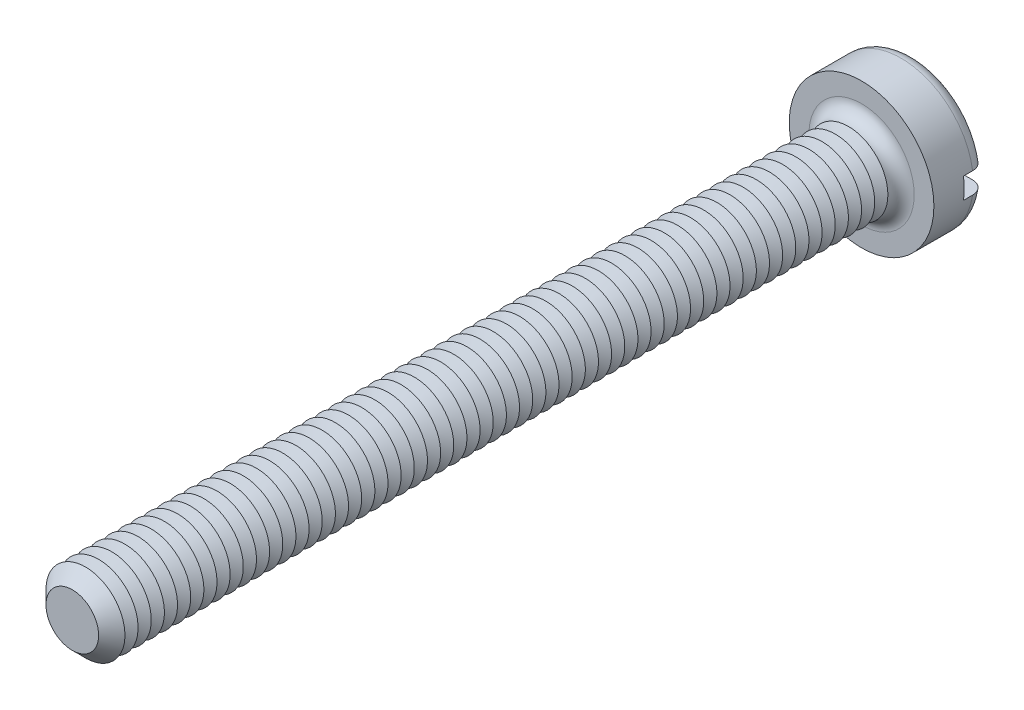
ISO-10303-21;
HEADER;
FILE_DESCRIPTION(('STEP AP214'),'2;1');
FILE_NAME('part.step','',(''),(''),'','','');
FILE_SCHEMA(('AUTOMOTIVE_DESIGN { 1 0 10303 214 1 1 1 1 }'));
ENDSEC;
DATA;
#1=APPLICATION_CONTEXT('core data for automotive mechanical design processes');
#2=APPLICATION_PROTOCOL_DEFINITION('international standard','automotive_design',2000,#1);
#3=PRODUCT_CONTEXT('',#1,'mechanical');
#4=PRODUCT('Part','Part','',(#3));
#5=PRODUCT_RELATED_PRODUCT_CATEGORY('part','',(#4));
#6=PRODUCT_DEFINITION_FORMATION('','',#4);
#7=PRODUCT_DEFINITION_CONTEXT('part definition',#1,'design');
#8=PRODUCT_DEFINITION('design','',#6,#7);
#9=PRODUCT_DEFINITION_SHAPE('','',#8);
#10=(LENGTH_UNIT() NAMED_UNIT(*) SI_UNIT(.MILLI.,.METRE.));
#11=(NAMED_UNIT(*) PLANE_ANGLE_UNIT() SI_UNIT($,.RADIAN.));
#12=(NAMED_UNIT(*) SI_UNIT($,.STERADIAN.) SOLID_ANGLE_UNIT());
#13=UNCERTAINTY_MEASURE_WITH_UNIT(LENGTH_MEASURE(1.E-05),#10,'distance_accuracy_value','');
#14=(GEOMETRIC_REPRESENTATION_CONTEXT(3) GLOBAL_UNCERTAINTY_ASSIGNED_CONTEXT((#13)) GLOBAL_UNIT_ASSIGNED_CONTEXT((#10,
#11,#12)) REPRESENTATION_CONTEXT('',''));
#15=CARTESIAN_POINT('',(0.,0.,0.));
#16=DIRECTION('',(0.,0.,1.));
#17=DIRECTION('',(1.,0.,0.));
#18=AXIS2_PLACEMENT_3D('',#15,#16,#17);
#19=CARTESIAN_POINT('',(0.,0.,-2.));
#20=DIRECTION('',(0.,0.,1.));
#21=DIRECTION('',(1.,0.,0.));
#22=AXIS2_PLACEMENT_3D('',#19,#20,#21);
#23=PLANE('',#22);
#24=CARTESIAN_POINT('',(0.,0.,-2.));
#25=DIRECTION('',(0.,0.,1.));
#26=DIRECTION('',(1.,0.,0.));
#27=AXIS2_PLACEMENT_3D('',#24,#25,#26);
#28=CIRCLE('',#27,2.25);
#29=CARTESIAN_POINT('',(-2.21415898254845,0.4,-2.));
#30=VERTEX_POINT('',#29);
#31=CARTESIAN_POINT('',(2.21415898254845,0.4,-2.));
#32=VERTEX_POINT('',#31);
#33=EDGE_CURVE('E116',#30,#32,#28,.F.);
#34=ORIENTED_EDGE('',*,*,#33,.T.);
#35=DIRECTION('',(1.,0.,0.));
#36=VECTOR('',#35,1.);
#37=CARTESIAN_POINT('',(-2.75,0.400000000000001,-2.));
#38=LINE('',#37,#36);
#39=EDGE_CURVE('E111',#30,#32,#38,.T.);
#40=ORIENTED_EDGE('',*,*,#39,.F.);
#41=EDGE_LOOP('',(#34,#40));
#42=FACE_BOUND('',#41,.T.);
#43=ADVANCED_FACE('F39',(#42),#23,.F.);
#44=CARTESIAN_POINT('',(0.,0.,-1.5));
#45=DIRECTION('',(0.,0.,1.));
#46=DIRECTION('',(1.,0.,0.));
#47=AXIS2_PLACEMENT_3D('',#44,#45,#46);
#48=TOROIDAL_SURFACE('',#47,2.25,0.5);
#49=CARTESIAN_POINT('',(-2.6296588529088,0.400000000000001,-1.78631483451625));
#50=CARTESIAN_POINT('',(-2.61332846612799,0.400000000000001,-1.80942627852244));
#51=CARTESIAN_POINT('',(-2.59501593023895,0.400000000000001,-1.83116426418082));
#52=CARTESIAN_POINT('',(-2.55497423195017,0.400000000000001,-1.87126271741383));
#53=CARTESIAN_POINT('',(-2.53324055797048,0.4,-1.88961865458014));
#54=CARTESIAN_POINT('',(-2.48702796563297,0.4,-1.92241505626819));
#55=CARTESIAN_POINT('',(-2.46255183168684,0.4,-1.93685944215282));
#56=CARTESIAN_POINT('',(-2.41154731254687,0.4,-1.96147315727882));
#57=CARTESIAN_POINT('',(-2.38501943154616,0.4,-1.97164353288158));
#58=CARTESIAN_POINT('',(-2.3303912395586,0.4,-1.98753780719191));
#59=CARTESIAN_POINT('',(-2.30227842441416,0.4,-1.99321871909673));
#60=CARTESIAN_POINT('',(-2.24549884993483,0.4,-1.99984170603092));
#61=CARTESIAN_POINT('',(-2.21683202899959,0.4,-2.00078325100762));
#62=CARTESIAN_POINT('',(-2.15939326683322,0.4,-1.99790249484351));
#63=CARTESIAN_POINT('',(-2.13062419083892,0.4,-1.99402290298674));
#64=CARTESIAN_POINT('',(-2.07413526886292,0.4,-1.98151915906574));
#65=CARTESIAN_POINT('',(-2.04641547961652,0.4,-1.97289475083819));
#66=CARTESIAN_POINT('',(-1.99264697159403,0.4,-1.95107177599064));
#67=CARTESIAN_POINT('',(-1.96660904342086,0.4,-1.93784659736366));
#68=CARTESIAN_POINT('',(-1.91713954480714,0.4,-1.90718730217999));
#69=CARTESIAN_POINT('',(-1.89370795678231,0.4,-1.88975321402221));
#70=CARTESIAN_POINT('',(-1.85029144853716,0.4,-1.85126548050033));
#71=CARTESIAN_POINT('',(-1.83028607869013,0.4,-1.83023492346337));
#72=CARTESIAN_POINT('',(-1.79417432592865,0.4,-1.78505552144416));
#73=CARTESIAN_POINT('',(-1.77806752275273,0.4,-1.76090701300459));
#74=CARTESIAN_POINT('',(-1.75056079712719,0.4,-1.71067721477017));
#75=CARTESIAN_POINT('',(-1.7390748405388,0.4,-1.68464306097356));
#76=CARTESIAN_POINT('',(-1.72075680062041,0.4,-1.63098625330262));
#77=CARTESIAN_POINT('',(-1.71392397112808,0.4,-1.60336385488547));
#78=CARTESIAN_POINT('',(-1.70525661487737,0.4,-1.54801066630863));
#79=CARTESIAN_POINT('',(-1.70330866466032,0.4,-1.52029759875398));
#80=CARTESIAN_POINT('',(-1.70414820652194,0.4,-1.46494458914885));
#81=CARTESIAN_POINT('',(-1.70693532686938,0.4,-1.43730464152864));
#82=CARTESIAN_POINT('',(-1.71709335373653,0.4,-1.38318389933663));
#83=CARTESIAN_POINT('',(-1.72441580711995,0.4,-1.35669397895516));
#84=CARTESIAN_POINT('',(-1.74335830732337,0.4,-1.30529964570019));
#85=CARTESIAN_POINT('',(-1.75497853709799,0.4,-1.2803953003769));
#86=CARTESIAN_POINT('',(-1.78229453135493,0.4,-1.23258298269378));
#87=CARTESIAN_POINT('',(-1.79803217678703,0.4,-1.20969896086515));
#88=CARTESIAN_POINT('',(-1.83304498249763,0.4,-1.16682064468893));
#89=CARTESIAN_POINT('',(-1.85232054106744,0.4,-1.1468266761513));
#90=CARTESIAN_POINT('',(-1.89433695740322,0.4,-1.10980713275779));
#91=CARTESIAN_POINT('',(-1.91714740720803,0.4,-1.09286053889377));
#92=CARTESIAN_POINT('',(-1.96524407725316,0.4,-1.06294809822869));
#93=CARTESIAN_POINT('',(-1.99053056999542,0.4,-1.04998269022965));
#94=CARTESIAN_POINT('',(-2.04340612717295,0.4,-1.02814800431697));
#95=CARTESIAN_POINT('',(-2.07103098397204,0.4,-1.01936532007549));
#96=CARTESIAN_POINT('',(-2.12735840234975,0.4,-1.00652373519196));
#97=CARTESIAN_POINT('',(-2.15606102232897,0.4,-1.00246509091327));
#98=CARTESIAN_POINT('',(-2.21395379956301,0.4,-0.999181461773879));
#99=CARTESIAN_POINT('',(-2.24314598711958,0.4,-0.999992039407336));
#100=CARTESIAN_POINT('',(-2.30097585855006,0.4,-1.00652779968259));
#101=CARTESIAN_POINT('',(-2.32961355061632,0.4,-1.01225290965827));
#102=CARTESIAN_POINT('',(-2.38536238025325,0.4,-1.02843951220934));
#103=CARTESIAN_POINT('',(-2.41248047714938,0.4,-1.03887701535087));
#104=CARTESIAN_POINT('',(-2.46454860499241,0.4,-1.06421009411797));
#105=CARTESIAN_POINT('',(-2.48949875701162,0.4,-1.0791054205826));
#106=CARTESIAN_POINT('',(-2.53620471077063,0.4,-1.11274531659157));
#107=CARTESIAN_POINT('',(-2.55799482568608,0.400000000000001,-1.1314422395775));
#108=CARTESIAN_POINT('',(-2.59807595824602,0.400000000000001,-1.17227176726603));
#109=CARTESIAN_POINT('',(-2.6163672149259,0.400000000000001,-1.19440413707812));
#110=CARTESIAN_POINT('',(-2.64868581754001,0.400000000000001,-1.24117072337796));
#111=CARTESIAN_POINT('',(-2.66276466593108,0.400000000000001,-1.26576935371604));
#112=CARTESIAN_POINT('',(-2.68654482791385,0.400000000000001,-1.31699754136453));
#113=CARTESIAN_POINT('',(-2.69624657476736,0.400000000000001,-1.34362689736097));
#114=CARTESIAN_POINT('',(-2.71090527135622,0.400000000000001,-1.39787706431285));
#115=CARTESIAN_POINT('',(-2.71590826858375,0.400000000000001,-1.4254854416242));
#116=CARTESIAN_POINT('',(-2.72118463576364,0.400000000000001,-1.48115803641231));
#117=CARTESIAN_POINT('',(-2.72145696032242,0.400000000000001,-1.50922235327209));
#118=CARTESIAN_POINT('',(-2.71727180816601,0.400000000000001,-1.56487271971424));
#119=CARTESIAN_POINT('',(-2.71283440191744,0.400000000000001,-1.59246029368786));
#120=CARTESIAN_POINT('',(-2.69939521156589,0.400000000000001,-1.64647499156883));
#121=CARTESIAN_POINT('',(-2.69039909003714,0.400000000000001,-1.67290351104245));
#122=CARTESIAN_POINT('',(-2.67251693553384,0.400000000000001,-1.71382731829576));
#123=CARTESIAN_POINT('',(-2.66497994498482,0.400000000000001,-1.72892686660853));
#124=CARTESIAN_POINT('',(-2.64841616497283,0.400000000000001,-1.75828509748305));
#125=CARTESIAN_POINT('',(-2.63938938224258,0.400000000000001,-1.77254378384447));
#126=CARTESIAN_POINT('',(-2.6296588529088,0.400000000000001,-1.78631483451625));
#127=B_SPLINE_CURVE_WITH_KNOTS('',3,(#49,#50,#51,#52,#53,#54,#55,#56,#57,#58,#59,#60,#61,#62,
#63,#64,#65,#66,#67,#68,#69,#70,#71,#72,#73,#74,#75,#76,#77,#78,#79,#80,#81,#82,#83,#84,#85,#86,
#87,#88,#89,#90,#91,#92,#93,#94,#95,#96,#97,#98,#99,#100,#101,#102,#103,#104,#105,#106,#107,
#108,#109,#110,#111,#112,#113,#114,#115,#116,#117,#118,#119,#120,#121,#122,#123,#124,#125,#126),
.UNSPECIFIED.,.T.,.F.,(4,2,2,2,2,2,2,2,2,2,2,2,2,2,2,2,2,2,2,2,2,2,2,2,2,2,2,2,2,2,2,2,2,2,2,2,
2,2,4),(0.,0.0848338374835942,0.16978050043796,0.254641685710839,0.339482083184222,
0.42512530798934,0.510778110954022,0.597458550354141,0.684143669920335,0.771338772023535,
0.858533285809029,0.945187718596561,1.03183280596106,1.11678035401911,1.20171427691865,
1.28465703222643,1.36759327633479,1.4496584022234,1.53172702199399,1.61466526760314,
1.69761285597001,1.78247103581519,1.86733856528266,1.95389396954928,2.0404540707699,
2.12764713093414,2.21483890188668,2.30159172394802,2.38833969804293,2.4740609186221,
2.55977628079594,2.6443962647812,2.72900787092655,2.81278135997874,2.89657336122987,
2.98000971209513,3.06334267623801,3.113891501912,3.16444009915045),.UNSPECIFIED.);
#128=CARTESIAN_POINT('',(-2.72075357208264,0.400000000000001,-1.50000000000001));
#129=VERTEX_POINT('',#128);
#130=EDGE_CURVE('E643',#129,#30,#127,.T.);
#131=ORIENTED_EDGE('',*,*,#130,.F.);
#132=CARTESIAN_POINT('',(0.,0.,-1.5));
#133=DIRECTION('',(0.,0.,1.));
#134=DIRECTION('',(1.,0.,0.));
#135=AXIS2_PLACEMENT_3D('',#132,#133,#134);
#136=CIRCLE('',#135,2.75);
#137=CARTESIAN_POINT('',(2.7207535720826,0.4,-1.5));
#138=VERTEX_POINT('',#137);
#139=EDGE_CURVE('E125',#138,#129,#136,.T.);
#140=ORIENTED_EDGE('',*,*,#139,.F.);
#141=CARTESIAN_POINT('',(1.7362507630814,0.4,-1.6752840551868));
#142=CARTESIAN_POINT('',(1.74636083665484,0.4,-1.70159961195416));
#143=CARTESIAN_POINT('',(1.7587429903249,0.4,-1.72706707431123));
#144=CARTESIAN_POINT('',(1.78764414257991,0.4,-1.77556609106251));
#145=CARTESIAN_POINT('',(1.80416918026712,0.4,-1.79859401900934));
#146=CARTESIAN_POINT('',(1.84080454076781,0.4,-1.84153587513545));
#147=CARTESIAN_POINT('',(1.86090949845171,0.4,-1.86145438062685));
#148=CARTESIAN_POINT('',(1.9041208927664,0.4,-1.89769607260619));
#149=CARTESIAN_POINT('',(1.92722659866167,0.4,-1.91402013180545));
#150=CARTESIAN_POINT('',(1.97620958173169,0.4,-1.94291288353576));
#151=CARTESIAN_POINT('',(2.00212726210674,0.4,-1.95541309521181));
#152=CARTESIAN_POINT('',(2.05567603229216,0.4,-1.97595143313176));
#153=CARTESIAN_POINT('',(2.08330733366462,0.4,-1.98398900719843));
#154=CARTESIAN_POINT('',(2.13989163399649,0.4,-1.99545904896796));
#155=CARTESIAN_POINT('',(2.16885726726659,0.4,-1.99882930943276));
#156=CARTESIAN_POINT('',(2.22694412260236,0.4,-2.00065872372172));
#157=CARTESIAN_POINT('',(2.25606534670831,0.4,-1.99911781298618));
#158=CARTESIAN_POINT('',(2.31362436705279,0.4,-1.99114818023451));
#159=CARTESIAN_POINT('',(2.34206235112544,0.4,-1.98472081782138));
#160=CARTESIAN_POINT('',(2.39743709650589,0.4,-1.96713601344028));
#161=CARTESIAN_POINT('',(2.42437392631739,0.4,-1.95597878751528));
#162=CARTESIAN_POINT('',(2.47569769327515,0.4,-1.92935960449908));
#163=CARTESIAN_POINT('',(2.50010686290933,0.4,-1.91394052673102));
#164=CARTESIAN_POINT('',(2.54594525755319,0.4,-1.8791725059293));
#165=CARTESIAN_POINT('',(2.56737468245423,0.4,-1.85982382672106));
#166=CARTESIAN_POINT('',(2.60634898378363,0.4,-1.81801641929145));
#167=CARTESIAN_POINT('',(2.6239407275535,0.4,-1.79560138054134));
#168=CARTESIAN_POINT('',(2.65505953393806,0.4,-1.7481077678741));
#169=CARTESIAN_POINT('',(2.66858686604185,0.4,-1.72302937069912));
#170=CARTESIAN_POINT('',(2.69103536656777,0.4,-1.67123055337));
#171=CARTESIAN_POINT('',(2.70000740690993,0.4,-1.64453217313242));
#172=CARTESIAN_POINT('',(2.71330608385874,0.4,-1.59000262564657));
#173=CARTESIAN_POINT('',(2.71763293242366,0.4,-1.5621715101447));
#174=CARTESIAN_POINT('',(2.72149675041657,0.4,-1.50637655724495));
#175=CARTESIAN_POINT('',(2.72106725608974,0.4,-1.47841503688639));
#176=CARTESIAN_POINT('',(2.7155123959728,0.4,-1.42296287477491));
#177=CARTESIAN_POINT('',(2.71038711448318,0.4,-1.39547222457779));
#178=CARTESIAN_POINT('',(2.69560462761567,0.4,-1.34178071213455));
#179=CARTESIAN_POINT('',(2.68595389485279,0.4,-1.31557806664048));
#180=CARTESIAN_POINT('',(2.66240876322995,0.4,-1.26515516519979));
#181=CARTESIAN_POINT('',(2.64851431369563,0.4,-1.24093493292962));
#182=CARTESIAN_POINT('',(2.61681930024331,0.4,-1.19504594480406));
#183=CARTESIAN_POINT('',(2.59900198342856,0.4,-1.17338876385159));
#184=CARTESIAN_POINT('',(2.56001495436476,0.4,-1.13333899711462));
#185=CARTESIAN_POINT('',(2.53884510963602,0.4,-1.11494654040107));
#186=CARTESIAN_POINT('',(2.49354554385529,0.4,-1.08175888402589));
#187=CARTESIAN_POINT('',(2.46938991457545,0.4,-1.06699905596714));
#188=CARTESIAN_POINT('',(2.41896725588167,0.4,-1.04168682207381));
#189=CARTESIAN_POINT('',(2.39270009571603,0.4,-1.03113467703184));
#190=CARTESIAN_POINT('',(2.33844927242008,0.4,-1.01439607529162));
#191=CARTESIAN_POINT('',(2.31044823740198,0.4,-1.00826592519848));
#192=CARTESIAN_POINT('',(2.25381752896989,0.4,-1.00073183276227));
#193=CARTESIAN_POINT('',(2.22518781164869,0.4,-0.999328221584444));
#194=CARTESIAN_POINT('',(2.16774231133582,0.4,-1.00127811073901));
#195=CARTESIAN_POINT('',(2.13892848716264,0.4,-1.00468955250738));
#196=CARTESIAN_POINT('',(2.08227193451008,0.4,-1.01626887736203));
#197=CARTESIAN_POINT('',(2.05442926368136,0.4,-1.02443704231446));
#198=CARTESIAN_POINT('',(2.00032604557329,0.4,-1.04537295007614));
#199=CARTESIAN_POINT('',(1.97407661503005,0.4,-1.05816944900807));
#200=CARTESIAN_POINT('',(1.92411255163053,0.4,-1.08801035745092));
#201=CARTESIAN_POINT('',(1.90039792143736,0.4,-1.10505477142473));
#202=CARTESIAN_POINT('',(1.85633574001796,0.4,-1.14282887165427));
#203=CARTESIAN_POINT('',(1.83597040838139,0.4,-1.16353779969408));
#204=CARTESIAN_POINT('',(1.79908731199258,0.4,-1.20813793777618));
#205=CARTESIAN_POINT('',(1.78256899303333,0.4,-1.23202868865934));
#206=CARTESIAN_POINT('',(1.75420022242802,0.4,-1.28183173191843));
#207=CARTESIAN_POINT('',(1.74226635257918,0.4,-1.30769648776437));
#208=CARTESIAN_POINT('',(1.72302798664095,0.4,-1.36110211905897));
#209=CARTESIAN_POINT('',(1.71572395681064,0.4,-1.38864316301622));
#210=CARTESIAN_POINT('',(1.70611974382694,0.4,-1.44392326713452));
#211=CARTESIAN_POINT('',(1.70370764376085,0.4,-1.47164298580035));
#212=CARTESIAN_POINT('',(1.70363822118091,0.4,-1.52706336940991));
#213=CARTESIAN_POINT('',(1.70597448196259,0.4,-1.55476400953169));
#214=CARTESIAN_POINT('',(1.71335146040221,0.4,-1.59796127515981));
#215=CARTESIAN_POINT('',(1.71686033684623,0.4,-1.61373520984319));
#216=CARTESIAN_POINT('',(1.7254146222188,0.4,-1.64486018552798));
#217=CARTESIAN_POINT('',(1.73045999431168,0.4,-1.66021123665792));
#218=CARTESIAN_POINT('',(1.7362507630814,0.4,-1.6752840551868));
#219=B_SPLINE_CURVE_WITH_KNOTS('',3,(#141,#142,#143,#144,#145,#146,#147,#148,#149,#150,#151,
#152,#153,#154,#155,#156,#157,#158,#159,#160,#161,#162,#163,#164,#165,#166,#167,#168,#169,#170,
#171,#172,#173,#174,#175,#176,#177,#178,#179,#180,#181,#182,#183,#184,#185,#186,#187,#188,#189,
#190,#191,#192,#193,#194,#195,#196,#197,#198,#199,#200,#201,#202,#203,#204,#205,#206,#207,#208,
#209,#210,#211,#212,#213,#214,#215,#216,#217,#218),.UNSPECIFIED.,.T.,.F.,(4,2,2,2,2,2,2,2,2,2,2,
2,2,2,2,2,2,2,2,2,2,2,2,2,2,2,2,2,2,2,2,2,2,2,2,2,2,2,4),(0.,0.0845117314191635,
0.169147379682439,0.253657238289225,0.338146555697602,0.424070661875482,0.510005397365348,
0.597074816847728,0.684145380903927,0.771191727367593,0.858234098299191,0.94443074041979,
1.03062159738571,1.11569223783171,1.20075723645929,1.28485012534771,1.36893917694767,
1.45243570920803,1.53593074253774,1.61930671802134,1.70268368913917,1.7864238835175,
1.87016738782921,1.95469664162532,2.03923113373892,2.12482389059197,2.21042264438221,
2.29706026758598,2.38370302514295,2.47089361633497,2.55808429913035,2.64479602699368,
2.73149525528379,2.81653234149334,2.9015779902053,2.98465497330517,3.06761976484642,
3.11602689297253,3.164432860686),.UNSPECIFIED.);
#220=EDGE_CURVE('E645',#32,#138,#219,.T.);
#221=ORIENTED_EDGE('',*,*,#220,.F.);
#222=ORIENTED_EDGE('',*,*,#33,.F.);
#223=EDGE_LOOP('',(#131,#140,#221,#222));
#224=FACE_BOUND('',#223,.T.);
#225=ADVANCED_FACE('F627',(#224),#48,.T.);
#226=CARTESIAN_POINT('',(0.,0.,-2.));
#227=DIRECTION('',(0.,0.,1.));
#228=DIRECTION('',(1.,0.,0.));
#229=AXIS2_PLACEMENT_3D('',#226,#227,#228);
#230=CYLINDRICAL_SURFACE('',#229,2.75);
#231=DIRECTION('',(0.,0.,1.));
#232=VECTOR('',#231,1.);
#233=CARTESIAN_POINT('',(2.72075357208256,0.4,-2.));
#234=LINE('',#233,#232);
#235=CARTESIAN_POINT('',(2.72075357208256,0.4,-1.15));
#236=VERTEX_POINT('',#235);
#237=EDGE_CURVE('E661',#138,#236,#234,.T.);
#238=ORIENTED_EDGE('',*,*,#237,.F.);
#239=ORIENTED_EDGE('',*,*,#139,.T.);
#240=DIRECTION('',(0.,0.,1.));
#241=VECTOR('',#240,1.);
#242=CARTESIAN_POINT('',(-2.72075357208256,0.4,-2.));
#243=LINE('',#242,#241);
#244=CARTESIAN_POINT('',(-2.72075357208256,0.4,-1.15));
#245=VERTEX_POINT('',#244);
#246=EDGE_CURVE('E63',#245,#129,#243,.F.);
#247=ORIENTED_EDGE('',*,*,#246,.F.);
#248=CARTESIAN_POINT('',(0.,0.,-1.15));
#249=DIRECTION('',(0.,0.,-1.));
#250=DIRECTION('',(-1.,0.,0.));
#251=AXIS2_PLACEMENT_3D('',#248,#249,#250);
#252=CIRCLE('',#251,2.75);
#253=CARTESIAN_POINT('',(-2.72075357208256,-0.4,-1.15));
#254=VERTEX_POINT('',#253);
#255=EDGE_CURVE('E43',#245,#254,#252,.F.);
#256=ORIENTED_EDGE('',*,*,#255,.T.);
#257=DIRECTION('',(0.,0.,1.));
#258=VECTOR('',#257,1.);
#259=CARTESIAN_POINT('',(-2.72075357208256,-0.4,-2.));
#260=LINE('',#259,#258);
#261=CARTESIAN_POINT('',(-2.72075357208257,-0.4,-1.5));
#262=VERTEX_POINT('',#261);
#263=EDGE_CURVE('E658',#262,#254,#260,.T.);
#264=ORIENTED_EDGE('',*,*,#263,.F.);
#265=CARTESIAN_POINT('',(2.72075357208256,-0.4,-1.5));
#266=VERTEX_POINT('',#265);
#267=EDGE_CURVE('E127',#262,#266,#136,.T.);
#268=ORIENTED_EDGE('',*,*,#267,.T.);
#269=DIRECTION('',(0.,0.,1.));
#270=VECTOR('',#269,1.);
#271=CARTESIAN_POINT('',(2.72075357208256,-0.4,-2.));
#272=LINE('',#271,#270);
#273=CARTESIAN_POINT('',(2.72075357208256,-0.4,-1.15));
#274=VERTEX_POINT('',#273);
#275=EDGE_CURVE('E55',#274,#266,#272,.F.);
#276=ORIENTED_EDGE('',*,*,#275,.F.);
#277=EDGE_CURVE('E11',#274,#236,#252,.F.);
#278=ORIENTED_EDGE('',*,*,#277,.T.);
#279=EDGE_LOOP('',(#238,#239,#247,#256,#264,#268,#276,#278));
#280=FACE_BOUND('',#279,.T.);
#281=CARTESIAN_POINT('',(0.,0.,0.));
#282=DIRECTION('',(0.,0.,1.));
#283=DIRECTION('',(1.,0.,0.));
#284=AXIS2_PLACEMENT_3D('',#281,#282,#283);
#285=CIRCLE('',#284,2.75);
#286=CARTESIAN_POINT('',(2.75,0.,0.));
#287=VERTEX_POINT('',#286);
#288=EDGE_CURVE('E664',#287,#287,#285,.T.);
#289=ORIENTED_EDGE('',*,*,#288,.F.);
#290=EDGE_LOOP('',(#289));
#291=FACE_BOUND('',#290,.T.);
#292=ADVANCED_FACE('F623',(#280,#291),#230,.T.);
#293=CARTESIAN_POINT('',(2.21415898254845,-0.4,-2.));
#294=VERTEX_POINT('',#293);
#295=CARTESIAN_POINT('',(-2.21415898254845,-0.4,-2.));
#296=VERTEX_POINT('',#295);
#297=EDGE_CURVE('E109',#294,#296,#28,.F.);
#298=ORIENTED_EDGE('',*,*,#297,.T.);
#299=DIRECTION('',(-1.,0.,0.));
#300=VECTOR('',#299,1.);
#301=CARTESIAN_POINT('',(-2.75,-0.4,-2.));
#302=LINE('',#301,#300);
#303=EDGE_CURVE('E96',#294,#296,#302,.T.);
#304=ORIENTED_EDGE('',*,*,#303,.F.);
#305=EDGE_LOOP('',(#298,#304));
#306=FACE_BOUND('',#305,.T.);
#307=ADVANCED_FACE('F108',(#306),#23,.F.);
#308=CARTESIAN_POINT('',(0.,0.,0.));
#309=DIRECTION('',(0.,0.,1.));
#310=DIRECTION('',(1.,0.,0.));
#311=AXIS2_PLACEMENT_3D('',#308,#309,#310);
#312=PLANE('',#311);
#313=CARTESIAN_POINT('',(0.,0.,0.));
#314=DIRECTION('',(0.,0.,1.));
#315=DIRECTION('',(1.,0.,0.));
#316=AXIS2_PLACEMENT_3D('',#313,#314,#315);
#317=CIRCLE('',#316,2.);
#318=CARTESIAN_POINT('',(2.,0.,0.));
#319=VERTEX_POINT('',#318);
#320=EDGE_CURVE('E115',#319,#319,#317,.F.);
#321=ORIENTED_EDGE('',*,*,#320,.T.);
#322=EDGE_LOOP('',(#321));
#323=FACE_BOUND('',#322,.T.);
#324=ORIENTED_EDGE('',*,*,#288,.T.);
#325=EDGE_LOOP('',(#324));
#326=FACE_BOUND('',#325,.T.);
#327=ADVANCED_FACE('F622',(#323,#326),#312,.T.);
#328=CARTESIAN_POINT('',(-2.6296588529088,-0.4,-1.78631483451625));
#329=CARTESIAN_POINT('',(-2.64575286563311,-0.4,-1.76353353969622));
#330=CARTESIAN_POINT('',(-2.65994473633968,-0.4,-1.73938506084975));
#331=CARTESIAN_POINT('',(-2.68408879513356,-0.4,-1.68903091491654));
#332=CARTESIAN_POINT('',(-2.69403633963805,-0.4,-1.6628230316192));
#333=CARTESIAN_POINT('',(-2.70937899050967,-0.4,-1.60911025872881));
#334=CARTESIAN_POINT('',(-2.71477511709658,-0.4,-1.5816056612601));
#335=CARTESIAN_POINT('',(-2.72085365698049,-0.4,-1.52608718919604));
#336=CARTESIAN_POINT('',(-2.7215371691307,-0.4,-1.49807343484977));
#337=CARTESIAN_POINT('',(-2.71817903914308,-0.4,-1.44242333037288));
#338=CARTESIAN_POINT('',(-2.71415291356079,-0.4,-1.41478604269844));
#339=CARTESIAN_POINT('',(-2.70152104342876,-0.4,-1.36057835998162));
#340=CARTESIAN_POINT('',(-2.69291517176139,-0.4,-1.33400799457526));
#341=CARTESIAN_POINT('',(-2.67137052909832,-0.4,-1.28266198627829));
#342=CARTESIAN_POINT('',(-2.65842829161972,-0.4,-1.25788779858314));
#343=CARTESIAN_POINT('',(-2.62859348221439,-0.4,-1.21084577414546));
#344=CARTESIAN_POINT('',(-2.61170082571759,-0.4,-1.18857799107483));
#345=CARTESIAN_POINT('',(-2.5743351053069,-0.4,-1.1470221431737));
#346=CARTESIAN_POINT('',(-2.55383974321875,-0.4,-1.12775413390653));
#347=CARTESIAN_POINT('',(-2.5099353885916,-0.4,-1.09288845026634));
#348=CARTESIAN_POINT('',(-2.48652625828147,-0.4,-1.07729094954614));
#349=CARTESIAN_POINT('',(-2.43718903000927,-0.4,-1.0500239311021));
#350=CARTESIAN_POINT('',(-2.41123629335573,-0.4,-1.0383990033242));
#351=CARTESIAN_POINT('',(-2.35776417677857,-0.4,-1.01960886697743));
#352=CARTESIAN_POINT('',(-2.33024469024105,-0.4,-1.01244396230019));
#353=CARTESIAN_POINT('',(-2.27404134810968,-0.4,-1.00268156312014));
#354=CARTESIAN_POINT('',(-2.24534705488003,-0.4,-1.00014414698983));
#355=CARTESIAN_POINT('',(-2.18793513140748,-0.4,-0.999867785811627));
#356=CARTESIAN_POINT('',(-2.15921749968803,-0.4,-1.00212917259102));
#357=CARTESIAN_POINT('',(-2.10225052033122,-0.4,-1.01142552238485));
#358=CARTESIAN_POINT('',(-2.07400941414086,-0.4,-1.01851105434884));
#359=CARTESIAN_POINT('',(-2.01911044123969,-0.4,-1.03730994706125));
#360=CARTESIAN_POINT('',(-1.99245264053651,-0.4,-1.04902350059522));
#361=CARTESIAN_POINT('',(-1.94142108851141,-0.4,-1.07679847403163));
#362=CARTESIAN_POINT('',(-1.91705303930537,-0.4,-1.09287038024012));
#363=CARTESIAN_POINT('',(-1.87139758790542,-0.4,-1.12891897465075));
#364=CARTESIAN_POINT('',(-1.85011007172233,-0.4,-1.14889551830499));
#365=CARTESIAN_POINT('',(-1.81149058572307,-0.4,-1.19196940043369));
#366=CARTESIAN_POINT('',(-1.79411779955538,-0.4,-1.21503011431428));
#367=CARTESIAN_POINT('',(-1.76359546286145,-0.4,-1.26379588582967));
#368=CARTESIAN_POINT('',(-1.75044532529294,-0.4,-1.28950057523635));
#369=CARTESIAN_POINT('',(-1.72906221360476,-0.4,-1.3422057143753));
#370=CARTESIAN_POINT('',(-1.72072512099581,-0.4,-1.3691639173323));
#371=CARTESIAN_POINT('',(-1.70880448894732,-0.4,-1.42411084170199));
#372=CARTESIAN_POINT('',(-1.7052202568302,-0.4,-1.45209941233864));
#373=CARTESIAN_POINT('',(-1.70295553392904,-0.4,-1.50768522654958));
#374=CARTESIAN_POINT('',(-1.70417398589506,-0.4,-1.53527840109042));
#375=CARTESIAN_POINT('',(-1.71124536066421,-0.4,-1.58986292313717));
#376=CARTESIAN_POINT('',(-1.71709811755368,-0.4,-1.61685429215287));
#377=CARTESIAN_POINT('',(-1.73321132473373,-0.4,-1.66938107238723));
#378=CARTESIAN_POINT('',(-1.74345625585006,-0.4,-1.69492125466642));
#379=CARTESIAN_POINT('',(-1.76802111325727,-0.4,-1.74395877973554));
#380=CARTESIAN_POINT('',(-1.78234133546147,-0.4,-1.76745597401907));
#381=CARTESIAN_POINT('',(-1.81488631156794,-0.4,-1.81216193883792));
#382=CARTESIAN_POINT('',(-1.83317116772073,-0.4,-1.83332693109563));
#383=CARTESIAN_POINT('',(-1.87296030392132,-0.4,-1.872375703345));
#384=CARTESIAN_POINT('',(-1.89446497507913,-0.4,-1.89025908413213));
#385=CARTESIAN_POINT('',(-1.94063077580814,-0.4,-1.92267732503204));
#386=CARTESIAN_POINT('',(-1.96535444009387,-0.4,-1.93712316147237));
#387=CARTESIAN_POINT('',(-2.01684705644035,-0.4,-1.96173690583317));
#388=CARTESIAN_POINT('',(-2.04361620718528,-0.4,-1.97190439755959));
#389=CARTESIAN_POINT('',(-2.09891021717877,-0.4,-1.9878230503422));
#390=CARTESIAN_POINT('',(-2.12745653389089,-0.4,-1.99349978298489));
#391=CARTESIAN_POINT('',(-2.18509639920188,-0.4,-1.99999556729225));
#392=CARTESIAN_POINT('',(-2.21418994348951,-0.4,-2.00081465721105));
#393=CARTESIAN_POINT('',(-2.27218032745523,-0.4,-1.99755156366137));
#394=CARTESIAN_POINT('',(-2.30107643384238,-0.4,-1.99345627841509));
#395=CARTESIAN_POINT('',(-2.35776697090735,-0.4,-1.98043125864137));
#396=CARTESIAN_POINT('',(-2.38556116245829,-0.4,-1.97150048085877));
#397=CARTESIAN_POINT('',(-2.43901832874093,-0.4,-1.94912081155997));
#398=CARTESIAN_POINT('',(-2.46469578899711,-0.4,-1.93570648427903));
#399=CARTESIAN_POINT('',(-2.51337022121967,-0.4,-1.90471183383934));
#400=CARTESIAN_POINT('',(-2.53637056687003,-0.4,-1.88713684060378));
#401=CARTESIAN_POINT('',(-2.57111030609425,-0.4,-1.85552084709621));
#402=CARTESIAN_POINT('',(-2.58386709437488,-0.4,-1.84257896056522));
#403=CARTESIAN_POINT('',(-2.60790410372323,-0.4,-1.81538935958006));
#404=CARTESIAN_POINT('',(-2.61918433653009,-0.4,-1.80114165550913));
#405=CARTESIAN_POINT('',(-2.6296588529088,-0.4,-1.78631483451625));
#406=B_SPLINE_CURVE_WITH_KNOTS('',3,(#328,#329,#330,#331,#332,#333,#334,#335,#336,#337,#338,
#339,#340,#341,#342,#343,#344,#345,#346,#347,#348,#349,#350,#351,#352,#353,#354,#355,#356,#357,
#358,#359,#360,#361,#362,#363,#364,#365,#366,#367,#368,#369,#370,#371,#372,#373,#374,#375,#376,
#377,#378,#379,#380,#381,#382,#383,#384,#385,#386,#387,#388,#389,#390,#391,#392,#393,#394,#395,
#396,#397,#398,#399,#400,#401,#402,#403,#404,#405),.UNSPECIFIED.,.T.,.F.,(4,2,2,2,2,2,2,2,2,2,2,
2,2,2,2,2,2,2,2,2,2,2,2,2,2,2,2,2,2,2,2,2,2,2,2,2,2,2,4),(0.,0.0836125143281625,
0.167316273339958,0.251001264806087,0.334666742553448,0.418057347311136,0.501450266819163,
0.584910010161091,0.668371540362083,0.752369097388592,0.836370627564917,0.921286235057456,
1.00620762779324,1.09222390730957,1.17824613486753,1.26518425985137,1.35212600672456,
1.43927882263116,1.52642841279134,1.61262232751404,1.69880425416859,1.7830443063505,
1.86727208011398,1.9497371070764,2.03219918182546,2.1143722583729,2.19655130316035,
2.28007615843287,2.36361116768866,2.44911836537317,2.53463387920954,2.62153862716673,
2.70844269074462,2.79557895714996,2.88273403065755,2.96923214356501,3.05562004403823,
3.11003826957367,3.16445606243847),.UNSPECIFIED.);
#407=EDGE_CURVE('E103',#296,#262,#406,.T.);
#408=ORIENTED_EDGE('',*,*,#407,.F.);
#409=ORIENTED_EDGE('',*,*,#297,.F.);
#410=CARTESIAN_POINT('',(1.7362507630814,-0.4,-1.6752840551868));
#411=CARTESIAN_POINT('',(1.72641416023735,-0.4,-1.64967314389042));
#412=CARTESIAN_POINT('',(1.71871480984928,-0.4,-1.62322216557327));
#413=CARTESIAN_POINT('',(1.70786038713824,-0.4,-1.56938399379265));
#414=CARTESIAN_POINT('',(1.70470970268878,-0.4,-1.54199592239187));
#415=CARTESIAN_POINT('',(1.70306971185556,-0.4,-1.48708393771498));
#416=CARTESIAN_POINT('',(1.70457942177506,-0.4,-1.45956005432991));
#417=CARTESIAN_POINT('',(1.71220670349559,-0.4,-1.40516538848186));
#418=CARTESIAN_POINT('',(1.71832341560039,-0.4,-1.3782944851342));
#419=CARTESIAN_POINT('',(1.73494792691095,-0.4,-1.32598312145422));
#420=CARTESIAN_POINT('',(1.74545076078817,-0.4,-1.30054108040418));
#421=CARTESIAN_POINT('',(1.77051013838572,-0.4,-1.25173932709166));
#422=CARTESIAN_POINT('',(1.7850670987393,-0.4,-1.22837982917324));
#423=CARTESIAN_POINT('',(1.81806903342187,-0.4,-1.1839775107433));
#424=CARTESIAN_POINT('',(1.8365752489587,-0.4,-1.16298023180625));
#425=CARTESIAN_POINT('',(1.87677669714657,-0.4,-1.1243010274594));
#426=CARTESIAN_POINT('',(1.89847230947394,-0.4,-1.10661949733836));
#427=CARTESIAN_POINT('',(1.94498854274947,-0.4,-1.07463966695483));
#428=CARTESIAN_POINT('',(1.96987078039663,-0.4,-1.06043095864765));
#429=CARTESIAN_POINT('',(2.02163980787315,-0.4,-1.0363161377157));
#430=CARTESIAN_POINT('',(2.04852678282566,-0.4,-1.02641042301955));
#431=CARTESIAN_POINT('',(2.10400319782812,-0.4,-1.01104128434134));
#432=CARTESIAN_POINT('',(2.13261287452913,-0.4,-1.00565079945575));
#433=CARTESIAN_POINT('',(2.19033179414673,-0.4,-0.999735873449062));
#434=CARTESIAN_POINT('',(2.2194410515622,-0.4,-0.999211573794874));
#435=CARTESIAN_POINT('',(2.27740442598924,-0.4,-1.00306591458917));
#436=CARTESIAN_POINT('',(2.30625777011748,-0.4,-1.00745623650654));
#437=CARTESIAN_POINT('',(2.36280530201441,-0.4,-1.02105937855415));
#438=CARTESIAN_POINT('',(2.39049952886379,-0.4,-1.03027203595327));
#439=CARTESIAN_POINT('',(2.44369359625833,-0.4,-1.05318710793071));
#440=CARTESIAN_POINT('',(2.46920965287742,-0.4,-1.0668518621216));
#441=CARTESIAN_POINT('',(2.51754507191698,-0.4,-1.09832423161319));
#442=CARTESIAN_POINT('',(2.54036461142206,-0.4,-1.11613157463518));
#443=CARTESIAN_POINT('',(2.58234752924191,-0.4,-1.15513986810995));
#444=CARTESIAN_POINT('',(2.601553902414,-0.4,-1.1762945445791));
#445=CARTESIAN_POINT('',(2.63609001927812,-0.4,-1.22156192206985));
#446=CARTESIAN_POINT('',(2.65142002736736,-0.4,-1.24567442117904));
#447=CARTESIAN_POINT('',(2.67757733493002,-0.4,-1.29585881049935));
#448=CARTESIAN_POINT('',(2.68845668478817,-0.4,-1.32190357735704));
#449=CARTESIAN_POINT('',(2.7056478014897,-0.4,-1.375459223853));
#450=CARTESIAN_POINT('',(2.71195980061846,-0.4,-1.40297002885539));
#451=CARTESIAN_POINT('',(2.71979288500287,-0.4,-1.45843707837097));
#452=CARTESIAN_POINT('',(2.72135241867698,-0.4,-1.48638789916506));
#453=CARTESIAN_POINT('',(2.71974298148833,-0.4,-1.54215266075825));
#454=CARTESIAN_POINT('',(2.71657412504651,-0.4,-1.56996660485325));
#455=CARTESIAN_POINT('',(2.70561779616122,-0.4,-1.62459191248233));
#456=CARTESIAN_POINT('',(2.69784258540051,-0.4,-1.65140573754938));
#457=CARTESIAN_POINT('',(2.6779146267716,-0.4,-1.70335337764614));
#458=CARTESIAN_POINT('',(2.66576185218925,-0.4,-1.72848718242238));
#459=CARTESIAN_POINT('',(2.63739107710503,-0.4,-1.77645196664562));
#460=CARTESIAN_POINT('',(2.62116029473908,-0.4,-1.79927538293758));
#461=CARTESIAN_POINT('',(2.58512700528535,-0.4,-1.84190182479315));
#462=CARTESIAN_POINT('',(2.56532438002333,-0.4,-1.86170475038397));
#463=CARTESIAN_POINT('',(2.522535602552,-0.4,-1.89791219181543));
#464=CARTESIAN_POINT('',(2.49952399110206,-0.4,-1.91428661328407));
#465=CARTESIAN_POINT('',(2.45110500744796,-0.4,-1.94299324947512));
#466=CARTESIAN_POINT('',(2.4256974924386,-0.4,-1.95532522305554));
#467=CARTESIAN_POINT('',(2.37288090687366,-0.4,-1.97575769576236));
#468=CARTESIAN_POINT('',(2.34545135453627,-0.4,-1.98380524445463));
#469=CARTESIAN_POINT('',(2.28963821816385,-0.4,-1.99524443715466));
#470=CARTESIAN_POINT('',(2.26125456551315,-0.4,-1.99863574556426));
#471=CARTESIAN_POINT('',(2.20395671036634,-0.4,-2.00070487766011));
#472=CARTESIAN_POINT('',(2.17504033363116,-0.4,-1.99932265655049));
#473=CARTESIAN_POINT('',(2.11784130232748,-0.4,-1.9917648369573));
#474=CARTESIAN_POINT('',(2.08955866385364,-0.4,-1.98558911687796));
#475=CARTESIAN_POINT('',(2.03419451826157,-0.4,-1.96854979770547));
#476=CARTESIAN_POINT('',(2.00712437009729,-0.4,-1.95764925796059));
#477=CARTESIAN_POINT('',(1.95519572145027,-0.4,-1.93144413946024));
#478=CARTESIAN_POINT('',(1.93033780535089,-0.4,-1.91613840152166));
#479=CARTESIAN_POINT('',(1.88362525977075,-0.4,-1.88157419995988));
#480=CARTESIAN_POINT('',(1.86176428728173,-0.4,-1.86232430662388));
#481=CARTESIAN_POINT('',(1.82167218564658,-0.4,-1.82038600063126));
#482=CARTESIAN_POINT('',(1.803436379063,-0.4,-1.7977020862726));
#483=CARTESIAN_POINT('',(1.77700088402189,-0.4,-1.7582526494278));
#484=CARTESIAN_POINT('',(1.7675549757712,-0.4,-1.74230781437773));
#485=CARTESIAN_POINT('',(1.75049861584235,-0.4,-1.70946415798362));
#486=CARTESIAN_POINT('',(1.7428881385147,-0.4,-1.69256534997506));
#487=CARTESIAN_POINT('',(1.7362507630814,-0.4,-1.6752840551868));
#488=B_SPLINE_CURVE_WITH_KNOTS('',3,(#410,#411,#412,#413,#414,#415,#416,#417,#418,#419,#420,
#421,#422,#423,#424,#425,#426,#427,#428,#429,#430,#431,#432,#433,#434,#435,#436,#437,#438,#439,
#440,#441,#442,#443,#444,#445,#446,#447,#448,#449,#450,#451,#452,#453,#454,#455,#456,#457,#458,
#459,#460,#461,#462,#463,#464,#465,#466,#467,#468,#469,#470,#471,#472,#473,#474,#475,#476,#477,
#478,#479,#480,#481,#482,#483,#484,#485,#486,#487),.UNSPECIFIED.,.T.,.F.,(4,2,2,2,2,2,2,2,2,2,2,
2,2,2,2,2,2,2,2,2,2,2,2,2,2,2,2,2,2,2,2,2,2,2,2,2,2,2,4),(0.,0.0822382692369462,
0.164555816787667,0.246855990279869,0.329140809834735,0.411332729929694,0.493533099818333,
0.577115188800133,0.660707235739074,0.746270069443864,0.831840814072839,0.918768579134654,
1.00569887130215,1.09283622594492,1.17997064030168,1.26638632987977,1.35279634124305,
1.43810213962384,1.52340211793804,1.60767384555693,1.69194128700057,1.77552515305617,
1.85910699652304,1.94246734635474,2.02582820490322,2.10945367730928,2.19308191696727,
2.2774160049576,2.36175512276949,2.4471137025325,2.53247843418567,2.61892083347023,
2.70536542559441,2.79249842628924,2.87965437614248,2.96662291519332,3.05347850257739,
3.10897061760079,3.16446195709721),.UNSPECIFIED.);
#489=EDGE_CURVE('E92',#266,#294,#488,.T.);
#490=ORIENTED_EDGE('',*,*,#489,.F.);
#491=ORIENTED_EDGE('',*,*,#267,.F.);
#492=EDGE_LOOP('',(#408,#409,#490,#491));
#493=FACE_BOUND('',#492,.T.);
#494=ADVANCED_FACE('F113',(#493),#48,.T.);
#495=CARTESIAN_POINT('',(0.,0.,0.5));
#496=DIRECTION('',(0.,0.,1.));
#497=DIRECTION('',(1.,0.,0.));
#498=AXIS2_PLACEMENT_3D('',#495,#496,#497);
#499=TOROIDAL_SURFACE('',#498,2.,0.5);
#500=ORIENTED_EDGE('',*,*,#320,.F.);
#501=EDGE_LOOP('',(#500));
#502=FACE_BOUND('',#501,.T.);
#503=CARTESIAN_POINT('',(0.,0.,0.5));
#504=DIRECTION('',(0.,0.,-1.));
#505=DIRECTION('',(-1.,0.,0.));
#506=AXIS2_PLACEMENT_3D('',#503,#504,#505);
#507=CIRCLE('',#506,1.5);
#508=CARTESIAN_POINT('',(-1.5,0.,0.5));
#509=VERTEX_POINT('',#508);
#510=EDGE_CURVE('E668',#509,#509,#507,.T.);
#511=ORIENTED_EDGE('',*,*,#510,.T.);
#512=EDGE_LOOP('',(#511));
#513=FACE_BOUND('',#512,.T.);
#514=ADVANCED_FACE('F615',(#502,#513),#499,.F.);
#515=CARTESIAN_POINT('',(0.,0.,0.750000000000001));
#516=DIRECTION('',(0.,0.,-1.));
#517=DIRECTION('',(-1.,0.,0.));
#518=AXIS2_PLACEMENT_3D('',#515,#516,#517);
#519=CONICAL_SURFACE('',#518,1.06698729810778,1.0471975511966);
#520=ORIENTED_EDGE('',*,*,#510,.F.);
#521=EDGE_LOOP('',(#520));
#522=FACE_BOUND('',#521,.T.);
#523=CARTESIAN_POINT('',(0.,0.,0.750000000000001));
#524=DIRECTION('',(0.,0.,-1.));
#525=DIRECTION('',(-1.,0.,0.));
#526=AXIS2_PLACEMENT_3D('',#523,#524,#525);
#527=CIRCLE('',#526,1.06698729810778);
#528=CARTESIAN_POINT('',(-1.06698729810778,0.,0.750000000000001));
#529=VERTEX_POINT('',#528);
#530=EDGE_CURVE('E675',#529,#529,#527,.T.);
#531=ORIENTED_EDGE('',*,*,#530,.T.);
#532=EDGE_LOOP('',(#531));
#533=FACE_BOUND('',#532,.T.);
#534=ADVANCED_FACE('F611',(#522,#533),#519,.T.);
#535=CARTESIAN_POINT('',(0.,0.,1.));
#536=DIRECTION('',(0.,0.,1.));
#537=DIRECTION('',(1.,0.,0.));
#538=AXIS2_PLACEMENT_3D('',#535,#536,#537);
#539=CONICAL_SURFACE('',#538,1.5,1.0471975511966);
#540=ORIENTED_EDGE('',*,*,#530,.F.);
#541=EDGE_LOOP('',(#540));
#542=FACE_BOUND('',#541,.T.);
#543=CARTESIAN_POINT('',(0.,0.,1.));
#544=DIRECTION('',(0.,0.,-1.));
#545=DIRECTION('',(-1.,0.,0.));
#546=AXIS2_PLACEMENT_3D('',#543,#544,#545);
#547=CIRCLE('',#546,1.5);
#548=CARTESIAN_POINT('',(-1.5,0.,1.));
#549=VERTEX_POINT('',#548);
#550=EDGE_CURVE('E681',#549,#549,#547,.T.);
#551=ORIENTED_EDGE('',*,*,#550,.T.);
#552=EDGE_LOOP('',(#551));
#553=FACE_BOUND('',#552,.T.);
#554=ADVANCED_FACE('F607',(#542,#553),#539,.T.);
#555=CARTESIAN_POINT('',(0.,0.,1.25));
#556=DIRECTION('',(0.,0.,-1.));
#557=DIRECTION('',(-1.,0.,0.));
#558=AXIS2_PLACEMENT_3D('',#555,#556,#557);
#559=CONICAL_SURFACE('',#558,1.06698729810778,1.0471975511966);
#560=ORIENTED_EDGE('',*,*,#550,.F.);
#561=EDGE_LOOP('',(#560));
#562=FACE_BOUND('',#561,.T.);
#563=CARTESIAN_POINT('',(0.,0.,1.25));
#564=DIRECTION('',(0.,0.,-1.));
#565=DIRECTION('',(-1.,0.,0.));
#566=AXIS2_PLACEMENT_3D('',#563,#564,#565);
#567=CIRCLE('',#566,1.06698729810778);
#568=CARTESIAN_POINT('',(-1.06698729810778,0.,1.25));
#569=VERTEX_POINT('',#568);
#570=EDGE_CURVE('E685',#569,#569,#567,.T.);
#571=ORIENTED_EDGE('',*,*,#570,.T.);
#572=EDGE_LOOP('',(#571));
#573=FACE_BOUND('',#572,.T.);
#574=ADVANCED_FACE('F603',(#562,#573),#559,.T.);
#575=CARTESIAN_POINT('',(0.,0.,1.5));
#576=DIRECTION('',(0.,0.,1.));
#577=DIRECTION('',(1.,0.,0.));
#578=AXIS2_PLACEMENT_3D('',#575,#576,#577);
#579=CONICAL_SURFACE('',#578,1.5,1.0471975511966);
#580=ORIENTED_EDGE('',*,*,#570,.F.);
#581=EDGE_LOOP('',(#580));
#582=FACE_BOUND('',#581,.T.);
#583=CARTESIAN_POINT('',(0.,0.,1.5));
#584=DIRECTION('',(0.,0.,-1.));
#585=DIRECTION('',(-1.,0.,0.));
#586=AXIS2_PLACEMENT_3D('',#583,#584,#585);
#587=CIRCLE('',#586,1.5);
#588=CARTESIAN_POINT('',(-1.5,0.,1.5));
#589=VERTEX_POINT('',#588);
#590=EDGE_CURVE('E689',#589,#589,#587,.T.);
#591=ORIENTED_EDGE('',*,*,#590,.T.);
#592=EDGE_LOOP('',(#591));
#593=FACE_BOUND('',#592,.T.);
#594=ADVANCED_FACE('F599',(#582,#593),#579,.T.);
#595=CARTESIAN_POINT('',(0.,0.,1.75));
#596=DIRECTION('',(0.,0.,-1.));
#597=DIRECTION('',(-1.,0.,0.));
#598=AXIS2_PLACEMENT_3D('',#595,#596,#597);
#599=CONICAL_SURFACE('',#598,1.06698729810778,1.0471975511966);
#600=ORIENTED_EDGE('',*,*,#590,.F.);
#601=EDGE_LOOP('',(#600));
#602=FACE_BOUND('',#601,.T.);
#603=CARTESIAN_POINT('',(0.,0.,1.75));
#604=DIRECTION('',(0.,0.,-1.));
#605=DIRECTION('',(-1.,0.,0.));
#606=AXIS2_PLACEMENT_3D('',#603,#604,#605);
#607=CIRCLE('',#606,1.06698729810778);
#608=CARTESIAN_POINT('',(-1.06698729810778,0.,1.75));
#609=VERTEX_POINT('',#608);
#610=EDGE_CURVE('E693',#609,#609,#607,.T.);
#611=ORIENTED_EDGE('',*,*,#610,.T.);
#612=EDGE_LOOP('',(#611));
#613=FACE_BOUND('',#612,.T.);
#614=ADVANCED_FACE('F595',(#602,#613),#599,.T.);
#615=CARTESIAN_POINT('',(0.,0.,2.));
#616=DIRECTION('',(0.,0.,1.));
#617=DIRECTION('',(1.,0.,0.));
#618=AXIS2_PLACEMENT_3D('',#615,#616,#617);
#619=CONICAL_SURFACE('',#618,1.5,1.0471975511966);
#620=ORIENTED_EDGE('',*,*,#610,.F.);
#621=EDGE_LOOP('',(#620));
#622=FACE_BOUND('',#621,.T.);
#623=CARTESIAN_POINT('',(0.,0.,2.));
#624=DIRECTION('',(0.,0.,-1.));
#625=DIRECTION('',(-1.,0.,0.));
#626=AXIS2_PLACEMENT_3D('',#623,#624,#625);
#627=CIRCLE('',#626,1.5);
#628=CARTESIAN_POINT('',(-1.5,0.,2.));
#629=VERTEX_POINT('',#628);
#630=EDGE_CURVE('E697',#629,#629,#627,.T.);
#631=ORIENTED_EDGE('',*,*,#630,.T.);
#632=EDGE_LOOP('',(#631));
#633=FACE_BOUND('',#632,.T.);
#634=ADVANCED_FACE('F591',(#622,#633),#619,.T.);
#635=CARTESIAN_POINT('',(0.,0.,2.25));
#636=DIRECTION('',(0.,0.,-1.));
#637=DIRECTION('',(-1.,0.,0.));
#638=AXIS2_PLACEMENT_3D('',#635,#636,#637);
#639=CONICAL_SURFACE('',#638,1.06698729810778,1.0471975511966);
#640=ORIENTED_EDGE('',*,*,#630,.F.);
#641=EDGE_LOOP('',(#640));
#642=FACE_BOUND('',#641,.T.);
#643=CARTESIAN_POINT('',(0.,0.,2.25));
#644=DIRECTION('',(0.,0.,-1.));
#645=DIRECTION('',(-1.,0.,0.));
#646=AXIS2_PLACEMENT_3D('',#643,#644,#645);
#647=CIRCLE('',#646,1.06698729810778);
#648=CARTESIAN_POINT('',(-1.06698729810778,0.,2.25));
#649=VERTEX_POINT('',#648);
#650=EDGE_CURVE('E701',#649,#649,#647,.T.);
#651=ORIENTED_EDGE('',*,*,#650,.T.);
#652=EDGE_LOOP('',(#651));
#653=FACE_BOUND('',#652,.T.);
#654=ADVANCED_FACE('F587',(#642,#653),#639,.T.);
#655=CARTESIAN_POINT('',(0.,0.,2.5));
#656=DIRECTION('',(0.,0.,1.));
#657=DIRECTION('',(1.,0.,0.));
#658=AXIS2_PLACEMENT_3D('',#655,#656,#657);
#659=CONICAL_SURFACE('',#658,1.5,1.0471975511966);
#660=ORIENTED_EDGE('',*,*,#650,.F.);
#661=EDGE_LOOP('',(#660));
#662=FACE_BOUND('',#661,.T.);
#663=CARTESIAN_POINT('',(0.,0.,2.5));
#664=DIRECTION('',(0.,0.,-1.));
#665=DIRECTION('',(-1.,0.,0.));
#666=AXIS2_PLACEMENT_3D('',#663,#664,#665);
#667=CIRCLE('',#666,1.5);
#668=CARTESIAN_POINT('',(-1.5,0.,2.5));
#669=VERTEX_POINT('',#668);
#670=EDGE_CURVE('E705',#669,#669,#667,.T.);
#671=ORIENTED_EDGE('',*,*,#670,.T.);
#672=EDGE_LOOP('',(#671));
#673=FACE_BOUND('',#672,.T.);
#674=ADVANCED_FACE('F583',(#662,#673),#659,.T.);
#675=CARTESIAN_POINT('',(0.,0.,2.75));
#676=DIRECTION('',(0.,0.,-1.));
#677=DIRECTION('',(-1.,0.,0.));
#678=AXIS2_PLACEMENT_3D('',#675,#676,#677);
#679=CONICAL_SURFACE('',#678,1.06698729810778,1.0471975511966);
#680=ORIENTED_EDGE('',*,*,#670,.F.);
#681=EDGE_LOOP('',(#680));
#682=FACE_BOUND('',#681,.T.);
#683=CARTESIAN_POINT('',(0.,0.,2.75));
#684=DIRECTION('',(0.,0.,-1.));
#685=DIRECTION('',(-1.,0.,0.));
#686=AXIS2_PLACEMENT_3D('',#683,#684,#685);
#687=CIRCLE('',#686,1.06698729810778);
#688=CARTESIAN_POINT('',(-1.06698729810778,0.,2.75));
#689=VERTEX_POINT('',#688);
#690=EDGE_CURVE('E709',#689,#689,#687,.T.);
#691=ORIENTED_EDGE('',*,*,#690,.T.);
#692=EDGE_LOOP('',(#691));
#693=FACE_BOUND('',#692,.T.);
#694=ADVANCED_FACE('F579',(#682,#693),#679,.T.);
#695=CARTESIAN_POINT('',(0.,0.,3.));
#696=DIRECTION('',(0.,0.,1.));
#697=DIRECTION('',(1.,0.,0.));
#698=AXIS2_PLACEMENT_3D('',#695,#696,#697);
#699=CONICAL_SURFACE('',#698,1.5,1.0471975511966);
#700=ORIENTED_EDGE('',*,*,#690,.F.);
#701=EDGE_LOOP('',(#700));
#702=FACE_BOUND('',#701,.T.);
#703=CARTESIAN_POINT('',(0.,0.,3.));
#704=DIRECTION('',(0.,0.,-1.));
#705=DIRECTION('',(-1.,0.,0.));
#706=AXIS2_PLACEMENT_3D('',#703,#704,#705);
#707=CIRCLE('',#706,1.5);
#708=CARTESIAN_POINT('',(-1.5,0.,3.));
#709=VERTEX_POINT('',#708);
#710=EDGE_CURVE('E713',#709,#709,#707,.T.);
#711=ORIENTED_EDGE('',*,*,#710,.T.);
#712=EDGE_LOOP('',(#711));
#713=FACE_BOUND('',#712,.T.);
#714=ADVANCED_FACE('F575',(#702,#713),#699,.T.);
#715=CARTESIAN_POINT('',(0.,0.,3.25));
#716=DIRECTION('',(0.,0.,-1.));
#717=DIRECTION('',(-1.,0.,0.));
#718=AXIS2_PLACEMENT_3D('',#715,#716,#717);
#719=CONICAL_SURFACE('',#718,1.06698729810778,1.0471975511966);
#720=ORIENTED_EDGE('',*,*,#710,.F.);
#721=EDGE_LOOP('',(#720));
#722=FACE_BOUND('',#721,.T.);
#723=CARTESIAN_POINT('',(0.,0.,3.25));
#724=DIRECTION('',(0.,0.,-1.));
#725=DIRECTION('',(-1.,0.,0.));
#726=AXIS2_PLACEMENT_3D('',#723,#724,#725);
#727=CIRCLE('',#726,1.06698729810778);
#728=CARTESIAN_POINT('',(-1.06698729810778,0.,3.25));
#729=VERTEX_POINT('',#728);
#730=EDGE_CURVE('E717',#729,#729,#727,.T.);
#731=ORIENTED_EDGE('',*,*,#730,.T.);
#732=EDGE_LOOP('',(#731));
#733=FACE_BOUND('',#732,.T.);
#734=ADVANCED_FACE('F571',(#722,#733),#719,.T.);
#735=CARTESIAN_POINT('',(0.,0.,3.5));
#736=DIRECTION('',(0.,0.,1.));
#737=DIRECTION('',(1.,0.,0.));
#738=AXIS2_PLACEMENT_3D('',#735,#736,#737);
#739=CONICAL_SURFACE('',#738,1.5,1.0471975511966);
#740=ORIENTED_EDGE('',*,*,#730,.F.);
#741=EDGE_LOOP('',(#740));
#742=FACE_BOUND('',#741,.T.);
#743=CARTESIAN_POINT('',(0.,0.,3.5));
#744=DIRECTION('',(0.,0.,-1.));
#745=DIRECTION('',(-1.,0.,0.));
#746=AXIS2_PLACEMENT_3D('',#743,#744,#745);
#747=CIRCLE('',#746,1.5);
#748=CARTESIAN_POINT('',(-1.5,0.,3.5));
#749=VERTEX_POINT('',#748);
#750=EDGE_CURVE('E720',#749,#749,#747,.T.);
#751=ORIENTED_EDGE('',*,*,#750,.T.);
#752=EDGE_LOOP('',(#751));
#753=FACE_BOUND('',#752,.T.);
#754=ADVANCED_FACE('F567',(#742,#753),#739,.T.);
#755=CARTESIAN_POINT('',(0.,0.,3.75));
#756=DIRECTION('',(0.,0.,-1.));
#757=DIRECTION('',(-1.,0.,0.));
#758=AXIS2_PLACEMENT_3D('',#755,#756,#757);
#759=CONICAL_SURFACE('',#758,1.06698729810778,1.0471975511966);
#760=ORIENTED_EDGE('',*,*,#750,.F.);
#761=EDGE_LOOP('',(#760));
#762=FACE_BOUND('',#761,.T.);
#763=CARTESIAN_POINT('',(0.,0.,3.75));
#764=DIRECTION('',(0.,0.,-1.));
#765=DIRECTION('',(-1.,0.,0.));
#766=AXIS2_PLACEMENT_3D('',#763,#764,#765);
#767=CIRCLE('',#766,1.06698729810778);
#768=CARTESIAN_POINT('',(-1.06698729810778,0.,3.75));
#769=VERTEX_POINT('',#768);
#770=EDGE_CURVE('E724',#769,#769,#767,.T.);
#771=ORIENTED_EDGE('',*,*,#770,.T.);
#772=EDGE_LOOP('',(#771));
#773=FACE_BOUND('',#772,.T.);
#774=ADVANCED_FACE('F563',(#762,#773),#759,.T.);
#775=CARTESIAN_POINT('',(0.,0.,4.));
#776=DIRECTION('',(0.,0.,1.));
#777=DIRECTION('',(1.,0.,0.));
#778=AXIS2_PLACEMENT_3D('',#775,#776,#777);
#779=CONICAL_SURFACE('',#778,1.5,1.0471975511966);
#780=ORIENTED_EDGE('',*,*,#770,.F.);
#781=EDGE_LOOP('',(#780));
#782=FACE_BOUND('',#781,.T.);
#783=CARTESIAN_POINT('',(0.,0.,4.));
#784=DIRECTION('',(0.,0.,-1.));
#785=DIRECTION('',(-1.,0.,0.));
#786=AXIS2_PLACEMENT_3D('',#783,#784,#785);
#787=CIRCLE('',#786,1.5);
#788=CARTESIAN_POINT('',(-1.5,0.,4.));
#789=VERTEX_POINT('',#788);
#790=EDGE_CURVE('E728',#789,#789,#787,.T.);
#791=ORIENTED_EDGE('',*,*,#790,.T.);
#792=EDGE_LOOP('',(#791));
#793=FACE_BOUND('',#792,.T.);
#794=ADVANCED_FACE('F559',(#782,#793),#779,.T.);
#795=CARTESIAN_POINT('',(0.,0.,4.25));
#796=DIRECTION('',(0.,0.,-1.));
#797=DIRECTION('',(-1.,0.,0.));
#798=AXIS2_PLACEMENT_3D('',#795,#796,#797);
#799=CONICAL_SURFACE('',#798,1.06698729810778,1.0471975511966);
#800=ORIENTED_EDGE('',*,*,#790,.F.);
#801=EDGE_LOOP('',(#800));
#802=FACE_BOUND('',#801,.T.);
#803=CARTESIAN_POINT('',(0.,0.,4.25));
#804=DIRECTION('',(0.,0.,-1.));
#805=DIRECTION('',(-1.,0.,0.));
#806=AXIS2_PLACEMENT_3D('',#803,#804,#805);
#807=CIRCLE('',#806,1.06698729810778);
#808=CARTESIAN_POINT('',(-1.06698729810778,0.,4.25));
#809=VERTEX_POINT('',#808);
#810=EDGE_CURVE('E732',#809,#809,#807,.T.);
#811=ORIENTED_EDGE('',*,*,#810,.T.);
#812=EDGE_LOOP('',(#811));
#813=FACE_BOUND('',#812,.T.);
#814=ADVANCED_FACE('F555',(#802,#813),#799,.T.);
#815=CARTESIAN_POINT('',(0.,0.,4.5));
#816=DIRECTION('',(0.,0.,1.));
#817=DIRECTION('',(1.,0.,0.));
#818=AXIS2_PLACEMENT_3D('',#815,#816,#817);
#819=CONICAL_SURFACE('',#818,1.5,1.0471975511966);
#820=ORIENTED_EDGE('',*,*,#810,.F.);
#821=EDGE_LOOP('',(#820));
#822=FACE_BOUND('',#821,.T.);
#823=CARTESIAN_POINT('',(0.,0.,4.5));
#824=DIRECTION('',(0.,0.,-1.));
#825=DIRECTION('',(-1.,0.,0.));
#826=AXIS2_PLACEMENT_3D('',#823,#824,#825);
#827=CIRCLE('',#826,1.5);
#828=CARTESIAN_POINT('',(-1.5,0.,4.5));
#829=VERTEX_POINT('',#828);
#830=EDGE_CURVE('E736',#829,#829,#827,.T.);
#831=ORIENTED_EDGE('',*,*,#830,.T.);
#832=EDGE_LOOP('',(#831));
#833=FACE_BOUND('',#832,.T.);
#834=ADVANCED_FACE('F551',(#822,#833),#819,.T.);
#835=CARTESIAN_POINT('',(0.,0.,4.75));
#836=DIRECTION('',(0.,0.,-1.));
#837=DIRECTION('',(-1.,0.,0.));
#838=AXIS2_PLACEMENT_3D('',#835,#836,#837);
#839=CONICAL_SURFACE('',#838,1.06698729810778,1.0471975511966);
#840=ORIENTED_EDGE('',*,*,#830,.F.);
#841=EDGE_LOOP('',(#840));
#842=FACE_BOUND('',#841,.T.);
#843=CARTESIAN_POINT('',(0.,0.,4.75));
#844=DIRECTION('',(0.,0.,-1.));
#845=DIRECTION('',(-1.,0.,0.));
#846=AXIS2_PLACEMENT_3D('',#843,#844,#845);
#847=CIRCLE('',#846,1.06698729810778);
#848=CARTESIAN_POINT('',(-1.06698729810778,0.,4.75));
#849=VERTEX_POINT('',#848);
#850=EDGE_CURVE('E740',#849,#849,#847,.T.);
#851=ORIENTED_EDGE('',*,*,#850,.T.);
#852=EDGE_LOOP('',(#851));
#853=FACE_BOUND('',#852,.T.);
#854=ADVANCED_FACE('F547',(#842,#853),#839,.T.);
#855=CARTESIAN_POINT('',(0.,0.,5.));
#856=DIRECTION('',(0.,0.,1.));
#857=DIRECTION('',(1.,0.,0.));
#858=AXIS2_PLACEMENT_3D('',#855,#856,#857);
#859=CONICAL_SURFACE('',#858,1.5,1.0471975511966);
#860=ORIENTED_EDGE('',*,*,#850,.F.);
#861=EDGE_LOOP('',(#860));
#862=FACE_BOUND('',#861,.T.);
#863=CARTESIAN_POINT('',(0.,0.,5.));
#864=DIRECTION('',(0.,0.,-1.));
#865=DIRECTION('',(-1.,0.,0.));
#866=AXIS2_PLACEMENT_3D('',#863,#864,#865);
#867=CIRCLE('',#866,1.5);
#868=CARTESIAN_POINT('',(-1.5,0.,5.));
#869=VERTEX_POINT('',#868);
#870=EDGE_CURVE('E744',#869,#869,#867,.T.);
#871=ORIENTED_EDGE('',*,*,#870,.T.);
#872=EDGE_LOOP('',(#871));
#873=FACE_BOUND('',#872,.T.);
#874=ADVANCED_FACE('F543',(#862,#873),#859,.T.);
#875=CARTESIAN_POINT('',(0.,0.,5.25));
#876=DIRECTION('',(0.,0.,-1.));
#877=DIRECTION('',(-1.,0.,0.));
#878=AXIS2_PLACEMENT_3D('',#875,#876,#877);
#879=CONICAL_SURFACE('',#878,1.06698729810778,1.0471975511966);
#880=ORIENTED_EDGE('',*,*,#870,.F.);
#881=EDGE_LOOP('',(#880));
#882=FACE_BOUND('',#881,.T.);
#883=CARTESIAN_POINT('',(0.,0.,5.25));
#884=DIRECTION('',(0.,0.,-1.));
#885=DIRECTION('',(-1.,0.,0.));
#886=AXIS2_PLACEMENT_3D('',#883,#884,#885);
#887=CIRCLE('',#886,1.06698729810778);
#888=CARTESIAN_POINT('',(-1.06698729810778,0.,5.25));
#889=VERTEX_POINT('',#888);
#890=EDGE_CURVE('E748',#889,#889,#887,.T.);
#891=ORIENTED_EDGE('',*,*,#890,.T.);
#892=EDGE_LOOP('',(#891));
#893=FACE_BOUND('',#892,.T.);
#894=ADVANCED_FACE('F539',(#882,#893),#879,.T.);
#895=CARTESIAN_POINT('',(0.,0.,5.5));
#896=DIRECTION('',(0.,0.,1.));
#897=DIRECTION('',(1.,0.,0.));
#898=AXIS2_PLACEMENT_3D('',#895,#896,#897);
#899=CONICAL_SURFACE('',#898,1.5,1.0471975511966);
#900=ORIENTED_EDGE('',*,*,#890,.F.);
#901=EDGE_LOOP('',(#900));
#902=FACE_BOUND('',#901,.T.);
#903=CARTESIAN_POINT('',(0.,0.,5.5));
#904=DIRECTION('',(0.,0.,-1.));
#905=DIRECTION('',(-1.,0.,0.));
#906=AXIS2_PLACEMENT_3D('',#903,#904,#905);
#907=CIRCLE('',#906,1.5);
#908=CARTESIAN_POINT('',(-1.5,0.,5.5));
#909=VERTEX_POINT('',#908);
#910=EDGE_CURVE('E752',#909,#909,#907,.T.);
#911=ORIENTED_EDGE('',*,*,#910,.T.);
#912=EDGE_LOOP('',(#911));
#913=FACE_BOUND('',#912,.T.);
#914=ADVANCED_FACE('F535',(#902,#913),#899,.T.);
#915=CARTESIAN_POINT('',(0.,0.,5.75));
#916=DIRECTION('',(0.,0.,-1.));
#917=DIRECTION('',(-1.,0.,0.));
#918=AXIS2_PLACEMENT_3D('',#915,#916,#917);
#919=CONICAL_SURFACE('',#918,1.06698729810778,1.0471975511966);
#920=ORIENTED_EDGE('',*,*,#910,.F.);
#921=EDGE_LOOP('',(#920));
#922=FACE_BOUND('',#921,.T.);
#923=CARTESIAN_POINT('',(0.,0.,5.75));
#924=DIRECTION('',(0.,0.,-1.));
#925=DIRECTION('',(-1.,0.,0.));
#926=AXIS2_PLACEMENT_3D('',#923,#924,#925);
#927=CIRCLE('',#926,1.06698729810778);
#928=CARTESIAN_POINT('',(-1.06698729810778,0.,5.75));
#929=VERTEX_POINT('',#928);
#930=EDGE_CURVE('E756',#929,#929,#927,.T.);
#931=ORIENTED_EDGE('',*,*,#930,.T.);
#932=EDGE_LOOP('',(#931));
#933=FACE_BOUND('',#932,.T.);
#934=ADVANCED_FACE('F531',(#922,#933),#919,.T.);
#935=CARTESIAN_POINT('',(0.,0.,6.));
#936=DIRECTION('',(0.,0.,1.));
#937=DIRECTION('',(1.,0.,0.));
#938=AXIS2_PLACEMENT_3D('',#935,#936,#937);
#939=CONICAL_SURFACE('',#938,1.5,1.0471975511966);
#940=ORIENTED_EDGE('',*,*,#930,.F.);
#941=EDGE_LOOP('',(#940));
#942=FACE_BOUND('',#941,.T.);
#943=CARTESIAN_POINT('',(0.,0.,6.));
#944=DIRECTION('',(0.,0.,-1.));
#945=DIRECTION('',(-1.,0.,0.));
#946=AXIS2_PLACEMENT_3D('',#943,#944,#945);
#947=CIRCLE('',#946,1.5);
#948=CARTESIAN_POINT('',(-1.5,0.,6.));
#949=VERTEX_POINT('',#948);
#950=EDGE_CURVE('E760',#949,#949,#947,.T.);
#951=ORIENTED_EDGE('',*,*,#950,.T.);
#952=EDGE_LOOP('',(#951));
#953=FACE_BOUND('',#952,.T.);
#954=ADVANCED_FACE('F527',(#942,#953),#939,.T.);
#955=CARTESIAN_POINT('',(0.,0.,6.25));
#956=DIRECTION('',(0.,0.,-1.));
#957=DIRECTION('',(-1.,0.,0.));
#958=AXIS2_PLACEMENT_3D('',#955,#956,#957);
#959=CONICAL_SURFACE('',#958,1.06698729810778,1.0471975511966);
#960=ORIENTED_EDGE('',*,*,#950,.F.);
#961=EDGE_LOOP('',(#960));
#962=FACE_BOUND('',#961,.T.);
#963=CARTESIAN_POINT('',(0.,0.,6.25));
#964=DIRECTION('',(0.,0.,-1.));
#965=DIRECTION('',(-1.,0.,0.));
#966=AXIS2_PLACEMENT_3D('',#963,#964,#965);
#967=CIRCLE('',#966,1.06698729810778);
#968=CARTESIAN_POINT('',(-1.06698729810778,0.,6.25));
#969=VERTEX_POINT('',#968);
#970=EDGE_CURVE('E764',#969,#969,#967,.T.);
#971=ORIENTED_EDGE('',*,*,#970,.T.);
#972=EDGE_LOOP('',(#971));
#973=FACE_BOUND('',#972,.T.);
#974=ADVANCED_FACE('F523',(#962,#973),#959,.T.);
#975=CARTESIAN_POINT('',(0.,0.,6.5));
#976=DIRECTION('',(0.,0.,1.));
#977=DIRECTION('',(1.,0.,0.));
#978=AXIS2_PLACEMENT_3D('',#975,#976,#977);
#979=CONICAL_SURFACE('',#978,1.5,1.0471975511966);
#980=ORIENTED_EDGE('',*,*,#970,.F.);
#981=EDGE_LOOP('',(#980));
#982=FACE_BOUND('',#981,.T.);
#983=CARTESIAN_POINT('',(0.,0.,6.5));
#984=DIRECTION('',(0.,0.,-1.));
#985=DIRECTION('',(-1.,0.,0.));
#986=AXIS2_PLACEMENT_3D('',#983,#984,#985);
#987=CIRCLE('',#986,1.5);
#988=CARTESIAN_POINT('',(-1.5,0.,6.5));
#989=VERTEX_POINT('',#988);
#990=EDGE_CURVE('E768',#989,#989,#987,.T.);
#991=ORIENTED_EDGE('',*,*,#990,.T.);
#992=EDGE_LOOP('',(#991));
#993=FACE_BOUND('',#992,.T.);
#994=ADVANCED_FACE('F519',(#982,#993),#979,.T.);
#995=CARTESIAN_POINT('',(0.,0.,6.75));
#996=DIRECTION('',(0.,0.,-1.));
#997=DIRECTION('',(-1.,0.,0.));
#998=AXIS2_PLACEMENT_3D('',#995,#996,#997);
#999=CONICAL_SURFACE('',#998,1.06698729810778,1.0471975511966);
#1000=ORIENTED_EDGE('',*,*,#990,.F.);
#1001=EDGE_LOOP('',(#1000));
#1002=FACE_BOUND('',#1001,.T.);
#1003=CARTESIAN_POINT('',(0.,0.,6.75));
#1004=DIRECTION('',(0.,0.,-1.));
#1005=DIRECTION('',(-1.,0.,0.));
#1006=AXIS2_PLACEMENT_3D('',#1003,#1004,#1005);
#1007=CIRCLE('',#1006,1.06698729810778);
#1008=CARTESIAN_POINT('',(-1.06698729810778,0.,6.75));
#1009=VERTEX_POINT('',#1008);
#1010=EDGE_CURVE('E772',#1009,#1009,#1007,.T.);
#1011=ORIENTED_EDGE('',*,*,#1010,.T.);
#1012=EDGE_LOOP('',(#1011));
#1013=FACE_BOUND('',#1012,.T.);
#1014=ADVANCED_FACE('F515',(#1002,#1013),#999,.T.);
#1015=CARTESIAN_POINT('',(0.,0.,7.));
#1016=DIRECTION('',(0.,0.,1.));
#1017=DIRECTION('',(1.,0.,0.));
#1018=AXIS2_PLACEMENT_3D('',#1015,#1016,#1017);
#1019=CONICAL_SURFACE('',#1018,1.5,1.0471975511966);
#1020=ORIENTED_EDGE('',*,*,#1010,.F.);
#1021=EDGE_LOOP('',(#1020));
#1022=FACE_BOUND('',#1021,.T.);
#1023=CARTESIAN_POINT('',(0.,0.,7.));
#1024=DIRECTION('',(0.,0.,-1.));
#1025=DIRECTION('',(-1.,0.,0.));
#1026=AXIS2_PLACEMENT_3D('',#1023,#1024,#1025);
#1027=CIRCLE('',#1026,1.5);
#1028=CARTESIAN_POINT('',(-1.5,0.,7.));
#1029=VERTEX_POINT('',#1028);
#1030=EDGE_CURVE('E775',#1029,#1029,#1027,.T.);
#1031=ORIENTED_EDGE('',*,*,#1030,.T.);
#1032=EDGE_LOOP('',(#1031));
#1033=FACE_BOUND('',#1032,.T.);
#1034=ADVANCED_FACE('F511',(#1022,#1033),#1019,.T.);
#1035=CARTESIAN_POINT('',(0.,0.,7.25));
#1036=DIRECTION('',(0.,0.,-1.));
#1037=DIRECTION('',(-1.,0.,0.));
#1038=AXIS2_PLACEMENT_3D('',#1035,#1036,#1037);
#1039=CONICAL_SURFACE('',#1038,1.06698729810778,1.0471975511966);
#1040=ORIENTED_EDGE('',*,*,#1030,.F.);
#1041=EDGE_LOOP('',(#1040));
#1042=FACE_BOUND('',#1041,.T.);
#1043=CARTESIAN_POINT('',(0.,0.,7.25));
#1044=DIRECTION('',(0.,0.,-1.));
#1045=DIRECTION('',(-1.,0.,0.));
#1046=AXIS2_PLACEMENT_3D('',#1043,#1044,#1045);
#1047=CIRCLE('',#1046,1.06698729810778);
#1048=CARTESIAN_POINT('',(-1.06698729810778,0.,7.25));
#1049=VERTEX_POINT('',#1048);
#1050=EDGE_CURVE('E779',#1049,#1049,#1047,.T.);
#1051=ORIENTED_EDGE('',*,*,#1050,.T.);
#1052=EDGE_LOOP('',(#1051));
#1053=FACE_BOUND('',#1052,.T.);
#1054=ADVANCED_FACE('F507',(#1042,#1053),#1039,.T.);
#1055=CARTESIAN_POINT('',(0.,0.,7.5));
#1056=DIRECTION('',(0.,0.,1.));
#1057=DIRECTION('',(1.,0.,0.));
#1058=AXIS2_PLACEMENT_3D('',#1055,#1056,#1057);
#1059=CONICAL_SURFACE('',#1058,1.5,1.0471975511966);
#1060=ORIENTED_EDGE('',*,*,#1050,.F.);
#1061=EDGE_LOOP('',(#1060));
#1062=FACE_BOUND('',#1061,.T.);
#1063=CARTESIAN_POINT('',(0.,0.,7.5));
#1064=DIRECTION('',(0.,0.,-1.));
#1065=DIRECTION('',(-1.,0.,0.));
#1066=AXIS2_PLACEMENT_3D('',#1063,#1064,#1065);
#1067=CIRCLE('',#1066,1.5);
#1068=CARTESIAN_POINT('',(-1.5,0.,7.5));
#1069=VERTEX_POINT('',#1068);
#1070=EDGE_CURVE('E783',#1069,#1069,#1067,.T.);
#1071=ORIENTED_EDGE('',*,*,#1070,.T.);
#1072=EDGE_LOOP('',(#1071));
#1073=FACE_BOUND('',#1072,.T.);
#1074=ADVANCED_FACE('F503',(#1062,#1073),#1059,.T.);
#1075=CARTESIAN_POINT('',(0.,0.,7.75));
#1076=DIRECTION('',(0.,0.,-1.));
#1077=DIRECTION('',(-1.,0.,0.));
#1078=AXIS2_PLACEMENT_3D('',#1075,#1076,#1077);
#1079=CONICAL_SURFACE('',#1078,1.06698729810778,1.0471975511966);
#1080=ORIENTED_EDGE('',*,*,#1070,.F.);
#1081=EDGE_LOOP('',(#1080));
#1082=FACE_BOUND('',#1081,.T.);
#1083=CARTESIAN_POINT('',(0.,0.,7.75));
#1084=DIRECTION('',(0.,0.,-1.));
#1085=DIRECTION('',(-1.,0.,0.));
#1086=AXIS2_PLACEMENT_3D('',#1083,#1084,#1085);
#1087=CIRCLE('',#1086,1.06698729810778);
#1088=CARTESIAN_POINT('',(-1.06698729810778,0.,7.75));
#1089=VERTEX_POINT('',#1088);
#1090=EDGE_CURVE('E787',#1089,#1089,#1087,.T.);
#1091=ORIENTED_EDGE('',*,*,#1090,.T.);
#1092=EDGE_LOOP('',(#1091));
#1093=FACE_BOUND('',#1092,.T.);
#1094=ADVANCED_FACE('F499',(#1082,#1093),#1079,.T.);
#1095=CARTESIAN_POINT('',(0.,0.,8.));
#1096=DIRECTION('',(0.,0.,1.));
#1097=DIRECTION('',(1.,0.,0.));
#1098=AXIS2_PLACEMENT_3D('',#1095,#1096,#1097);
#1099=CONICAL_SURFACE('',#1098,1.5,1.0471975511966);
#1100=ORIENTED_EDGE('',*,*,#1090,.F.);
#1101=EDGE_LOOP('',(#1100));
#1102=FACE_BOUND('',#1101,.T.);
#1103=CARTESIAN_POINT('',(0.,0.,8.));
#1104=DIRECTION('',(0.,0.,-1.));
#1105=DIRECTION('',(-1.,0.,0.));
#1106=AXIS2_PLACEMENT_3D('',#1103,#1104,#1105);
#1107=CIRCLE('',#1106,1.5);
#1108=CARTESIAN_POINT('',(-1.5,0.,8.));
#1109=VERTEX_POINT('',#1108);
#1110=EDGE_CURVE('E790',#1109,#1109,#1107,.T.);
#1111=ORIENTED_EDGE('',*,*,#1110,.T.);
#1112=EDGE_LOOP('',(#1111));
#1113=FACE_BOUND('',#1112,.T.);
#1114=ADVANCED_FACE('F495',(#1102,#1113),#1099,.T.);
#1115=CARTESIAN_POINT('',(0.,0.,8.25));
#1116=DIRECTION('',(0.,0.,-1.));
#1117=DIRECTION('',(-1.,0.,0.));
#1118=AXIS2_PLACEMENT_3D('',#1115,#1116,#1117);
#1119=CONICAL_SURFACE('',#1118,1.06698729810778,1.0471975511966);
#1120=ORIENTED_EDGE('',*,*,#1110,.F.);
#1121=EDGE_LOOP('',(#1120));
#1122=FACE_BOUND('',#1121,.T.);
#1123=CARTESIAN_POINT('',(0.,0.,8.25));
#1124=DIRECTION('',(0.,0.,-1.));
#1125=DIRECTION('',(-1.,0.,0.));
#1126=AXIS2_PLACEMENT_3D('',#1123,#1124,#1125);
#1127=CIRCLE('',#1126,1.06698729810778);
#1128=CARTESIAN_POINT('',(-1.06698729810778,0.,8.25));
#1129=VERTEX_POINT('',#1128);
#1130=EDGE_CURVE('E794',#1129,#1129,#1127,.T.);
#1131=ORIENTED_EDGE('',*,*,#1130,.T.);
#1132=EDGE_LOOP('',(#1131));
#1133=FACE_BOUND('',#1132,.T.);
#1134=ADVANCED_FACE('F491',(#1122,#1133),#1119,.T.);
#1135=CARTESIAN_POINT('',(0.,0.,8.5));
#1136=DIRECTION('',(0.,0.,1.));
#1137=DIRECTION('',(1.,0.,0.));
#1138=AXIS2_PLACEMENT_3D('',#1135,#1136,#1137);
#1139=CONICAL_SURFACE('',#1138,1.5,1.0471975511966);
#1140=ORIENTED_EDGE('',*,*,#1130,.F.);
#1141=EDGE_LOOP('',(#1140));
#1142=FACE_BOUND('',#1141,.T.);
#1143=CARTESIAN_POINT('',(0.,0.,8.5));
#1144=DIRECTION('',(0.,0.,-1.));
#1145=DIRECTION('',(-1.,0.,0.));
#1146=AXIS2_PLACEMENT_3D('',#1143,#1144,#1145);
#1147=CIRCLE('',#1146,1.5);
#1148=CARTESIAN_POINT('',(-1.5,0.,8.5));
#1149=VERTEX_POINT('',#1148);
#1150=EDGE_CURVE('E798',#1149,#1149,#1147,.T.);
#1151=ORIENTED_EDGE('',*,*,#1150,.T.);
#1152=EDGE_LOOP('',(#1151));
#1153=FACE_BOUND('',#1152,.T.);
#1154=ADVANCED_FACE('F487',(#1142,#1153),#1139,.T.);
#1155=CARTESIAN_POINT('',(0.,0.,8.75));
#1156=DIRECTION('',(0.,0.,-1.));
#1157=DIRECTION('',(-1.,0.,0.));
#1158=AXIS2_PLACEMENT_3D('',#1155,#1156,#1157);
#1159=CONICAL_SURFACE('',#1158,1.06698729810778,1.0471975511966);
#1160=ORIENTED_EDGE('',*,*,#1150,.F.);
#1161=EDGE_LOOP('',(#1160));
#1162=FACE_BOUND('',#1161,.T.);
#1163=CARTESIAN_POINT('',(0.,0.,8.75));
#1164=DIRECTION('',(0.,0.,-1.));
#1165=DIRECTION('',(-1.,0.,0.));
#1166=AXIS2_PLACEMENT_3D('',#1163,#1164,#1165);
#1167=CIRCLE('',#1166,1.06698729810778);
#1168=CARTESIAN_POINT('',(-1.06698729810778,0.,8.75));
#1169=VERTEX_POINT('',#1168);
#1170=EDGE_CURVE('E802',#1169,#1169,#1167,.T.);
#1171=ORIENTED_EDGE('',*,*,#1170,.T.);
#1172=EDGE_LOOP('',(#1171));
#1173=FACE_BOUND('',#1172,.T.);
#1174=ADVANCED_FACE('F483',(#1162,#1173),#1159,.T.);
#1175=CARTESIAN_POINT('',(0.,0.,9.));
#1176=DIRECTION('',(0.,0.,1.));
#1177=DIRECTION('',(1.,0.,0.));
#1178=AXIS2_PLACEMENT_3D('',#1175,#1176,#1177);
#1179=CONICAL_SURFACE('',#1178,1.5,1.0471975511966);
#1180=ORIENTED_EDGE('',*,*,#1170,.F.);
#1181=EDGE_LOOP('',(#1180));
#1182=FACE_BOUND('',#1181,.T.);
#1183=CARTESIAN_POINT('',(0.,0.,9.));
#1184=DIRECTION('',(0.,0.,-1.));
#1185=DIRECTION('',(-1.,0.,0.));
#1186=AXIS2_PLACEMENT_3D('',#1183,#1184,#1185);
#1187=CIRCLE('',#1186,1.5);
#1188=CARTESIAN_POINT('',(-1.5,0.,9.));
#1189=VERTEX_POINT('',#1188);
#1190=EDGE_CURVE('E806',#1189,#1189,#1187,.T.);
#1191=ORIENTED_EDGE('',*,*,#1190,.T.);
#1192=EDGE_LOOP('',(#1191));
#1193=FACE_BOUND('',#1192,.T.);
#1194=ADVANCED_FACE('F479',(#1182,#1193),#1179,.T.);
#1195=CARTESIAN_POINT('',(0.,0.,9.25));
#1196=DIRECTION('',(0.,0.,-1.));
#1197=DIRECTION('',(-1.,0.,0.));
#1198=AXIS2_PLACEMENT_3D('',#1195,#1196,#1197);
#1199=CONICAL_SURFACE('',#1198,1.06698729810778,1.0471975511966);
#1200=ORIENTED_EDGE('',*,*,#1190,.F.);
#1201=EDGE_LOOP('',(#1200));
#1202=FACE_BOUND('',#1201,.T.);
#1203=CARTESIAN_POINT('',(0.,0.,9.25));
#1204=DIRECTION('',(0.,0.,-1.));
#1205=DIRECTION('',(-1.,0.,0.));
#1206=AXIS2_PLACEMENT_3D('',#1203,#1204,#1205);
#1207=CIRCLE('',#1206,1.06698729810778);
#1208=CARTESIAN_POINT('',(-1.06698729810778,0.,9.25));
#1209=VERTEX_POINT('',#1208);
#1210=EDGE_CURVE('E810',#1209,#1209,#1207,.T.);
#1211=ORIENTED_EDGE('',*,*,#1210,.T.);
#1212=EDGE_LOOP('',(#1211));
#1213=FACE_BOUND('',#1212,.T.);
#1214=ADVANCED_FACE('F475',(#1202,#1213),#1199,.T.);
#1215=CARTESIAN_POINT('',(0.,0.,9.5));
#1216=DIRECTION('',(0.,0.,1.));
#1217=DIRECTION('',(1.,0.,0.));
#1218=AXIS2_PLACEMENT_3D('',#1215,#1216,#1217);
#1219=CONICAL_SURFACE('',#1218,1.5,1.0471975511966);
#1220=ORIENTED_EDGE('',*,*,#1210,.F.);
#1221=EDGE_LOOP('',(#1220));
#1222=FACE_BOUND('',#1221,.T.);
#1223=CARTESIAN_POINT('',(0.,0.,9.5));
#1224=DIRECTION('',(0.,0.,-1.));
#1225=DIRECTION('',(-1.,0.,0.));
#1226=AXIS2_PLACEMENT_3D('',#1223,#1224,#1225);
#1227=CIRCLE('',#1226,1.5);
#1228=CARTESIAN_POINT('',(-1.5,0.,9.5));
#1229=VERTEX_POINT('',#1228);
#1230=EDGE_CURVE('E814',#1229,#1229,#1227,.T.);
#1231=ORIENTED_EDGE('',*,*,#1230,.T.);
#1232=EDGE_LOOP('',(#1231));
#1233=FACE_BOUND('',#1232,.T.);
#1234=ADVANCED_FACE('F471',(#1222,#1233),#1219,.T.);
#1235=CARTESIAN_POINT('',(0.,0.,9.75));
#1236=DIRECTION('',(0.,0.,-1.));
#1237=DIRECTION('',(-1.,0.,0.));
#1238=AXIS2_PLACEMENT_3D('',#1235,#1236,#1237);
#1239=CONICAL_SURFACE('',#1238,1.06698729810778,1.0471975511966);
#1240=ORIENTED_EDGE('',*,*,#1230,.F.);
#1241=EDGE_LOOP('',(#1240));
#1242=FACE_BOUND('',#1241,.T.);
#1243=CARTESIAN_POINT('',(0.,0.,9.75));
#1244=DIRECTION('',(0.,0.,-1.));
#1245=DIRECTION('',(-1.,0.,0.));
#1246=AXIS2_PLACEMENT_3D('',#1243,#1244,#1245);
#1247=CIRCLE('',#1246,1.06698729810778);
#1248=CARTESIAN_POINT('',(-1.06698729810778,0.,9.75));
#1249=VERTEX_POINT('',#1248);
#1250=EDGE_CURVE('E818',#1249,#1249,#1247,.T.);
#1251=ORIENTED_EDGE('',*,*,#1250,.T.);
#1252=EDGE_LOOP('',(#1251));
#1253=FACE_BOUND('',#1252,.T.);
#1254=ADVANCED_FACE('F467',(#1242,#1253),#1239,.T.);
#1255=CARTESIAN_POINT('',(0.,0.,10.));
#1256=DIRECTION('',(0.,0.,1.));
#1257=DIRECTION('',(1.,0.,0.));
#1258=AXIS2_PLACEMENT_3D('',#1255,#1256,#1257);
#1259=CONICAL_SURFACE('',#1258,1.5,1.0471975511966);
#1260=ORIENTED_EDGE('',*,*,#1250,.F.);
#1261=EDGE_LOOP('',(#1260));
#1262=FACE_BOUND('',#1261,.T.);
#1263=CARTESIAN_POINT('',(0.,0.,10.));
#1264=DIRECTION('',(0.,0.,-1.));
#1265=DIRECTION('',(-1.,0.,0.));
#1266=AXIS2_PLACEMENT_3D('',#1263,#1264,#1265);
#1267=CIRCLE('',#1266,1.5);
#1268=CARTESIAN_POINT('',(-1.5,0.,10.));
#1269=VERTEX_POINT('',#1268);
#1270=EDGE_CURVE('E822',#1269,#1269,#1267,.T.);
#1271=ORIENTED_EDGE('',*,*,#1270,.T.);
#1272=EDGE_LOOP('',(#1271));
#1273=FACE_BOUND('',#1272,.T.);
#1274=ADVANCED_FACE('F463',(#1262,#1273),#1259,.T.);
#1275=CARTESIAN_POINT('',(0.,0.,10.25));
#1276=DIRECTION('',(0.,0.,-1.));
#1277=DIRECTION('',(-1.,0.,0.));
#1278=AXIS2_PLACEMENT_3D('',#1275,#1276,#1277);
#1279=CONICAL_SURFACE('',#1278,1.06698729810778,1.0471975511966);
#1280=ORIENTED_EDGE('',*,*,#1270,.F.);
#1281=EDGE_LOOP('',(#1280));
#1282=FACE_BOUND('',#1281,.T.);
#1283=CARTESIAN_POINT('',(0.,0.,10.25));
#1284=DIRECTION('',(0.,0.,-1.));
#1285=DIRECTION('',(-1.,0.,0.));
#1286=AXIS2_PLACEMENT_3D('',#1283,#1284,#1285);
#1287=CIRCLE('',#1286,1.06698729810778);
#1288=CARTESIAN_POINT('',(-1.06698729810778,0.,10.25));
#1289=VERTEX_POINT('',#1288);
#1290=EDGE_CURVE('E826',#1289,#1289,#1287,.T.);
#1291=ORIENTED_EDGE('',*,*,#1290,.T.);
#1292=EDGE_LOOP('',(#1291));
#1293=FACE_BOUND('',#1292,.T.);
#1294=ADVANCED_FACE('F459',(#1282,#1293),#1279,.T.);
#1295=CARTESIAN_POINT('',(0.,0.,10.5));
#1296=DIRECTION('',(0.,0.,1.));
#1297=DIRECTION('',(1.,0.,0.));
#1298=AXIS2_PLACEMENT_3D('',#1295,#1296,#1297);
#1299=CONICAL_SURFACE('',#1298,1.5,1.0471975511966);
#1300=ORIENTED_EDGE('',*,*,#1290,.F.);
#1301=EDGE_LOOP('',(#1300));
#1302=FACE_BOUND('',#1301,.T.);
#1303=CARTESIAN_POINT('',(0.,0.,10.5));
#1304=DIRECTION('',(0.,0.,-1.));
#1305=DIRECTION('',(-1.,0.,0.));
#1306=AXIS2_PLACEMENT_3D('',#1303,#1304,#1305);
#1307=CIRCLE('',#1306,1.5);
#1308=CARTESIAN_POINT('',(-1.5,0.,10.5));
#1309=VERTEX_POINT('',#1308);
#1310=EDGE_CURVE('E830',#1309,#1309,#1307,.T.);
#1311=ORIENTED_EDGE('',*,*,#1310,.T.);
#1312=EDGE_LOOP('',(#1311));
#1313=FACE_BOUND('',#1312,.T.);
#1314=ADVANCED_FACE('F455',(#1302,#1313),#1299,.T.);
#1315=CARTESIAN_POINT('',(0.,0.,10.75));
#1316=DIRECTION('',(0.,0.,-1.));
#1317=DIRECTION('',(-1.,0.,0.));
#1318=AXIS2_PLACEMENT_3D('',#1315,#1316,#1317);
#1319=CONICAL_SURFACE('',#1318,1.06698729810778,1.0471975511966);
#1320=ORIENTED_EDGE('',*,*,#1310,.F.);
#1321=EDGE_LOOP('',(#1320));
#1322=FACE_BOUND('',#1321,.T.);
#1323=CARTESIAN_POINT('',(0.,0.,10.75));
#1324=DIRECTION('',(0.,0.,-1.));
#1325=DIRECTION('',(-1.,0.,0.));
#1326=AXIS2_PLACEMENT_3D('',#1323,#1324,#1325);
#1327=CIRCLE('',#1326,1.06698729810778);
#1328=CARTESIAN_POINT('',(-1.06698729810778,0.,10.75));
#1329=VERTEX_POINT('',#1328);
#1330=EDGE_CURVE('E834',#1329,#1329,#1327,.T.);
#1331=ORIENTED_EDGE('',*,*,#1330,.T.);
#1332=EDGE_LOOP('',(#1331));
#1333=FACE_BOUND('',#1332,.T.);
#1334=ADVANCED_FACE('F451',(#1322,#1333),#1319,.T.);
#1335=CARTESIAN_POINT('',(0.,0.,11.));
#1336=DIRECTION('',(0.,0.,1.));
#1337=DIRECTION('',(1.,0.,0.));
#1338=AXIS2_PLACEMENT_3D('',#1335,#1336,#1337);
#1339=CONICAL_SURFACE('',#1338,1.5,1.0471975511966);
#1340=ORIENTED_EDGE('',*,*,#1330,.F.);
#1341=EDGE_LOOP('',(#1340));
#1342=FACE_BOUND('',#1341,.T.);
#1343=CARTESIAN_POINT('',(0.,0.,11.));
#1344=DIRECTION('',(0.,0.,-1.));
#1345=DIRECTION('',(-1.,0.,0.));
#1346=AXIS2_PLACEMENT_3D('',#1343,#1344,#1345);
#1347=CIRCLE('',#1346,1.5);
#1348=CARTESIAN_POINT('',(-1.5,0.,11.));
#1349=VERTEX_POINT('',#1348);
#1350=EDGE_CURVE('E838',#1349,#1349,#1347,.T.);
#1351=ORIENTED_EDGE('',*,*,#1350,.T.);
#1352=EDGE_LOOP('',(#1351));
#1353=FACE_BOUND('',#1352,.T.);
#1354=ADVANCED_FACE('F447',(#1342,#1353),#1339,.T.);
#1355=CARTESIAN_POINT('',(0.,0.,11.25));
#1356=DIRECTION('',(0.,0.,-1.));
#1357=DIRECTION('',(-1.,0.,0.));
#1358=AXIS2_PLACEMENT_3D('',#1355,#1356,#1357);
#1359=CONICAL_SURFACE('',#1358,1.06698729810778,1.0471975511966);
#1360=ORIENTED_EDGE('',*,*,#1350,.F.);
#1361=EDGE_LOOP('',(#1360));
#1362=FACE_BOUND('',#1361,.T.);
#1363=CARTESIAN_POINT('',(0.,0.,11.25));
#1364=DIRECTION('',(0.,0.,-1.));
#1365=DIRECTION('',(-1.,0.,0.));
#1366=AXIS2_PLACEMENT_3D('',#1363,#1364,#1365);
#1367=CIRCLE('',#1366,1.06698729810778);
#1368=CARTESIAN_POINT('',(-1.06698729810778,0.,11.25));
#1369=VERTEX_POINT('',#1368);
#1370=EDGE_CURVE('E842',#1369,#1369,#1367,.T.);
#1371=ORIENTED_EDGE('',*,*,#1370,.T.);
#1372=EDGE_LOOP('',(#1371));
#1373=FACE_BOUND('',#1372,.T.);
#1374=ADVANCED_FACE('F443',(#1362,#1373),#1359,.T.);
#1375=CARTESIAN_POINT('',(0.,0.,11.5));
#1376=DIRECTION('',(0.,0.,1.));
#1377=DIRECTION('',(1.,0.,0.));
#1378=AXIS2_PLACEMENT_3D('',#1375,#1376,#1377);
#1379=CONICAL_SURFACE('',#1378,1.5,1.0471975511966);
#1380=ORIENTED_EDGE('',*,*,#1370,.F.);
#1381=EDGE_LOOP('',(#1380));
#1382=FACE_BOUND('',#1381,.T.);
#1383=CARTESIAN_POINT('',(0.,0.,11.5));
#1384=DIRECTION('',(0.,0.,-1.));
#1385=DIRECTION('',(-1.,0.,0.));
#1386=AXIS2_PLACEMENT_3D('',#1383,#1384,#1385);
#1387=CIRCLE('',#1386,1.5);
#1388=CARTESIAN_POINT('',(-1.5,0.,11.5));
#1389=VERTEX_POINT('',#1388);
#1390=EDGE_CURVE('E846',#1389,#1389,#1387,.T.);
#1391=ORIENTED_EDGE('',*,*,#1390,.T.);
#1392=EDGE_LOOP('',(#1391));
#1393=FACE_BOUND('',#1392,.T.);
#1394=ADVANCED_FACE('F439',(#1382,#1393),#1379,.T.);
#1395=CARTESIAN_POINT('',(0.,0.,11.75));
#1396=DIRECTION('',(0.,0.,-1.));
#1397=DIRECTION('',(-1.,0.,0.));
#1398=AXIS2_PLACEMENT_3D('',#1395,#1396,#1397);
#1399=CONICAL_SURFACE('',#1398,1.06698729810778,1.0471975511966);
#1400=ORIENTED_EDGE('',*,*,#1390,.F.);
#1401=EDGE_LOOP('',(#1400));
#1402=FACE_BOUND('',#1401,.T.);
#1403=CARTESIAN_POINT('',(0.,0.,11.75));
#1404=DIRECTION('',(0.,0.,-1.));
#1405=DIRECTION('',(-1.,0.,0.));
#1406=AXIS2_PLACEMENT_3D('',#1403,#1404,#1405);
#1407=CIRCLE('',#1406,1.06698729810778);
#1408=CARTESIAN_POINT('',(-1.06698729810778,0.,11.75));
#1409=VERTEX_POINT('',#1408);
#1410=EDGE_CURVE('E850',#1409,#1409,#1407,.T.);
#1411=ORIENTED_EDGE('',*,*,#1410,.T.);
#1412=EDGE_LOOP('',(#1411));
#1413=FACE_BOUND('',#1412,.T.);
#1414=ADVANCED_FACE('F435',(#1402,#1413),#1399,.T.);
#1415=CARTESIAN_POINT('',(0.,0.,12.));
#1416=DIRECTION('',(0.,0.,1.));
#1417=DIRECTION('',(1.,0.,0.));
#1418=AXIS2_PLACEMENT_3D('',#1415,#1416,#1417);
#1419=CONICAL_SURFACE('',#1418,1.5,1.0471975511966);
#1420=ORIENTED_EDGE('',*,*,#1410,.F.);
#1421=EDGE_LOOP('',(#1420));
#1422=FACE_BOUND('',#1421,.T.);
#1423=CARTESIAN_POINT('',(0.,0.,12.));
#1424=DIRECTION('',(0.,0.,-1.));
#1425=DIRECTION('',(-1.,0.,0.));
#1426=AXIS2_PLACEMENT_3D('',#1423,#1424,#1425);
#1427=CIRCLE('',#1426,1.5);
#1428=CARTESIAN_POINT('',(-1.5,0.,12.));
#1429=VERTEX_POINT('',#1428);
#1430=EDGE_CURVE('E854',#1429,#1429,#1427,.T.);
#1431=ORIENTED_EDGE('',*,*,#1430,.T.);
#1432=EDGE_LOOP('',(#1431));
#1433=FACE_BOUND('',#1432,.T.);
#1434=ADVANCED_FACE('F431',(#1422,#1433),#1419,.T.);
#1435=CARTESIAN_POINT('',(0.,0.,12.25));
#1436=DIRECTION('',(0.,0.,-1.));
#1437=DIRECTION('',(-1.,0.,0.));
#1438=AXIS2_PLACEMENT_3D('',#1435,#1436,#1437);
#1439=CONICAL_SURFACE('',#1438,1.06698729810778,1.0471975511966);
#1440=ORIENTED_EDGE('',*,*,#1430,.F.);
#1441=EDGE_LOOP('',(#1440));
#1442=FACE_BOUND('',#1441,.T.);
#1443=CARTESIAN_POINT('',(0.,0.,12.25));
#1444=DIRECTION('',(0.,0.,-1.));
#1445=DIRECTION('',(-1.,0.,0.));
#1446=AXIS2_PLACEMENT_3D('',#1443,#1444,#1445);
#1447=CIRCLE('',#1446,1.06698729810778);
#1448=CARTESIAN_POINT('',(-1.06698729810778,0.,12.25));
#1449=VERTEX_POINT('',#1448);
#1450=EDGE_CURVE('E858',#1449,#1449,#1447,.T.);
#1451=ORIENTED_EDGE('',*,*,#1450,.T.);
#1452=EDGE_LOOP('',(#1451));
#1453=FACE_BOUND('',#1452,.T.);
#1454=ADVANCED_FACE('F427',(#1442,#1453),#1439,.T.);
#1455=CARTESIAN_POINT('',(0.,0.,12.5));
#1456=DIRECTION('',(0.,0.,1.));
#1457=DIRECTION('',(1.,0.,0.));
#1458=AXIS2_PLACEMENT_3D('',#1455,#1456,#1457);
#1459=CONICAL_SURFACE('',#1458,1.5,1.0471975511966);
#1460=ORIENTED_EDGE('',*,*,#1450,.F.);
#1461=EDGE_LOOP('',(#1460));
#1462=FACE_BOUND('',#1461,.T.);
#1463=CARTESIAN_POINT('',(0.,0.,12.5));
#1464=DIRECTION('',(0.,0.,-1.));
#1465=DIRECTION('',(-1.,0.,0.));
#1466=AXIS2_PLACEMENT_3D('',#1463,#1464,#1465);
#1467=CIRCLE('',#1466,1.5);
#1468=CARTESIAN_POINT('',(-1.5,0.,12.5));
#1469=VERTEX_POINT('',#1468);
#1470=EDGE_CURVE('E862',#1469,#1469,#1467,.T.);
#1471=ORIENTED_EDGE('',*,*,#1470,.T.);
#1472=EDGE_LOOP('',(#1471));
#1473=FACE_BOUND('',#1472,.T.);
#1474=ADVANCED_FACE('F423',(#1462,#1473),#1459,.T.);
#1475=CARTESIAN_POINT('',(0.,0.,12.75));
#1476=DIRECTION('',(0.,0.,-1.));
#1477=DIRECTION('',(-1.,0.,0.));
#1478=AXIS2_PLACEMENT_3D('',#1475,#1476,#1477);
#1479=CONICAL_SURFACE('',#1478,1.06698729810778,1.0471975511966);
#1480=ORIENTED_EDGE('',*,*,#1470,.F.);
#1481=EDGE_LOOP('',(#1480));
#1482=FACE_BOUND('',#1481,.T.);
#1483=CARTESIAN_POINT('',(0.,0.,12.75));
#1484=DIRECTION('',(0.,0.,-1.));
#1485=DIRECTION('',(-1.,0.,0.));
#1486=AXIS2_PLACEMENT_3D('',#1483,#1484,#1485);
#1487=CIRCLE('',#1486,1.06698729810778);
#1488=CARTESIAN_POINT('',(-1.06698729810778,0.,12.75));
#1489=VERTEX_POINT('',#1488);
#1490=EDGE_CURVE('E866',#1489,#1489,#1487,.T.);
#1491=ORIENTED_EDGE('',*,*,#1490,.T.);
#1492=EDGE_LOOP('',(#1491));
#1493=FACE_BOUND('',#1492,.T.);
#1494=ADVANCED_FACE('F419',(#1482,#1493),#1479,.T.);
#1495=CARTESIAN_POINT('',(0.,0.,13.));
#1496=DIRECTION('',(0.,0.,1.));
#1497=DIRECTION('',(1.,0.,0.));
#1498=AXIS2_PLACEMENT_3D('',#1495,#1496,#1497);
#1499=CONICAL_SURFACE('',#1498,1.5,1.0471975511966);
#1500=ORIENTED_EDGE('',*,*,#1490,.F.);
#1501=EDGE_LOOP('',(#1500));
#1502=FACE_BOUND('',#1501,.T.);
#1503=CARTESIAN_POINT('',(0.,0.,13.));
#1504=DIRECTION('',(0.,0.,-1.));
#1505=DIRECTION('',(-1.,0.,0.));
#1506=AXIS2_PLACEMENT_3D('',#1503,#1504,#1505);
#1507=CIRCLE('',#1506,1.5);
#1508=CARTESIAN_POINT('',(-1.5,0.,13.));
#1509=VERTEX_POINT('',#1508);
#1510=EDGE_CURVE('E870',#1509,#1509,#1507,.T.);
#1511=ORIENTED_EDGE('',*,*,#1510,.T.);
#1512=EDGE_LOOP('',(#1511));
#1513=FACE_BOUND('',#1512,.T.);
#1514=ADVANCED_FACE('F415',(#1502,#1513),#1499,.T.);
#1515=CARTESIAN_POINT('',(0.,0.,13.25));
#1516=DIRECTION('',(0.,0.,-1.));
#1517=DIRECTION('',(-1.,0.,0.));
#1518=AXIS2_PLACEMENT_3D('',#1515,#1516,#1517);
#1519=CONICAL_SURFACE('',#1518,1.06698729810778,1.0471975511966);
#1520=ORIENTED_EDGE('',*,*,#1510,.F.);
#1521=EDGE_LOOP('',(#1520));
#1522=FACE_BOUND('',#1521,.T.);
#1523=CARTESIAN_POINT('',(0.,0.,13.25));
#1524=DIRECTION('',(0.,0.,-1.));
#1525=DIRECTION('',(-1.,0.,0.));
#1526=AXIS2_PLACEMENT_3D('',#1523,#1524,#1525);
#1527=CIRCLE('',#1526,1.06698729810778);
#1528=CARTESIAN_POINT('',(-1.06698729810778,0.,13.25));
#1529=VERTEX_POINT('',#1528);
#1530=EDGE_CURVE('E874',#1529,#1529,#1527,.T.);
#1531=ORIENTED_EDGE('',*,*,#1530,.T.);
#1532=EDGE_LOOP('',(#1531));
#1533=FACE_BOUND('',#1532,.T.);
#1534=ADVANCED_FACE('F411',(#1522,#1533),#1519,.T.);
#1535=CARTESIAN_POINT('',(0.,0.,13.5));
#1536=DIRECTION('',(0.,0.,1.));
#1537=DIRECTION('',(1.,0.,0.));
#1538=AXIS2_PLACEMENT_3D('',#1535,#1536,#1537);
#1539=CONICAL_SURFACE('',#1538,1.5,1.0471975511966);
#1540=ORIENTED_EDGE('',*,*,#1530,.F.);
#1541=EDGE_LOOP('',(#1540));
#1542=FACE_BOUND('',#1541,.T.);
#1543=CARTESIAN_POINT('',(0.,0.,13.5));
#1544=DIRECTION('',(0.,0.,-1.));
#1545=DIRECTION('',(-1.,0.,0.));
#1546=AXIS2_PLACEMENT_3D('',#1543,#1544,#1545);
#1547=CIRCLE('',#1546,1.5);
#1548=CARTESIAN_POINT('',(-1.5,0.,13.5));
#1549=VERTEX_POINT('',#1548);
#1550=EDGE_CURVE('E878',#1549,#1549,#1547,.T.);
#1551=ORIENTED_EDGE('',*,*,#1550,.T.);
#1552=EDGE_LOOP('',(#1551));
#1553=FACE_BOUND('',#1552,.T.);
#1554=ADVANCED_FACE('F407',(#1542,#1553),#1539,.T.);
#1555=CARTESIAN_POINT('',(0.,0.,13.75));
#1556=DIRECTION('',(0.,0.,-1.));
#1557=DIRECTION('',(-1.,0.,0.));
#1558=AXIS2_PLACEMENT_3D('',#1555,#1556,#1557);
#1559=CONICAL_SURFACE('',#1558,1.06698729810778,1.0471975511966);
#1560=ORIENTED_EDGE('',*,*,#1550,.F.);
#1561=EDGE_LOOP('',(#1560));
#1562=FACE_BOUND('',#1561,.T.);
#1563=CARTESIAN_POINT('',(0.,0.,13.75));
#1564=DIRECTION('',(0.,0.,-1.));
#1565=DIRECTION('',(-1.,0.,0.));
#1566=AXIS2_PLACEMENT_3D('',#1563,#1564,#1565);
#1567=CIRCLE('',#1566,1.06698729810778);
#1568=CARTESIAN_POINT('',(-1.06698729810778,0.,13.75));
#1569=VERTEX_POINT('',#1568);
#1570=EDGE_CURVE('E882',#1569,#1569,#1567,.T.);
#1571=ORIENTED_EDGE('',*,*,#1570,.T.);
#1572=EDGE_LOOP('',(#1571));
#1573=FACE_BOUND('',#1572,.T.);
#1574=ADVANCED_FACE('F403',(#1562,#1573),#1559,.T.);
#1575=CARTESIAN_POINT('',(0.,0.,14.));
#1576=DIRECTION('',(0.,0.,1.));
#1577=DIRECTION('',(1.,0.,0.));
#1578=AXIS2_PLACEMENT_3D('',#1575,#1576,#1577);
#1579=CONICAL_SURFACE('',#1578,1.5,1.0471975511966);
#1580=ORIENTED_EDGE('',*,*,#1570,.F.);
#1581=EDGE_LOOP('',(#1580));
#1582=FACE_BOUND('',#1581,.T.);
#1583=CARTESIAN_POINT('',(0.,0.,14.));
#1584=DIRECTION('',(0.,0.,-1.));
#1585=DIRECTION('',(-1.,0.,0.));
#1586=AXIS2_PLACEMENT_3D('',#1583,#1584,#1585);
#1587=CIRCLE('',#1586,1.5);
#1588=CARTESIAN_POINT('',(-1.5,0.,14.));
#1589=VERTEX_POINT('',#1588);
#1590=EDGE_CURVE('E886',#1589,#1589,#1587,.T.);
#1591=ORIENTED_EDGE('',*,*,#1590,.T.);
#1592=EDGE_LOOP('',(#1591));
#1593=FACE_BOUND('',#1592,.T.);
#1594=ADVANCED_FACE('F399',(#1582,#1593),#1579,.T.);
#1595=CARTESIAN_POINT('',(0.,0.,14.25));
#1596=DIRECTION('',(0.,0.,-1.));
#1597=DIRECTION('',(-1.,0.,0.));
#1598=AXIS2_PLACEMENT_3D('',#1595,#1596,#1597);
#1599=CONICAL_SURFACE('',#1598,1.06698729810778,1.0471975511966);
#1600=ORIENTED_EDGE('',*,*,#1590,.F.);
#1601=EDGE_LOOP('',(#1600));
#1602=FACE_BOUND('',#1601,.T.);
#1603=CARTESIAN_POINT('',(0.,0.,14.25));
#1604=DIRECTION('',(0.,0.,-1.));
#1605=DIRECTION('',(-1.,0.,0.));
#1606=AXIS2_PLACEMENT_3D('',#1603,#1604,#1605);
#1607=CIRCLE('',#1606,1.06698729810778);
#1608=CARTESIAN_POINT('',(-1.06698729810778,0.,14.25));
#1609=VERTEX_POINT('',#1608);
#1610=EDGE_CURVE('E890',#1609,#1609,#1607,.T.);
#1611=ORIENTED_EDGE('',*,*,#1610,.T.);
#1612=EDGE_LOOP('',(#1611));
#1613=FACE_BOUND('',#1612,.T.);
#1614=ADVANCED_FACE('F395',(#1602,#1613),#1599,.T.);
#1615=CARTESIAN_POINT('',(0.,0.,14.5));
#1616=DIRECTION('',(0.,0.,1.));
#1617=DIRECTION('',(1.,0.,0.));
#1618=AXIS2_PLACEMENT_3D('',#1615,#1616,#1617);
#1619=CONICAL_SURFACE('',#1618,1.5,1.0471975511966);
#1620=ORIENTED_EDGE('',*,*,#1610,.F.);
#1621=EDGE_LOOP('',(#1620));
#1622=FACE_BOUND('',#1621,.T.);
#1623=CARTESIAN_POINT('',(0.,0.,14.5));
#1624=DIRECTION('',(0.,0.,-1.));
#1625=DIRECTION('',(-1.,0.,0.));
#1626=AXIS2_PLACEMENT_3D('',#1623,#1624,#1625);
#1627=CIRCLE('',#1626,1.5);
#1628=CARTESIAN_POINT('',(-1.5,0.,14.5));
#1629=VERTEX_POINT('',#1628);
#1630=EDGE_CURVE('E894',#1629,#1629,#1627,.T.);
#1631=ORIENTED_EDGE('',*,*,#1630,.T.);
#1632=EDGE_LOOP('',(#1631));
#1633=FACE_BOUND('',#1632,.T.);
#1634=ADVANCED_FACE('F391',(#1622,#1633),#1619,.T.);
#1635=CARTESIAN_POINT('',(0.,0.,14.75));
#1636=DIRECTION('',(0.,0.,-1.));
#1637=DIRECTION('',(-1.,0.,0.));
#1638=AXIS2_PLACEMENT_3D('',#1635,#1636,#1637);
#1639=CONICAL_SURFACE('',#1638,1.06698729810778,1.0471975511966);
#1640=ORIENTED_EDGE('',*,*,#1630,.F.);
#1641=EDGE_LOOP('',(#1640));
#1642=FACE_BOUND('',#1641,.T.);
#1643=CARTESIAN_POINT('',(0.,0.,14.75));
#1644=DIRECTION('',(0.,0.,-1.));
#1645=DIRECTION('',(-1.,0.,0.));
#1646=AXIS2_PLACEMENT_3D('',#1643,#1644,#1645);
#1647=CIRCLE('',#1646,1.06698729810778);
#1648=CARTESIAN_POINT('',(-1.06698729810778,0.,14.75));
#1649=VERTEX_POINT('',#1648);
#1650=EDGE_CURVE('E898',#1649,#1649,#1647,.T.);
#1651=ORIENTED_EDGE('',*,*,#1650,.T.);
#1652=EDGE_LOOP('',(#1651));
#1653=FACE_BOUND('',#1652,.T.);
#1654=ADVANCED_FACE('F387',(#1642,#1653),#1639,.T.);
#1655=CARTESIAN_POINT('',(0.,0.,15.));
#1656=DIRECTION('',(0.,0.,1.));
#1657=DIRECTION('',(1.,0.,0.));
#1658=AXIS2_PLACEMENT_3D('',#1655,#1656,#1657);
#1659=CONICAL_SURFACE('',#1658,1.5,1.0471975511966);
#1660=ORIENTED_EDGE('',*,*,#1650,.F.);
#1661=EDGE_LOOP('',(#1660));
#1662=FACE_BOUND('',#1661,.T.);
#1663=CARTESIAN_POINT('',(0.,0.,15.));
#1664=DIRECTION('',(0.,0.,-1.));
#1665=DIRECTION('',(-1.,0.,0.));
#1666=AXIS2_PLACEMENT_3D('',#1663,#1664,#1665);
#1667=CIRCLE('',#1666,1.5);
#1668=CARTESIAN_POINT('',(-1.5,0.,15.));
#1669=VERTEX_POINT('',#1668);
#1670=EDGE_CURVE('E902',#1669,#1669,#1667,.T.);
#1671=ORIENTED_EDGE('',*,*,#1670,.T.);
#1672=EDGE_LOOP('',(#1671));
#1673=FACE_BOUND('',#1672,.T.);
#1674=ADVANCED_FACE('F383',(#1662,#1673),#1659,.T.);
#1675=CARTESIAN_POINT('',(0.,0.,15.25));
#1676=DIRECTION('',(0.,0.,-1.));
#1677=DIRECTION('',(-1.,0.,0.));
#1678=AXIS2_PLACEMENT_3D('',#1675,#1676,#1677);
#1679=CONICAL_SURFACE('',#1678,1.06698729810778,1.0471975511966);
#1680=ORIENTED_EDGE('',*,*,#1670,.F.);
#1681=EDGE_LOOP('',(#1680));
#1682=FACE_BOUND('',#1681,.T.);
#1683=CARTESIAN_POINT('',(0.,0.,15.25));
#1684=DIRECTION('',(0.,0.,-1.));
#1685=DIRECTION('',(-1.,0.,0.));
#1686=AXIS2_PLACEMENT_3D('',#1683,#1684,#1685);
#1687=CIRCLE('',#1686,1.06698729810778);
#1688=CARTESIAN_POINT('',(-1.06698729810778,0.,15.25));
#1689=VERTEX_POINT('',#1688);
#1690=EDGE_CURVE('E906',#1689,#1689,#1687,.T.);
#1691=ORIENTED_EDGE('',*,*,#1690,.T.);
#1692=EDGE_LOOP('',(#1691));
#1693=FACE_BOUND('',#1692,.T.);
#1694=ADVANCED_FACE('F379',(#1682,#1693),#1679,.T.);
#1695=CARTESIAN_POINT('',(0.,0.,15.5));
#1696=DIRECTION('',(0.,0.,1.));
#1697=DIRECTION('',(1.,0.,0.));
#1698=AXIS2_PLACEMENT_3D('',#1695,#1696,#1697);
#1699=CONICAL_SURFACE('',#1698,1.5,1.0471975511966);
#1700=ORIENTED_EDGE('',*,*,#1690,.F.);
#1701=EDGE_LOOP('',(#1700));
#1702=FACE_BOUND('',#1701,.T.);
#1703=CARTESIAN_POINT('',(0.,0.,15.5));
#1704=DIRECTION('',(0.,0.,-1.));
#1705=DIRECTION('',(-1.,0.,0.));
#1706=AXIS2_PLACEMENT_3D('',#1703,#1704,#1705);
#1707=CIRCLE('',#1706,1.5);
#1708=CARTESIAN_POINT('',(-1.5,0.,15.5));
#1709=VERTEX_POINT('',#1708);
#1710=EDGE_CURVE('E910',#1709,#1709,#1707,.T.);
#1711=ORIENTED_EDGE('',*,*,#1710,.T.);
#1712=EDGE_LOOP('',(#1711));
#1713=FACE_BOUND('',#1712,.T.);
#1714=ADVANCED_FACE('F375',(#1702,#1713),#1699,.T.);
#1715=CARTESIAN_POINT('',(0.,0.,15.75));
#1716=DIRECTION('',(0.,0.,-1.));
#1717=DIRECTION('',(-1.,0.,0.));
#1718=AXIS2_PLACEMENT_3D('',#1715,#1716,#1717);
#1719=CONICAL_SURFACE('',#1718,1.06698729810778,1.0471975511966);
#1720=ORIENTED_EDGE('',*,*,#1710,.F.);
#1721=EDGE_LOOP('',(#1720));
#1722=FACE_BOUND('',#1721,.T.);
#1723=CARTESIAN_POINT('',(0.,0.,15.75));
#1724=DIRECTION('',(0.,0.,-1.));
#1725=DIRECTION('',(-1.,0.,0.));
#1726=AXIS2_PLACEMENT_3D('',#1723,#1724,#1725);
#1727=CIRCLE('',#1726,1.06698729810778);
#1728=CARTESIAN_POINT('',(-1.06698729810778,0.,15.75));
#1729=VERTEX_POINT('',#1728);
#1730=EDGE_CURVE('E914',#1729,#1729,#1727,.T.);
#1731=ORIENTED_EDGE('',*,*,#1730,.T.);
#1732=EDGE_LOOP('',(#1731));
#1733=FACE_BOUND('',#1732,.T.);
#1734=ADVANCED_FACE('F371',(#1722,#1733),#1719,.T.);
#1735=CARTESIAN_POINT('',(0.,0.,16.));
#1736=DIRECTION('',(0.,0.,1.));
#1737=DIRECTION('',(1.,0.,0.));
#1738=AXIS2_PLACEMENT_3D('',#1735,#1736,#1737);
#1739=CONICAL_SURFACE('',#1738,1.5,1.0471975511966);
#1740=ORIENTED_EDGE('',*,*,#1730,.F.);
#1741=EDGE_LOOP('',(#1740));
#1742=FACE_BOUND('',#1741,.T.);
#1743=CARTESIAN_POINT('',(0.,0.,16.));
#1744=DIRECTION('',(0.,0.,-1.));
#1745=DIRECTION('',(-1.,0.,0.));
#1746=AXIS2_PLACEMENT_3D('',#1743,#1744,#1745);
#1747=CIRCLE('',#1746,1.5);
#1748=CARTESIAN_POINT('',(-1.5,0.,16.));
#1749=VERTEX_POINT('',#1748);
#1750=EDGE_CURVE('E918',#1749,#1749,#1747,.T.);
#1751=ORIENTED_EDGE('',*,*,#1750,.T.);
#1752=EDGE_LOOP('',(#1751));
#1753=FACE_BOUND('',#1752,.T.);
#1754=ADVANCED_FACE('F367',(#1742,#1753),#1739,.T.);
#1755=CARTESIAN_POINT('',(0.,0.,16.25));
#1756=DIRECTION('',(0.,0.,-1.));
#1757=DIRECTION('',(-1.,0.,0.));
#1758=AXIS2_PLACEMENT_3D('',#1755,#1756,#1757);
#1759=CONICAL_SURFACE('',#1758,1.06698729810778,1.0471975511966);
#1760=ORIENTED_EDGE('',*,*,#1750,.F.);
#1761=EDGE_LOOP('',(#1760));
#1762=FACE_BOUND('',#1761,.T.);
#1763=CARTESIAN_POINT('',(0.,0.,16.25));
#1764=DIRECTION('',(0.,0.,-1.));
#1765=DIRECTION('',(-1.,0.,0.));
#1766=AXIS2_PLACEMENT_3D('',#1763,#1764,#1765);
#1767=CIRCLE('',#1766,1.06698729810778);
#1768=CARTESIAN_POINT('',(-1.06698729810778,0.,16.25));
#1769=VERTEX_POINT('',#1768);
#1770=EDGE_CURVE('E922',#1769,#1769,#1767,.T.);
#1771=ORIENTED_EDGE('',*,*,#1770,.T.);
#1772=EDGE_LOOP('',(#1771));
#1773=FACE_BOUND('',#1772,.T.);
#1774=ADVANCED_FACE('F363',(#1762,#1773),#1759,.T.);
#1775=CARTESIAN_POINT('',(0.,0.,16.5));
#1776=DIRECTION('',(0.,0.,1.));
#1777=DIRECTION('',(1.,0.,0.));
#1778=AXIS2_PLACEMENT_3D('',#1775,#1776,#1777);
#1779=CONICAL_SURFACE('',#1778,1.5,1.0471975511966);
#1780=ORIENTED_EDGE('',*,*,#1770,.F.);
#1781=EDGE_LOOP('',(#1780));
#1782=FACE_BOUND('',#1781,.T.);
#1783=CARTESIAN_POINT('',(0.,0.,16.5));
#1784=DIRECTION('',(0.,0.,-1.));
#1785=DIRECTION('',(-1.,0.,0.));
#1786=AXIS2_PLACEMENT_3D('',#1783,#1784,#1785);
#1787=CIRCLE('',#1786,1.5);
#1788=CARTESIAN_POINT('',(-1.5,0.,16.5));
#1789=VERTEX_POINT('',#1788);
#1790=EDGE_CURVE('E926',#1789,#1789,#1787,.T.);
#1791=ORIENTED_EDGE('',*,*,#1790,.T.);
#1792=EDGE_LOOP('',(#1791));
#1793=FACE_BOUND('',#1792,.T.);
#1794=ADVANCED_FACE('F359',(#1782,#1793),#1779,.T.);
#1795=CARTESIAN_POINT('',(0.,0.,16.75));
#1796=DIRECTION('',(0.,0.,-1.));
#1797=DIRECTION('',(-1.,0.,0.));
#1798=AXIS2_PLACEMENT_3D('',#1795,#1796,#1797);
#1799=CONICAL_SURFACE('',#1798,1.06698729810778,1.0471975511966);
#1800=ORIENTED_EDGE('',*,*,#1790,.F.);
#1801=EDGE_LOOP('',(#1800));
#1802=FACE_BOUND('',#1801,.T.);
#1803=CARTESIAN_POINT('',(0.,0.,16.75));
#1804=DIRECTION('',(0.,0.,-1.));
#1805=DIRECTION('',(-1.,0.,0.));
#1806=AXIS2_PLACEMENT_3D('',#1803,#1804,#1805);
#1807=CIRCLE('',#1806,1.06698729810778);
#1808=CARTESIAN_POINT('',(-1.06698729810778,0.,16.75));
#1809=VERTEX_POINT('',#1808);
#1810=EDGE_CURVE('E930',#1809,#1809,#1807,.T.);
#1811=ORIENTED_EDGE('',*,*,#1810,.T.);
#1812=EDGE_LOOP('',(#1811));
#1813=FACE_BOUND('',#1812,.T.);
#1814=ADVANCED_FACE('F355',(#1802,#1813),#1799,.T.);
#1815=CARTESIAN_POINT('',(0.,0.,17.));
#1816=DIRECTION('',(0.,0.,1.));
#1817=DIRECTION('',(1.,0.,0.));
#1818=AXIS2_PLACEMENT_3D('',#1815,#1816,#1817);
#1819=CONICAL_SURFACE('',#1818,1.5,1.0471975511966);
#1820=ORIENTED_EDGE('',*,*,#1810,.F.);
#1821=EDGE_LOOP('',(#1820));
#1822=FACE_BOUND('',#1821,.T.);
#1823=CARTESIAN_POINT('',(0.,0.,17.));
#1824=DIRECTION('',(0.,0.,-1.));
#1825=DIRECTION('',(-1.,0.,0.));
#1826=AXIS2_PLACEMENT_3D('',#1823,#1824,#1825);
#1827=CIRCLE('',#1826,1.5);
#1828=CARTESIAN_POINT('',(-1.5,0.,17.));
#1829=VERTEX_POINT('',#1828);
#1830=EDGE_CURVE('E934',#1829,#1829,#1827,.T.);
#1831=ORIENTED_EDGE('',*,*,#1830,.T.);
#1832=EDGE_LOOP('',(#1831));
#1833=FACE_BOUND('',#1832,.T.);
#1834=ADVANCED_FACE('F351',(#1822,#1833),#1819,.T.);
#1835=CARTESIAN_POINT('',(0.,0.,17.25));
#1836=DIRECTION('',(0.,0.,-1.));
#1837=DIRECTION('',(-1.,0.,0.));
#1838=AXIS2_PLACEMENT_3D('',#1835,#1836,#1837);
#1839=CONICAL_SURFACE('',#1838,1.06698729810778,1.0471975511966);
#1840=ORIENTED_EDGE('',*,*,#1830,.F.);
#1841=EDGE_LOOP('',(#1840));
#1842=FACE_BOUND('',#1841,.T.);
#1843=CARTESIAN_POINT('',(0.,0.,17.25));
#1844=DIRECTION('',(0.,0.,-1.));
#1845=DIRECTION('',(-1.,0.,0.));
#1846=AXIS2_PLACEMENT_3D('',#1843,#1844,#1845);
#1847=CIRCLE('',#1846,1.06698729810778);
#1848=CARTESIAN_POINT('',(-1.06698729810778,0.,17.25));
#1849=VERTEX_POINT('',#1848);
#1850=EDGE_CURVE('E938',#1849,#1849,#1847,.T.);
#1851=ORIENTED_EDGE('',*,*,#1850,.T.);
#1852=EDGE_LOOP('',(#1851));
#1853=FACE_BOUND('',#1852,.T.);
#1854=ADVANCED_FACE('F347',(#1842,#1853),#1839,.T.);
#1855=CARTESIAN_POINT('',(0.,0.,17.5));
#1856=DIRECTION('',(0.,0.,1.));
#1857=DIRECTION('',(1.,0.,0.));
#1858=AXIS2_PLACEMENT_3D('',#1855,#1856,#1857);
#1859=CONICAL_SURFACE('',#1858,1.5,1.0471975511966);
#1860=ORIENTED_EDGE('',*,*,#1850,.F.);
#1861=EDGE_LOOP('',(#1860));
#1862=FACE_BOUND('',#1861,.T.);
#1863=CARTESIAN_POINT('',(0.,0.,17.5));
#1864=DIRECTION('',(0.,0.,-1.));
#1865=DIRECTION('',(-1.,0.,0.));
#1866=AXIS2_PLACEMENT_3D('',#1863,#1864,#1865);
#1867=CIRCLE('',#1866,1.5);
#1868=CARTESIAN_POINT('',(-1.5,0.,17.5));
#1869=VERTEX_POINT('',#1868);
#1870=EDGE_CURVE('E942',#1869,#1869,#1867,.T.);
#1871=ORIENTED_EDGE('',*,*,#1870,.T.);
#1872=EDGE_LOOP('',(#1871));
#1873=FACE_BOUND('',#1872,.T.);
#1874=ADVANCED_FACE('F343',(#1862,#1873),#1859,.T.);
#1875=CARTESIAN_POINT('',(0.,0.,17.75));
#1876=DIRECTION('',(0.,0.,-1.));
#1877=DIRECTION('',(-1.,0.,0.));
#1878=AXIS2_PLACEMENT_3D('',#1875,#1876,#1877);
#1879=CONICAL_SURFACE('',#1878,1.06698729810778,1.0471975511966);
#1880=ORIENTED_EDGE('',*,*,#1870,.F.);
#1881=EDGE_LOOP('',(#1880));
#1882=FACE_BOUND('',#1881,.T.);
#1883=CARTESIAN_POINT('',(0.,0.,17.75));
#1884=DIRECTION('',(0.,0.,-1.));
#1885=DIRECTION('',(-1.,0.,0.));
#1886=AXIS2_PLACEMENT_3D('',#1883,#1884,#1885);
#1887=CIRCLE('',#1886,1.06698729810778);
#1888=CARTESIAN_POINT('',(-1.06698729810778,0.,17.75));
#1889=VERTEX_POINT('',#1888);
#1890=EDGE_CURVE('E946',#1889,#1889,#1887,.T.);
#1891=ORIENTED_EDGE('',*,*,#1890,.T.);
#1892=EDGE_LOOP('',(#1891));
#1893=FACE_BOUND('',#1892,.T.);
#1894=ADVANCED_FACE('F339',(#1882,#1893),#1879,.T.);
#1895=CARTESIAN_POINT('',(0.,0.,18.));
#1896=DIRECTION('',(0.,0.,1.));
#1897=DIRECTION('',(1.,0.,0.));
#1898=AXIS2_PLACEMENT_3D('',#1895,#1896,#1897);
#1899=CONICAL_SURFACE('',#1898,1.5,1.0471975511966);
#1900=ORIENTED_EDGE('',*,*,#1890,.F.);
#1901=EDGE_LOOP('',(#1900));
#1902=FACE_BOUND('',#1901,.T.);
#1903=CARTESIAN_POINT('',(0.,0.,18.));
#1904=DIRECTION('',(0.,0.,-1.));
#1905=DIRECTION('',(-1.,0.,0.));
#1906=AXIS2_PLACEMENT_3D('',#1903,#1904,#1905);
#1907=CIRCLE('',#1906,1.5);
#1908=CARTESIAN_POINT('',(-1.5,0.,18.));
#1909=VERTEX_POINT('',#1908);
#1910=EDGE_CURVE('E950',#1909,#1909,#1907,.T.);
#1911=ORIENTED_EDGE('',*,*,#1910,.T.);
#1912=EDGE_LOOP('',(#1911));
#1913=FACE_BOUND('',#1912,.T.);
#1914=ADVANCED_FACE('F335',(#1902,#1913),#1899,.T.);
#1915=CARTESIAN_POINT('',(0.,0.,18.25));
#1916=DIRECTION('',(0.,0.,-1.));
#1917=DIRECTION('',(-1.,0.,0.));
#1918=AXIS2_PLACEMENT_3D('',#1915,#1916,#1917);
#1919=CONICAL_SURFACE('',#1918,1.06698729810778,1.0471975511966);
#1920=ORIENTED_EDGE('',*,*,#1910,.F.);
#1921=EDGE_LOOP('',(#1920));
#1922=FACE_BOUND('',#1921,.T.);
#1923=CARTESIAN_POINT('',(0.,0.,18.25));
#1924=DIRECTION('',(0.,0.,-1.));
#1925=DIRECTION('',(-1.,0.,0.));
#1926=AXIS2_PLACEMENT_3D('',#1923,#1924,#1925);
#1927=CIRCLE('',#1926,1.06698729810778);
#1928=CARTESIAN_POINT('',(-1.06698729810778,0.,18.25));
#1929=VERTEX_POINT('',#1928);
#1930=EDGE_CURVE('E954',#1929,#1929,#1927,.T.);
#1931=ORIENTED_EDGE('',*,*,#1930,.T.);
#1932=EDGE_LOOP('',(#1931));
#1933=FACE_BOUND('',#1932,.T.);
#1934=ADVANCED_FACE('F331',(#1922,#1933),#1919,.T.);
#1935=CARTESIAN_POINT('',(0.,0.,18.5));
#1936=DIRECTION('',(0.,0.,1.));
#1937=DIRECTION('',(1.,0.,0.));
#1938=AXIS2_PLACEMENT_3D('',#1935,#1936,#1937);
#1939=CONICAL_SURFACE('',#1938,1.5,1.0471975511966);
#1940=ORIENTED_EDGE('',*,*,#1930,.F.);
#1941=EDGE_LOOP('',(#1940));
#1942=FACE_BOUND('',#1941,.T.);
#1943=CARTESIAN_POINT('',(0.,0.,18.5));
#1944=DIRECTION('',(0.,0.,-1.));
#1945=DIRECTION('',(-1.,0.,0.));
#1946=AXIS2_PLACEMENT_3D('',#1943,#1944,#1945);
#1947=CIRCLE('',#1946,1.5);
#1948=CARTESIAN_POINT('',(-1.5,0.,18.5));
#1949=VERTEX_POINT('',#1948);
#1950=EDGE_CURVE('E958',#1949,#1949,#1947,.T.);
#1951=ORIENTED_EDGE('',*,*,#1950,.T.);
#1952=EDGE_LOOP('',(#1951));
#1953=FACE_BOUND('',#1952,.T.);
#1954=ADVANCED_FACE('F327',(#1942,#1953),#1939,.T.);
#1955=CARTESIAN_POINT('',(0.,0.,18.75));
#1956=DIRECTION('',(0.,0.,-1.));
#1957=DIRECTION('',(-1.,0.,0.));
#1958=AXIS2_PLACEMENT_3D('',#1955,#1956,#1957);
#1959=CONICAL_SURFACE('',#1958,1.06698729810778,1.0471975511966);
#1960=ORIENTED_EDGE('',*,*,#1950,.F.);
#1961=EDGE_LOOP('',(#1960));
#1962=FACE_BOUND('',#1961,.T.);
#1963=CARTESIAN_POINT('',(0.,0.,18.75));
#1964=DIRECTION('',(0.,0.,-1.));
#1965=DIRECTION('',(-1.,0.,0.));
#1966=AXIS2_PLACEMENT_3D('',#1963,#1964,#1965);
#1967=CIRCLE('',#1966,1.06698729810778);
#1968=CARTESIAN_POINT('',(-1.06698729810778,0.,18.75));
#1969=VERTEX_POINT('',#1968);
#1970=EDGE_CURVE('E962',#1969,#1969,#1967,.T.);
#1971=ORIENTED_EDGE('',*,*,#1970,.T.);
#1972=EDGE_LOOP('',(#1971));
#1973=FACE_BOUND('',#1972,.T.);
#1974=ADVANCED_FACE('F323',(#1962,#1973),#1959,.T.);
#1975=CARTESIAN_POINT('',(0.,0.,19.));
#1976=DIRECTION('',(0.,0.,1.));
#1977=DIRECTION('',(1.,0.,0.));
#1978=AXIS2_PLACEMENT_3D('',#1975,#1976,#1977);
#1979=CONICAL_SURFACE('',#1978,1.5,1.0471975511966);
#1980=ORIENTED_EDGE('',*,*,#1970,.F.);
#1981=EDGE_LOOP('',(#1980));
#1982=FACE_BOUND('',#1981,.T.);
#1983=CARTESIAN_POINT('',(0.,0.,19.));
#1984=DIRECTION('',(0.,0.,-1.));
#1985=DIRECTION('',(-1.,0.,0.));
#1986=AXIS2_PLACEMENT_3D('',#1983,#1984,#1985);
#1987=CIRCLE('',#1986,1.5);
#1988=CARTESIAN_POINT('',(-1.5,0.,19.));
#1989=VERTEX_POINT('',#1988);
#1990=EDGE_CURVE('E966',#1989,#1989,#1987,.T.);
#1991=ORIENTED_EDGE('',*,*,#1990,.T.);
#1992=EDGE_LOOP('',(#1991));
#1993=FACE_BOUND('',#1992,.T.);
#1994=ADVANCED_FACE('F319',(#1982,#1993),#1979,.T.);
#1995=CARTESIAN_POINT('',(0.,0.,19.25));
#1996=DIRECTION('',(0.,0.,-1.));
#1997=DIRECTION('',(-1.,0.,0.));
#1998=AXIS2_PLACEMENT_3D('',#1995,#1996,#1997);
#1999=CONICAL_SURFACE('',#1998,1.06698729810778,1.0471975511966);
#2000=ORIENTED_EDGE('',*,*,#1990,.F.);
#2001=EDGE_LOOP('',(#2000));
#2002=FACE_BOUND('',#2001,.T.);
#2003=CARTESIAN_POINT('',(0.,0.,19.25));
#2004=DIRECTION('',(0.,0.,-1.));
#2005=DIRECTION('',(-1.,0.,0.));
#2006=AXIS2_PLACEMENT_3D('',#2003,#2004,#2005);
#2007=CIRCLE('',#2006,1.06698729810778);
#2008=CARTESIAN_POINT('',(-1.06698729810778,0.,19.25));
#2009=VERTEX_POINT('',#2008);
#2010=EDGE_CURVE('E970',#2009,#2009,#2007,.T.);
#2011=ORIENTED_EDGE('',*,*,#2010,.T.);
#2012=EDGE_LOOP('',(#2011));
#2013=FACE_BOUND('',#2012,.T.);
#2014=ADVANCED_FACE('F315',(#2002,#2013),#1999,.T.);
#2015=CARTESIAN_POINT('',(0.,0.,19.5));
#2016=DIRECTION('',(0.,0.,1.));
#2017=DIRECTION('',(1.,0.,0.));
#2018=AXIS2_PLACEMENT_3D('',#2015,#2016,#2017);
#2019=CONICAL_SURFACE('',#2018,1.5,1.0471975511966);
#2020=ORIENTED_EDGE('',*,*,#2010,.F.);
#2021=EDGE_LOOP('',(#2020));
#2022=FACE_BOUND('',#2021,.T.);
#2023=CARTESIAN_POINT('',(0.,0.,19.5));
#2024=DIRECTION('',(0.,0.,-1.));
#2025=DIRECTION('',(-1.,0.,0.));
#2026=AXIS2_PLACEMENT_3D('',#2023,#2024,#2025);
#2027=CIRCLE('',#2026,1.5);
#2028=CARTESIAN_POINT('',(-1.5,0.,19.5));
#2029=VERTEX_POINT('',#2028);
#2030=EDGE_CURVE('E974',#2029,#2029,#2027,.T.);
#2031=ORIENTED_EDGE('',*,*,#2030,.T.);
#2032=EDGE_LOOP('',(#2031));
#2033=FACE_BOUND('',#2032,.T.);
#2034=ADVANCED_FACE('F311',(#2022,#2033),#2019,.T.);
#2035=CARTESIAN_POINT('',(0.,0.,19.75));
#2036=DIRECTION('',(0.,0.,-1.));
#2037=DIRECTION('',(-1.,0.,0.));
#2038=AXIS2_PLACEMENT_3D('',#2035,#2036,#2037);
#2039=CONICAL_SURFACE('',#2038,1.06698729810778,1.0471975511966);
#2040=ORIENTED_EDGE('',*,*,#2030,.F.);
#2041=EDGE_LOOP('',(#2040));
#2042=FACE_BOUND('',#2041,.T.);
#2043=CARTESIAN_POINT('',(0.,0.,19.75));
#2044=DIRECTION('',(0.,0.,-1.));
#2045=DIRECTION('',(-1.,0.,0.));
#2046=AXIS2_PLACEMENT_3D('',#2043,#2044,#2045);
#2047=CIRCLE('',#2046,1.06698729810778);
#2048=CARTESIAN_POINT('',(-1.06698729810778,0.,19.75));
#2049=VERTEX_POINT('',#2048);
#2050=EDGE_CURVE('E978',#2049,#2049,#2047,.T.);
#2051=ORIENTED_EDGE('',*,*,#2050,.T.);
#2052=EDGE_LOOP('',(#2051));
#2053=FACE_BOUND('',#2052,.T.);
#2054=ADVANCED_FACE('F307',(#2042,#2053),#2039,.T.);
#2055=CARTESIAN_POINT('',(0.,0.,20.));
#2056=DIRECTION('',(0.,0.,1.));
#2057=DIRECTION('',(1.,0.,0.));
#2058=AXIS2_PLACEMENT_3D('',#2055,#2056,#2057);
#2059=CONICAL_SURFACE('',#2058,1.5,1.0471975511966);
#2060=ORIENTED_EDGE('',*,*,#2050,.F.);
#2061=EDGE_LOOP('',(#2060));
#2062=FACE_BOUND('',#2061,.T.);
#2063=CARTESIAN_POINT('',(0.,0.,20.));
#2064=DIRECTION('',(0.,0.,-1.));
#2065=DIRECTION('',(-1.,0.,0.));
#2066=AXIS2_PLACEMENT_3D('',#2063,#2064,#2065);
#2067=CIRCLE('',#2066,1.5);
#2068=CARTESIAN_POINT('',(-1.5,0.,20.));
#2069=VERTEX_POINT('',#2068);
#2070=EDGE_CURVE('E981',#2069,#2069,#2067,.T.);
#2071=ORIENTED_EDGE('',*,*,#2070,.T.);
#2072=EDGE_LOOP('',(#2071));
#2073=FACE_BOUND('',#2072,.T.);
#2074=ADVANCED_FACE('F303',(#2062,#2073),#2059,.T.);
#2075=CARTESIAN_POINT('',(0.,0.,20.25));
#2076=DIRECTION('',(0.,0.,-1.));
#2077=DIRECTION('',(-1.,0.,0.));
#2078=AXIS2_PLACEMENT_3D('',#2075,#2076,#2077);
#2079=CONICAL_SURFACE('',#2078,1.06698729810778,1.0471975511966);
#2080=ORIENTED_EDGE('',*,*,#2070,.F.);
#2081=EDGE_LOOP('',(#2080));
#2082=FACE_BOUND('',#2081,.T.);
#2083=CARTESIAN_POINT('',(0.,0.,20.25));
#2084=DIRECTION('',(0.,0.,-1.));
#2085=DIRECTION('',(-1.,0.,0.));
#2086=AXIS2_PLACEMENT_3D('',#2083,#2084,#2085);
#2087=CIRCLE('',#2086,1.06698729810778);
#2088=CARTESIAN_POINT('',(-1.06698729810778,0.,20.25));
#2089=VERTEX_POINT('',#2088);
#2090=EDGE_CURVE('E985',#2089,#2089,#2087,.T.);
#2091=ORIENTED_EDGE('',*,*,#2090,.T.);
#2092=EDGE_LOOP('',(#2091));
#2093=FACE_BOUND('',#2092,.T.);
#2094=ADVANCED_FACE('F299',(#2082,#2093),#2079,.T.);
#2095=CARTESIAN_POINT('',(0.,0.,20.5));
#2096=DIRECTION('',(0.,0.,1.));
#2097=DIRECTION('',(1.,0.,0.));
#2098=AXIS2_PLACEMENT_3D('',#2095,#2096,#2097);
#2099=CONICAL_SURFACE('',#2098,1.5,1.0471975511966);
#2100=ORIENTED_EDGE('',*,*,#2090,.F.);
#2101=EDGE_LOOP('',(#2100));
#2102=FACE_BOUND('',#2101,.T.);
#2103=CARTESIAN_POINT('',(0.,0.,20.5));
#2104=DIRECTION('',(0.,0.,-1.));
#2105=DIRECTION('',(-1.,0.,0.));
#2106=AXIS2_PLACEMENT_3D('',#2103,#2104,#2105);
#2107=CIRCLE('',#2106,1.5);
#2108=CARTESIAN_POINT('',(-1.5,0.,20.5));
#2109=VERTEX_POINT('',#2108);
#2110=EDGE_CURVE('E989',#2109,#2109,#2107,.T.);
#2111=ORIENTED_EDGE('',*,*,#2110,.T.);
#2112=EDGE_LOOP('',(#2111));
#2113=FACE_BOUND('',#2112,.T.);
#2114=ADVANCED_FACE('F295',(#2102,#2113),#2099,.T.);
#2115=CARTESIAN_POINT('',(0.,0.,20.75));
#2116=DIRECTION('',(0.,0.,-1.));
#2117=DIRECTION('',(-1.,0.,0.));
#2118=AXIS2_PLACEMENT_3D('',#2115,#2116,#2117);
#2119=CONICAL_SURFACE('',#2118,1.06698729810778,1.0471975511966);
#2120=ORIENTED_EDGE('',*,*,#2110,.F.);
#2121=EDGE_LOOP('',(#2120));
#2122=FACE_BOUND('',#2121,.T.);
#2123=CARTESIAN_POINT('',(0.,0.,20.75));
#2124=DIRECTION('',(0.,0.,-1.));
#2125=DIRECTION('',(-1.,0.,0.));
#2126=AXIS2_PLACEMENT_3D('',#2123,#2124,#2125);
#2127=CIRCLE('',#2126,1.06698729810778);
#2128=CARTESIAN_POINT('',(-1.06698729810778,0.,20.75));
#2129=VERTEX_POINT('',#2128);
#2130=EDGE_CURVE('E993',#2129,#2129,#2127,.T.);
#2131=ORIENTED_EDGE('',*,*,#2130,.T.);
#2132=EDGE_LOOP('',(#2131));
#2133=FACE_BOUND('',#2132,.T.);
#2134=ADVANCED_FACE('F291',(#2122,#2133),#2119,.T.);
#2135=CARTESIAN_POINT('',(0.,0.,21.));
#2136=DIRECTION('',(0.,0.,1.));
#2137=DIRECTION('',(1.,0.,0.));
#2138=AXIS2_PLACEMENT_3D('',#2135,#2136,#2137);
#2139=CONICAL_SURFACE('',#2138,1.5,1.0471975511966);
#2140=ORIENTED_EDGE('',*,*,#2130,.F.);
#2141=EDGE_LOOP('',(#2140));
#2142=FACE_BOUND('',#2141,.T.);
#2143=CARTESIAN_POINT('',(0.,0.,21.));
#2144=DIRECTION('',(0.,0.,-1.));
#2145=DIRECTION('',(-1.,0.,0.));
#2146=AXIS2_PLACEMENT_3D('',#2143,#2144,#2145);
#2147=CIRCLE('',#2146,1.5);
#2148=CARTESIAN_POINT('',(-1.5,0.,21.));
#2149=VERTEX_POINT('',#2148);
#2150=EDGE_CURVE('E997',#2149,#2149,#2147,.T.);
#2151=ORIENTED_EDGE('',*,*,#2150,.T.);
#2152=EDGE_LOOP('',(#2151));
#2153=FACE_BOUND('',#2152,.T.);
#2154=ADVANCED_FACE('F287',(#2142,#2153),#2139,.T.);
#2155=CARTESIAN_POINT('',(0.,0.,21.25));
#2156=DIRECTION('',(0.,0.,-1.));
#2157=DIRECTION('',(-1.,0.,0.));
#2158=AXIS2_PLACEMENT_3D('',#2155,#2156,#2157);
#2159=CONICAL_SURFACE('',#2158,1.06698729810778,1.0471975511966);
#2160=ORIENTED_EDGE('',*,*,#2150,.F.);
#2161=EDGE_LOOP('',(#2160));
#2162=FACE_BOUND('',#2161,.T.);
#2163=CARTESIAN_POINT('',(0.,0.,21.25));
#2164=DIRECTION('',(0.,0.,-1.));
#2165=DIRECTION('',(-1.,0.,0.));
#2166=AXIS2_PLACEMENT_3D('',#2163,#2164,#2165);
#2167=CIRCLE('',#2166,1.06698729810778);
#2168=CARTESIAN_POINT('',(-1.06698729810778,0.,21.25));
#2169=VERTEX_POINT('',#2168);
#2170=EDGE_CURVE('E1001',#2169,#2169,#2167,.T.);
#2171=ORIENTED_EDGE('',*,*,#2170,.T.);
#2172=EDGE_LOOP('',(#2171));
#2173=FACE_BOUND('',#2172,.T.);
#2174=ADVANCED_FACE('F283',(#2162,#2173),#2159,.T.);
#2175=CARTESIAN_POINT('',(0.,0.,21.5));
#2176=DIRECTION('',(0.,0.,1.));
#2177=DIRECTION('',(1.,0.,0.));
#2178=AXIS2_PLACEMENT_3D('',#2175,#2176,#2177);
#2179=CONICAL_SURFACE('',#2178,1.5,1.0471975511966);
#2180=ORIENTED_EDGE('',*,*,#2170,.F.);
#2181=EDGE_LOOP('',(#2180));
#2182=FACE_BOUND('',#2181,.T.);
#2183=CARTESIAN_POINT('',(0.,0.,21.5));
#2184=DIRECTION('',(0.,0.,-1.));
#2185=DIRECTION('',(-1.,0.,0.));
#2186=AXIS2_PLACEMENT_3D('',#2183,#2184,#2185);
#2187=CIRCLE('',#2186,1.5);
#2188=CARTESIAN_POINT('',(-1.5,0.,21.5));
#2189=VERTEX_POINT('',#2188);
#2190=EDGE_CURVE('E1004',#2189,#2189,#2187,.T.);
#2191=ORIENTED_EDGE('',*,*,#2190,.T.);
#2192=EDGE_LOOP('',(#2191));
#2193=FACE_BOUND('',#2192,.T.);
#2194=ADVANCED_FACE('F279',(#2182,#2193),#2179,.T.);
#2195=CARTESIAN_POINT('',(0.,0.,21.75));
#2196=DIRECTION('',(0.,0.,-1.));
#2197=DIRECTION('',(-1.,0.,0.));
#2198=AXIS2_PLACEMENT_3D('',#2195,#2196,#2197);
#2199=CONICAL_SURFACE('',#2198,1.06698729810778,1.0471975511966);
#2200=ORIENTED_EDGE('',*,*,#2190,.F.);
#2201=EDGE_LOOP('',(#2200));
#2202=FACE_BOUND('',#2201,.T.);
#2203=CARTESIAN_POINT('',(0.,0.,21.75));
#2204=DIRECTION('',(0.,0.,-1.));
#2205=DIRECTION('',(-1.,0.,0.));
#2206=AXIS2_PLACEMENT_3D('',#2203,#2204,#2205);
#2207=CIRCLE('',#2206,1.06698729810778);
#2208=CARTESIAN_POINT('',(-1.06698729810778,0.,21.75));
#2209=VERTEX_POINT('',#2208);
#2210=EDGE_CURVE('E1008',#2209,#2209,#2207,.T.);
#2211=ORIENTED_EDGE('',*,*,#2210,.T.);
#2212=EDGE_LOOP('',(#2211));
#2213=FACE_BOUND('',#2212,.T.);
#2214=ADVANCED_FACE('F275',(#2202,#2213),#2199,.T.);
#2215=CARTESIAN_POINT('',(0.,0.,22.));
#2216=DIRECTION('',(0.,0.,1.));
#2217=DIRECTION('',(1.,0.,0.));
#2218=AXIS2_PLACEMENT_3D('',#2215,#2216,#2217);
#2219=CONICAL_SURFACE('',#2218,1.5,1.0471975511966);
#2220=ORIENTED_EDGE('',*,*,#2210,.F.);
#2221=EDGE_LOOP('',(#2220));
#2222=FACE_BOUND('',#2221,.T.);
#2223=CARTESIAN_POINT('',(0.,0.,22.));
#2224=DIRECTION('',(0.,0.,-1.));
#2225=DIRECTION('',(-1.,0.,0.));
#2226=AXIS2_PLACEMENT_3D('',#2223,#2224,#2225);
#2227=CIRCLE('',#2226,1.5);
#2228=CARTESIAN_POINT('',(-1.5,0.,22.));
#2229=VERTEX_POINT('',#2228);
#2230=EDGE_CURVE('E1012',#2229,#2229,#2227,.T.);
#2231=ORIENTED_EDGE('',*,*,#2230,.T.);
#2232=EDGE_LOOP('',(#2231));
#2233=FACE_BOUND('',#2232,.T.);
#2234=ADVANCED_FACE('F271',(#2222,#2233),#2219,.T.);
#2235=CARTESIAN_POINT('',(0.,0.,22.25));
#2236=DIRECTION('',(0.,0.,-1.));
#2237=DIRECTION('',(-1.,0.,0.));
#2238=AXIS2_PLACEMENT_3D('',#2235,#2236,#2237);
#2239=CONICAL_SURFACE('',#2238,1.06698729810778,1.0471975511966);
#2240=ORIENTED_EDGE('',*,*,#2230,.F.);
#2241=EDGE_LOOP('',(#2240));
#2242=FACE_BOUND('',#2241,.T.);
#2243=CARTESIAN_POINT('',(0.,0.,22.25));
#2244=DIRECTION('',(0.,0.,-1.));
#2245=DIRECTION('',(-1.,0.,0.));
#2246=AXIS2_PLACEMENT_3D('',#2243,#2244,#2245);
#2247=CIRCLE('',#2246,1.06698729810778);
#2248=CARTESIAN_POINT('',(-1.06698729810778,0.,22.25));
#2249=VERTEX_POINT('',#2248);
#2250=EDGE_CURVE('E1016',#2249,#2249,#2247,.T.);
#2251=ORIENTED_EDGE('',*,*,#2250,.T.);
#2252=EDGE_LOOP('',(#2251));
#2253=FACE_BOUND('',#2252,.T.);
#2254=ADVANCED_FACE('F267',(#2242,#2253),#2239,.T.);
#2255=CARTESIAN_POINT('',(0.,0.,22.5));
#2256=DIRECTION('',(0.,0.,1.));
#2257=DIRECTION('',(1.,0.,0.));
#2258=AXIS2_PLACEMENT_3D('',#2255,#2256,#2257);
#2259=CONICAL_SURFACE('',#2258,1.5,1.0471975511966);
#2260=ORIENTED_EDGE('',*,*,#2250,.F.);
#2261=EDGE_LOOP('',(#2260));
#2262=FACE_BOUND('',#2261,.T.);
#2263=CARTESIAN_POINT('',(0.,0.,22.5));
#2264=DIRECTION('',(0.,0.,-1.));
#2265=DIRECTION('',(-1.,0.,0.));
#2266=AXIS2_PLACEMENT_3D('',#2263,#2264,#2265);
#2267=CIRCLE('',#2266,1.5);
#2268=CARTESIAN_POINT('',(-1.5,0.,22.5));
#2269=VERTEX_POINT('',#2268);
#2270=EDGE_CURVE('E1020',#2269,#2269,#2267,.T.);
#2271=ORIENTED_EDGE('',*,*,#2270,.T.);
#2272=EDGE_LOOP('',(#2271));
#2273=FACE_BOUND('',#2272,.T.);
#2274=ADVANCED_FACE('F263',(#2262,#2273),#2259,.T.);
#2275=CARTESIAN_POINT('',(0.,0.,22.75));
#2276=DIRECTION('',(0.,0.,-1.));
#2277=DIRECTION('',(-1.,0.,0.));
#2278=AXIS2_PLACEMENT_3D('',#2275,#2276,#2277);
#2279=CONICAL_SURFACE('',#2278,1.06698729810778,1.0471975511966);
#2280=ORIENTED_EDGE('',*,*,#2270,.F.);
#2281=EDGE_LOOP('',(#2280));
#2282=FACE_BOUND('',#2281,.T.);
#2283=CARTESIAN_POINT('',(0.,0.,22.75));
#2284=DIRECTION('',(0.,0.,-1.));
#2285=DIRECTION('',(-1.,0.,0.));
#2286=AXIS2_PLACEMENT_3D('',#2283,#2284,#2285);
#2287=CIRCLE('',#2286,1.06698729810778);
#2288=CARTESIAN_POINT('',(-1.06698729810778,0.,22.75));
#2289=VERTEX_POINT('',#2288);
#2290=EDGE_CURVE('E1024',#2289,#2289,#2287,.T.);
#2291=ORIENTED_EDGE('',*,*,#2290,.T.);
#2292=EDGE_LOOP('',(#2291));
#2293=FACE_BOUND('',#2292,.T.);
#2294=ADVANCED_FACE('F259',(#2282,#2293),#2279,.T.);
#2295=CARTESIAN_POINT('',(0.,0.,23.));
#2296=DIRECTION('',(0.,0.,1.));
#2297=DIRECTION('',(1.,0.,0.));
#2298=AXIS2_PLACEMENT_3D('',#2295,#2296,#2297);
#2299=CONICAL_SURFACE('',#2298,1.5,1.0471975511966);
#2300=ORIENTED_EDGE('',*,*,#2290,.F.);
#2301=EDGE_LOOP('',(#2300));
#2302=FACE_BOUND('',#2301,.T.);
#2303=CARTESIAN_POINT('',(0.,0.,23.));
#2304=DIRECTION('',(0.,0.,-1.));
#2305=DIRECTION('',(-1.,0.,0.));
#2306=AXIS2_PLACEMENT_3D('',#2303,#2304,#2305);
#2307=CIRCLE('',#2306,1.5);
#2308=CARTESIAN_POINT('',(-1.5,0.,23.));
#2309=VERTEX_POINT('',#2308);
#2310=EDGE_CURVE('E1028',#2309,#2309,#2307,.T.);
#2311=ORIENTED_EDGE('',*,*,#2310,.T.);
#2312=EDGE_LOOP('',(#2311));
#2313=FACE_BOUND('',#2312,.T.);
#2314=ADVANCED_FACE('F255',(#2302,#2313),#2299,.T.);
#2315=CARTESIAN_POINT('',(0.,0.,23.25));
#2316=DIRECTION('',(0.,0.,-1.));
#2317=DIRECTION('',(-1.,0.,0.));
#2318=AXIS2_PLACEMENT_3D('',#2315,#2316,#2317);
#2319=CONICAL_SURFACE('',#2318,1.06698729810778,1.0471975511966);
#2320=ORIENTED_EDGE('',*,*,#2310,.F.);
#2321=EDGE_LOOP('',(#2320));
#2322=FACE_BOUND('',#2321,.T.);
#2323=CARTESIAN_POINT('',(0.,0.,23.25));
#2324=DIRECTION('',(0.,0.,-1.));
#2325=DIRECTION('',(-1.,0.,0.));
#2326=AXIS2_PLACEMENT_3D('',#2323,#2324,#2325);
#2327=CIRCLE('',#2326,1.06698729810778);
#2328=CARTESIAN_POINT('',(-1.06698729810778,0.,23.25));
#2329=VERTEX_POINT('',#2328);
#2330=EDGE_CURVE('E1032',#2329,#2329,#2327,.T.);
#2331=ORIENTED_EDGE('',*,*,#2330,.T.);
#2332=EDGE_LOOP('',(#2331));
#2333=FACE_BOUND('',#2332,.T.);
#2334=ADVANCED_FACE('F251',(#2322,#2333),#2319,.T.);
#2335=CARTESIAN_POINT('',(0.,0.,23.5));
#2336=DIRECTION('',(0.,0.,1.));
#2337=DIRECTION('',(1.,0.,0.));
#2338=AXIS2_PLACEMENT_3D('',#2335,#2336,#2337);
#2339=CONICAL_SURFACE('',#2338,1.5,1.0471975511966);
#2340=ORIENTED_EDGE('',*,*,#2330,.F.);
#2341=EDGE_LOOP('',(#2340));
#2342=FACE_BOUND('',#2341,.T.);
#2343=CARTESIAN_POINT('',(0.,0.,23.5));
#2344=DIRECTION('',(0.,0.,-1.));
#2345=DIRECTION('',(-1.,0.,0.));
#2346=AXIS2_PLACEMENT_3D('',#2343,#2344,#2345);
#2347=CIRCLE('',#2346,1.5);
#2348=CARTESIAN_POINT('',(-1.5,0.,23.5));
#2349=VERTEX_POINT('',#2348);
#2350=EDGE_CURVE('E1036',#2349,#2349,#2347,.T.);
#2351=ORIENTED_EDGE('',*,*,#2350,.T.);
#2352=EDGE_LOOP('',(#2351));
#2353=FACE_BOUND('',#2352,.T.);
#2354=ADVANCED_FACE('F247',(#2342,#2353),#2339,.T.);
#2355=CARTESIAN_POINT('',(0.,0.,23.75));
#2356=DIRECTION('',(0.,0.,-1.));
#2357=DIRECTION('',(-1.,0.,0.));
#2358=AXIS2_PLACEMENT_3D('',#2355,#2356,#2357);
#2359=CONICAL_SURFACE('',#2358,1.06698729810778,1.0471975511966);
#2360=ORIENTED_EDGE('',*,*,#2350,.F.);
#2361=EDGE_LOOP('',(#2360));
#2362=FACE_BOUND('',#2361,.T.);
#2363=CARTESIAN_POINT('',(0.,0.,23.75));
#2364=DIRECTION('',(0.,0.,-1.));
#2365=DIRECTION('',(-1.,0.,0.));
#2366=AXIS2_PLACEMENT_3D('',#2363,#2364,#2365);
#2367=CIRCLE('',#2366,1.06698729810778);
#2368=CARTESIAN_POINT('',(-1.06698729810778,0.,23.75));
#2369=VERTEX_POINT('',#2368);
#2370=EDGE_CURVE('E1040',#2369,#2369,#2367,.T.);
#2371=ORIENTED_EDGE('',*,*,#2370,.T.);
#2372=EDGE_LOOP('',(#2371));
#2373=FACE_BOUND('',#2372,.T.);
#2374=ADVANCED_FACE('F243',(#2362,#2373),#2359,.T.);
#2375=CARTESIAN_POINT('',(0.,0.,24.));
#2376=DIRECTION('',(0.,0.,1.));
#2377=DIRECTION('',(1.,0.,0.));
#2378=AXIS2_PLACEMENT_3D('',#2375,#2376,#2377);
#2379=CONICAL_SURFACE('',#2378,1.5,1.0471975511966);
#2380=ORIENTED_EDGE('',*,*,#2370,.F.);
#2381=EDGE_LOOP('',(#2380));
#2382=FACE_BOUND('',#2381,.T.);
#2383=CARTESIAN_POINT('',(0.,0.,24.));
#2384=DIRECTION('',(0.,0.,-1.));
#2385=DIRECTION('',(-1.,0.,0.));
#2386=AXIS2_PLACEMENT_3D('',#2383,#2384,#2385);
#2387=CIRCLE('',#2386,1.5);
#2388=CARTESIAN_POINT('',(-1.5,0.,24.));
#2389=VERTEX_POINT('',#2388);
#2390=EDGE_CURVE('E1044',#2389,#2389,#2387,.T.);
#2391=ORIENTED_EDGE('',*,*,#2390,.T.);
#2392=EDGE_LOOP('',(#2391));
#2393=FACE_BOUND('',#2392,.T.);
#2394=ADVANCED_FACE('F239',(#2382,#2393),#2379,.T.);
#2395=CARTESIAN_POINT('',(0.,0.,24.25));
#2396=DIRECTION('',(0.,0.,-1.));
#2397=DIRECTION('',(-1.,0.,0.));
#2398=AXIS2_PLACEMENT_3D('',#2395,#2396,#2397);
#2399=CONICAL_SURFACE('',#2398,1.06698729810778,1.0471975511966);
#2400=ORIENTED_EDGE('',*,*,#2390,.F.);
#2401=EDGE_LOOP('',(#2400));
#2402=FACE_BOUND('',#2401,.T.);
#2403=CARTESIAN_POINT('',(0.,0.,24.25));
#2404=DIRECTION('',(0.,0.,-1.));
#2405=DIRECTION('',(-1.,0.,0.));
#2406=AXIS2_PLACEMENT_3D('',#2403,#2404,#2405);
#2407=CIRCLE('',#2406,1.06698729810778);
#2408=CARTESIAN_POINT('',(-1.06698729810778,0.,24.25));
#2409=VERTEX_POINT('',#2408);
#2410=EDGE_CURVE('E1048',#2409,#2409,#2407,.T.);
#2411=ORIENTED_EDGE('',*,*,#2410,.T.);
#2412=EDGE_LOOP('',(#2411));
#2413=FACE_BOUND('',#2412,.T.);
#2414=ADVANCED_FACE('F235',(#2402,#2413),#2399,.T.);
#2415=CARTESIAN_POINT('',(0.,0.,24.5));
#2416=DIRECTION('',(0.,0.,1.));
#2417=DIRECTION('',(1.,0.,0.));
#2418=AXIS2_PLACEMENT_3D('',#2415,#2416,#2417);
#2419=CONICAL_SURFACE('',#2418,1.5,1.0471975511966);
#2420=ORIENTED_EDGE('',*,*,#2410,.F.);
#2421=EDGE_LOOP('',(#2420));
#2422=FACE_BOUND('',#2421,.T.);
#2423=CARTESIAN_POINT('',(0.,0.,24.5));
#2424=DIRECTION('',(0.,0.,-1.));
#2425=DIRECTION('',(-1.,0.,0.));
#2426=AXIS2_PLACEMENT_3D('',#2423,#2424,#2425);
#2427=CIRCLE('',#2426,1.5);
#2428=CARTESIAN_POINT('',(-1.5,0.,24.5));
#2429=VERTEX_POINT('',#2428);
#2430=EDGE_CURVE('E1052',#2429,#2429,#2427,.T.);
#2431=ORIENTED_EDGE('',*,*,#2430,.T.);
#2432=EDGE_LOOP('',(#2431));
#2433=FACE_BOUND('',#2432,.T.);
#2434=ADVANCED_FACE('F231',(#2422,#2433),#2419,.T.);
#2435=CARTESIAN_POINT('',(0.,0.,24.75));
#2436=DIRECTION('',(0.,0.,-1.));
#2437=DIRECTION('',(-1.,0.,0.));
#2438=AXIS2_PLACEMENT_3D('',#2435,#2436,#2437);
#2439=CONICAL_SURFACE('',#2438,1.06698729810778,1.0471975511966);
#2440=ORIENTED_EDGE('',*,*,#2430,.F.);
#2441=EDGE_LOOP('',(#2440));
#2442=FACE_BOUND('',#2441,.T.);
#2443=CARTESIAN_POINT('',(0.,0.,24.75));
#2444=DIRECTION('',(0.,0.,-1.));
#2445=DIRECTION('',(-1.,0.,0.));
#2446=AXIS2_PLACEMENT_3D('',#2443,#2444,#2445);
#2447=CIRCLE('',#2446,1.06698729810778);
#2448=CARTESIAN_POINT('',(-1.06698729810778,0.,24.75));
#2449=VERTEX_POINT('',#2448);
#2450=EDGE_CURVE('E1056',#2449,#2449,#2447,.T.);
#2451=ORIENTED_EDGE('',*,*,#2450,.T.);
#2452=EDGE_LOOP('',(#2451));
#2453=FACE_BOUND('',#2452,.T.);
#2454=ADVANCED_FACE('F227',(#2442,#2453),#2439,.T.);
#2455=CARTESIAN_POINT('',(0.,0.,25.));
#2456=DIRECTION('',(0.,0.,1.));
#2457=DIRECTION('',(1.,0.,0.));
#2458=AXIS2_PLACEMENT_3D('',#2455,#2456,#2457);
#2459=CONICAL_SURFACE('',#2458,1.5,1.0471975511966);
#2460=ORIENTED_EDGE('',*,*,#2450,.F.);
#2461=EDGE_LOOP('',(#2460));
#2462=FACE_BOUND('',#2461,.T.);
#2463=CARTESIAN_POINT('',(0.,0.,25.));
#2464=DIRECTION('',(0.,0.,-1.));
#2465=DIRECTION('',(-1.,0.,0.));
#2466=AXIS2_PLACEMENT_3D('',#2463,#2464,#2465);
#2467=CIRCLE('',#2466,1.5);
#2468=CARTESIAN_POINT('',(-1.5,0.,25.));
#2469=VERTEX_POINT('',#2468);
#2470=EDGE_CURVE('E1060',#2469,#2469,#2467,.T.);
#2471=ORIENTED_EDGE('',*,*,#2470,.T.);
#2472=EDGE_LOOP('',(#2471));
#2473=FACE_BOUND('',#2472,.T.);
#2474=ADVANCED_FACE('F223',(#2462,#2473),#2459,.T.);
#2475=CARTESIAN_POINT('',(0.,0.,25.25));
#2476=DIRECTION('',(0.,0.,-1.));
#2477=DIRECTION('',(-1.,0.,0.));
#2478=AXIS2_PLACEMENT_3D('',#2475,#2476,#2477);
#2479=CONICAL_SURFACE('',#2478,1.06698729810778,1.0471975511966);
#2480=ORIENTED_EDGE('',*,*,#2470,.F.);
#2481=EDGE_LOOP('',(#2480));
#2482=FACE_BOUND('',#2481,.T.);
#2483=CARTESIAN_POINT('',(0.,0.,25.25));
#2484=DIRECTION('',(0.,0.,-1.));
#2485=DIRECTION('',(-1.,0.,0.));
#2486=AXIS2_PLACEMENT_3D('',#2483,#2484,#2485);
#2487=CIRCLE('',#2486,1.06698729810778);
#2488=CARTESIAN_POINT('',(-1.06698729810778,0.,25.25));
#2489=VERTEX_POINT('',#2488);
#2490=EDGE_CURVE('E1064',#2489,#2489,#2487,.T.);
#2491=ORIENTED_EDGE('',*,*,#2490,.T.);
#2492=EDGE_LOOP('',(#2491));
#2493=FACE_BOUND('',#2492,.T.);
#2494=ADVANCED_FACE('F219',(#2482,#2493),#2479,.T.);
#2495=CARTESIAN_POINT('',(0.,0.,25.5));
#2496=DIRECTION('',(0.,0.,1.));
#2497=DIRECTION('',(1.,0.,0.));
#2498=AXIS2_PLACEMENT_3D('',#2495,#2496,#2497);
#2499=CONICAL_SURFACE('',#2498,1.5,1.0471975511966);
#2500=ORIENTED_EDGE('',*,*,#2490,.F.);
#2501=EDGE_LOOP('',(#2500));
#2502=FACE_BOUND('',#2501,.T.);
#2503=CARTESIAN_POINT('',(0.,0.,25.5));
#2504=DIRECTION('',(0.,0.,-1.));
#2505=DIRECTION('',(-1.,0.,0.));
#2506=AXIS2_PLACEMENT_3D('',#2503,#2504,#2505);
#2507=CIRCLE('',#2506,1.5);
#2508=CARTESIAN_POINT('',(-1.5,0.,25.5));
#2509=VERTEX_POINT('',#2508);
#2510=EDGE_CURVE('E1068',#2509,#2509,#2507,.T.);
#2511=ORIENTED_EDGE('',*,*,#2510,.T.);
#2512=EDGE_LOOP('',(#2511));
#2513=FACE_BOUND('',#2512,.T.);
#2514=ADVANCED_FACE('F215',(#2502,#2513),#2499,.T.);
#2515=CARTESIAN_POINT('',(0.,0.,25.75));
#2516=DIRECTION('',(0.,0.,-1.));
#2517=DIRECTION('',(-1.,0.,0.));
#2518=AXIS2_PLACEMENT_3D('',#2515,#2516,#2517);
#2519=CONICAL_SURFACE('',#2518,1.06698729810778,1.0471975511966);
#2520=ORIENTED_EDGE('',*,*,#2510,.F.);
#2521=EDGE_LOOP('',(#2520));
#2522=FACE_BOUND('',#2521,.T.);
#2523=CARTESIAN_POINT('',(0.,0.,25.75));
#2524=DIRECTION('',(0.,0.,-1.));
#2525=DIRECTION('',(-1.,0.,0.));
#2526=AXIS2_PLACEMENT_3D('',#2523,#2524,#2525);
#2527=CIRCLE('',#2526,1.06698729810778);
#2528=CARTESIAN_POINT('',(-1.06698729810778,0.,25.75));
#2529=VERTEX_POINT('',#2528);
#2530=EDGE_CURVE('E1072',#2529,#2529,#2527,.T.);
#2531=ORIENTED_EDGE('',*,*,#2530,.T.);
#2532=EDGE_LOOP('',(#2531));
#2533=FACE_BOUND('',#2532,.T.);
#2534=ADVANCED_FACE('F211',(#2522,#2533),#2519,.T.);
#2535=CARTESIAN_POINT('',(0.,0.,26.));
#2536=DIRECTION('',(0.,0.,1.));
#2537=DIRECTION('',(1.,0.,0.));
#2538=AXIS2_PLACEMENT_3D('',#2535,#2536,#2537);
#2539=CONICAL_SURFACE('',#2538,1.5,1.0471975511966);
#2540=ORIENTED_EDGE('',*,*,#2530,.F.);
#2541=EDGE_LOOP('',(#2540));
#2542=FACE_BOUND('',#2541,.T.);
#2543=CARTESIAN_POINT('',(0.,0.,26.));
#2544=DIRECTION('',(0.,0.,-1.));
#2545=DIRECTION('',(-1.,0.,0.));
#2546=AXIS2_PLACEMENT_3D('',#2543,#2544,#2545);
#2547=CIRCLE('',#2546,1.5);
#2548=CARTESIAN_POINT('',(-1.5,0.,26.));
#2549=VERTEX_POINT('',#2548);
#2550=EDGE_CURVE('E1076',#2549,#2549,#2547,.T.);
#2551=ORIENTED_EDGE('',*,*,#2550,.T.);
#2552=EDGE_LOOP('',(#2551));
#2553=FACE_BOUND('',#2552,.T.);
#2554=ADVANCED_FACE('F207',(#2542,#2553),#2539,.T.);
#2555=CARTESIAN_POINT('',(0.,0.,26.25));
#2556=DIRECTION('',(0.,0.,-1.));
#2557=DIRECTION('',(-1.,0.,0.));
#2558=AXIS2_PLACEMENT_3D('',#2555,#2556,#2557);
#2559=CONICAL_SURFACE('',#2558,1.06698729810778,1.0471975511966);
#2560=ORIENTED_EDGE('',*,*,#2550,.F.);
#2561=EDGE_LOOP('',(#2560));
#2562=FACE_BOUND('',#2561,.T.);
#2563=CARTESIAN_POINT('',(0.,0.,26.25));
#2564=DIRECTION('',(0.,0.,-1.));
#2565=DIRECTION('',(-1.,0.,0.));
#2566=AXIS2_PLACEMENT_3D('',#2563,#2564,#2565);
#2567=CIRCLE('',#2566,1.06698729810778);
#2568=CARTESIAN_POINT('',(-1.06698729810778,0.,26.25));
#2569=VERTEX_POINT('',#2568);
#2570=EDGE_CURVE('E1080',#2569,#2569,#2567,.T.);
#2571=ORIENTED_EDGE('',*,*,#2570,.T.);
#2572=EDGE_LOOP('',(#2571));
#2573=FACE_BOUND('',#2572,.T.);
#2574=ADVANCED_FACE('F203',(#2562,#2573),#2559,.T.);
#2575=CARTESIAN_POINT('',(0.,0.,26.5));
#2576=DIRECTION('',(0.,0.,1.));
#2577=DIRECTION('',(1.,0.,0.));
#2578=AXIS2_PLACEMENT_3D('',#2575,#2576,#2577);
#2579=CONICAL_SURFACE('',#2578,1.5,1.0471975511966);
#2580=ORIENTED_EDGE('',*,*,#2570,.F.);
#2581=EDGE_LOOP('',(#2580));
#2582=FACE_BOUND('',#2581,.T.);
#2583=CARTESIAN_POINT('',(0.,0.,26.5));
#2584=DIRECTION('',(0.,0.,-1.));
#2585=DIRECTION('',(-1.,0.,0.));
#2586=AXIS2_PLACEMENT_3D('',#2583,#2584,#2585);
#2587=CIRCLE('',#2586,1.5);
#2588=CARTESIAN_POINT('',(-1.5,0.,26.5));
#2589=VERTEX_POINT('',#2588);
#2590=EDGE_CURVE('E1084',#2589,#2589,#2587,.T.);
#2591=ORIENTED_EDGE('',*,*,#2590,.T.);
#2592=EDGE_LOOP('',(#2591));
#2593=FACE_BOUND('',#2592,.T.);
#2594=ADVANCED_FACE('F199',(#2582,#2593),#2579,.T.);
#2595=CARTESIAN_POINT('',(0.,0.,26.75));
#2596=DIRECTION('',(0.,0.,-1.));
#2597=DIRECTION('',(-1.,0.,0.));
#2598=AXIS2_PLACEMENT_3D('',#2595,#2596,#2597);
#2599=CONICAL_SURFACE('',#2598,1.06698729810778,1.0471975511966);
#2600=ORIENTED_EDGE('',*,*,#2590,.F.);
#2601=EDGE_LOOP('',(#2600));
#2602=FACE_BOUND('',#2601,.T.);
#2603=CARTESIAN_POINT('',(0.,0.,26.75));
#2604=DIRECTION('',(0.,0.,-1.));
#2605=DIRECTION('',(-1.,0.,0.));
#2606=AXIS2_PLACEMENT_3D('',#2603,#2604,#2605);
#2607=CIRCLE('',#2606,1.06698729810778);
#2608=CARTESIAN_POINT('',(-1.06698729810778,0.,26.75));
#2609=VERTEX_POINT('',#2608);
#2610=EDGE_CURVE('E1088',#2609,#2609,#2607,.T.);
#2611=ORIENTED_EDGE('',*,*,#2610,.T.);
#2612=EDGE_LOOP('',(#2611));
#2613=FACE_BOUND('',#2612,.T.);
#2614=ADVANCED_FACE('F195',(#2602,#2613),#2599,.T.);
#2615=CARTESIAN_POINT('',(0.,0.,27.));
#2616=DIRECTION('',(0.,0.,1.));
#2617=DIRECTION('',(1.,0.,0.));
#2618=AXIS2_PLACEMENT_3D('',#2615,#2616,#2617);
#2619=CONICAL_SURFACE('',#2618,1.5,1.0471975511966);
#2620=ORIENTED_EDGE('',*,*,#2610,.F.);
#2621=EDGE_LOOP('',(#2620));
#2622=FACE_BOUND('',#2621,.T.);
#2623=CARTESIAN_POINT('',(0.,0.,27.));
#2624=DIRECTION('',(0.,0.,-1.));
#2625=DIRECTION('',(-1.,0.,0.));
#2626=AXIS2_PLACEMENT_3D('',#2623,#2624,#2625);
#2627=CIRCLE('',#2626,1.5);
#2628=CARTESIAN_POINT('',(-1.5,0.,27.));
#2629=VERTEX_POINT('',#2628);
#2630=EDGE_CURVE('E1092',#2629,#2629,#2627,.T.);
#2631=ORIENTED_EDGE('',*,*,#2630,.T.);
#2632=EDGE_LOOP('',(#2631));
#2633=FACE_BOUND('',#2632,.T.);
#2634=ADVANCED_FACE('F191',(#2622,#2633),#2619,.T.);
#2635=CARTESIAN_POINT('',(0.,0.,27.25));
#2636=DIRECTION('',(0.,0.,-1.));
#2637=DIRECTION('',(-1.,0.,0.));
#2638=AXIS2_PLACEMENT_3D('',#2635,#2636,#2637);
#2639=CONICAL_SURFACE('',#2638,1.06698729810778,1.0471975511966);
#2640=ORIENTED_EDGE('',*,*,#2630,.F.);
#2641=EDGE_LOOP('',(#2640));
#2642=FACE_BOUND('',#2641,.T.);
#2643=CARTESIAN_POINT('',(0.,0.,27.25));
#2644=DIRECTION('',(0.,0.,-1.));
#2645=DIRECTION('',(-1.,0.,0.));
#2646=AXIS2_PLACEMENT_3D('',#2643,#2644,#2645);
#2647=CIRCLE('',#2646,1.06698729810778);
#2648=CARTESIAN_POINT('',(-1.06698729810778,0.,27.25));
#2649=VERTEX_POINT('',#2648);
#2650=EDGE_CURVE('E1096',#2649,#2649,#2647,.T.);
#2651=ORIENTED_EDGE('',*,*,#2650,.T.);
#2652=EDGE_LOOP('',(#2651));
#2653=FACE_BOUND('',#2652,.T.);
#2654=ADVANCED_FACE('F187',(#2642,#2653),#2639,.T.);
#2655=CARTESIAN_POINT('',(0.,0.,27.5));
#2656=DIRECTION('',(0.,0.,1.));
#2657=DIRECTION('',(1.,0.,0.));
#2658=AXIS2_PLACEMENT_3D('',#2655,#2656,#2657);
#2659=CONICAL_SURFACE('',#2658,1.5,1.0471975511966);
#2660=ORIENTED_EDGE('',*,*,#2650,.F.);
#2661=EDGE_LOOP('',(#2660));
#2662=FACE_BOUND('',#2661,.T.);
#2663=CARTESIAN_POINT('',(0.,0.,27.5));
#2664=DIRECTION('',(0.,0.,-1.));
#2665=DIRECTION('',(-1.,0.,0.));
#2666=AXIS2_PLACEMENT_3D('',#2663,#2664,#2665);
#2667=CIRCLE('',#2666,1.5);
#2668=CARTESIAN_POINT('',(-1.5,0.,27.5));
#2669=VERTEX_POINT('',#2668);
#2670=EDGE_CURVE('E1100',#2669,#2669,#2667,.T.);
#2671=ORIENTED_EDGE('',*,*,#2670,.T.);
#2672=EDGE_LOOP('',(#2671));
#2673=FACE_BOUND('',#2672,.T.);
#2674=ADVANCED_FACE('F183',(#2662,#2673),#2659,.T.);
#2675=CARTESIAN_POINT('',(0.,0.,27.75));
#2676=DIRECTION('',(0.,0.,-1.));
#2677=DIRECTION('',(-1.,0.,0.));
#2678=AXIS2_PLACEMENT_3D('',#2675,#2676,#2677);
#2679=CONICAL_SURFACE('',#2678,1.06698729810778,1.0471975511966);
#2680=ORIENTED_EDGE('',*,*,#2670,.F.);
#2681=EDGE_LOOP('',(#2680));
#2682=FACE_BOUND('',#2681,.T.);
#2683=CARTESIAN_POINT('',(0.,0.,27.75));
#2684=DIRECTION('',(0.,0.,-1.));
#2685=DIRECTION('',(-1.,0.,0.));
#2686=AXIS2_PLACEMENT_3D('',#2683,#2684,#2685);
#2687=CIRCLE('',#2686,1.06698729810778);
#2688=CARTESIAN_POINT('',(-1.06698729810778,0.,27.75));
#2689=VERTEX_POINT('',#2688);
#2690=EDGE_CURVE('E1104',#2689,#2689,#2687,.T.);
#2691=ORIENTED_EDGE('',*,*,#2690,.T.);
#2692=EDGE_LOOP('',(#2691));
#2693=FACE_BOUND('',#2692,.T.);
#2694=ADVANCED_FACE('F179',(#2682,#2693),#2679,.T.);
#2695=CARTESIAN_POINT('',(0.,0.,28.));
#2696=DIRECTION('',(0.,0.,1.));
#2697=DIRECTION('',(1.,0.,0.));
#2698=AXIS2_PLACEMENT_3D('',#2695,#2696,#2697);
#2699=CONICAL_SURFACE('',#2698,1.5,1.0471975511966);
#2700=ORIENTED_EDGE('',*,*,#2690,.F.);
#2701=EDGE_LOOP('',(#2700));
#2702=FACE_BOUND('',#2701,.T.);
#2703=CARTESIAN_POINT('',(0.,0.,28.));
#2704=DIRECTION('',(0.,0.,-1.));
#2705=DIRECTION('',(-1.,0.,0.));
#2706=AXIS2_PLACEMENT_3D('',#2703,#2704,#2705);
#2707=CIRCLE('',#2706,1.5);
#2708=CARTESIAN_POINT('',(-1.5,0.,28.));
#2709=VERTEX_POINT('',#2708);
#2710=EDGE_CURVE('E1108',#2709,#2709,#2707,.T.);
#2711=ORIENTED_EDGE('',*,*,#2710,.T.);
#2712=EDGE_LOOP('',(#2711));
#2713=FACE_BOUND('',#2712,.T.);
#2714=ADVANCED_FACE('F175',(#2702,#2713),#2699,.T.);
#2715=CARTESIAN_POINT('',(0.,0.,28.25));
#2716=DIRECTION('',(0.,0.,-1.));
#2717=DIRECTION('',(-1.,0.,0.));
#2718=AXIS2_PLACEMENT_3D('',#2715,#2716,#2717);
#2719=CONICAL_SURFACE('',#2718,1.06698729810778,1.0471975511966);
#2720=ORIENTED_EDGE('',*,*,#2710,.F.);
#2721=EDGE_LOOP('',(#2720));
#2722=FACE_BOUND('',#2721,.T.);
#2723=CARTESIAN_POINT('',(0.,0.,28.25));
#2724=DIRECTION('',(0.,0.,-1.));
#2725=DIRECTION('',(-1.,0.,0.));
#2726=AXIS2_PLACEMENT_3D('',#2723,#2724,#2725);
#2727=CIRCLE('',#2726,1.06698729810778);
#2728=CARTESIAN_POINT('',(-1.06698729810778,0.,28.25));
#2729=VERTEX_POINT('',#2728);
#2730=EDGE_CURVE('E1112',#2729,#2729,#2727,.T.);
#2731=ORIENTED_EDGE('',*,*,#2730,.T.);
#2732=EDGE_LOOP('',(#2731));
#2733=FACE_BOUND('',#2732,.T.);
#2734=ADVANCED_FACE('F171',(#2722,#2733),#2719,.T.);
#2735=CARTESIAN_POINT('',(0.,0.,28.5));
#2736=DIRECTION('',(0.,0.,1.));
#2737=DIRECTION('',(1.,0.,0.));
#2738=AXIS2_PLACEMENT_3D('',#2735,#2736,#2737);
#2739=CONICAL_SURFACE('',#2738,1.5,1.0471975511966);
#2740=ORIENTED_EDGE('',*,*,#2730,.F.);
#2741=EDGE_LOOP('',(#2740));
#2742=FACE_BOUND('',#2741,.T.);
#2743=CARTESIAN_POINT('',(0.,0.,28.5));
#2744=DIRECTION('',(0.,0.,-1.));
#2745=DIRECTION('',(-1.,0.,0.));
#2746=AXIS2_PLACEMENT_3D('',#2743,#2744,#2745);
#2747=CIRCLE('',#2746,1.5);
#2748=CARTESIAN_POINT('',(-1.5,0.,28.5));
#2749=VERTEX_POINT('',#2748);
#2750=EDGE_CURVE('E1116',#2749,#2749,#2747,.T.);
#2751=ORIENTED_EDGE('',*,*,#2750,.T.);
#2752=EDGE_LOOP('',(#2751));
#2753=FACE_BOUND('',#2752,.T.);
#2754=ADVANCED_FACE('F167',(#2742,#2753),#2739,.T.);
#2755=CARTESIAN_POINT('',(0.,0.,28.75));
#2756=DIRECTION('',(0.,0.,-1.));
#2757=DIRECTION('',(-1.,0.,0.));
#2758=AXIS2_PLACEMENT_3D('',#2755,#2756,#2757);
#2759=CONICAL_SURFACE('',#2758,1.06698729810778,1.0471975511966);
#2760=ORIENTED_EDGE('',*,*,#2750,.F.);
#2761=EDGE_LOOP('',(#2760));
#2762=FACE_BOUND('',#2761,.T.);
#2763=CARTESIAN_POINT('',(0.,0.,28.75));
#2764=DIRECTION('',(0.,0.,-1.));
#2765=DIRECTION('',(-1.,0.,0.));
#2766=AXIS2_PLACEMENT_3D('',#2763,#2764,#2765);
#2767=CIRCLE('',#2766,1.06698729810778);
#2768=CARTESIAN_POINT('',(-1.06698729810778,0.,28.75));
#2769=VERTEX_POINT('',#2768);
#2770=EDGE_CURVE('E1120',#2769,#2769,#2767,.T.);
#2771=ORIENTED_EDGE('',*,*,#2770,.T.);
#2772=EDGE_LOOP('',(#2771));
#2773=FACE_BOUND('',#2772,.T.);
#2774=ADVANCED_FACE('F163',(#2762,#2773),#2759,.T.);
#2775=CARTESIAN_POINT('',(0.,0.,29.));
#2776=DIRECTION('',(0.,0.,1.));
#2777=DIRECTION('',(1.,0.,0.));
#2778=AXIS2_PLACEMENT_3D('',#2775,#2776,#2777);
#2779=CONICAL_SURFACE('',#2778,1.5,1.0471975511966);
#2780=ORIENTED_EDGE('',*,*,#2770,.F.);
#2781=EDGE_LOOP('',(#2780));
#2782=FACE_BOUND('',#2781,.T.);
#2783=CARTESIAN_POINT('',(0.,0.,29.));
#2784=DIRECTION('',(0.,0.,-1.));
#2785=DIRECTION('',(-1.,0.,0.));
#2786=AXIS2_PLACEMENT_3D('',#2783,#2784,#2785);
#2787=CIRCLE('',#2786,1.5);
#2788=CARTESIAN_POINT('',(-1.5,0.,29.));
#2789=VERTEX_POINT('',#2788);
#2790=EDGE_CURVE('E1124',#2789,#2789,#2787,.T.);
#2791=ORIENTED_EDGE('',*,*,#2790,.T.);
#2792=EDGE_LOOP('',(#2791));
#2793=FACE_BOUND('',#2792,.T.);
#2794=ADVANCED_FACE('F159',(#2782,#2793),#2779,.T.);
#2795=CARTESIAN_POINT('',(0.,0.,29.25));
#2796=DIRECTION('',(0.,0.,-1.));
#2797=DIRECTION('',(-1.,0.,0.));
#2798=AXIS2_PLACEMENT_3D('',#2795,#2796,#2797);
#2799=CONICAL_SURFACE('',#2798,1.06698729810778,1.0471975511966);
#2800=ORIENTED_EDGE('',*,*,#2790,.F.);
#2801=EDGE_LOOP('',(#2800));
#2802=FACE_BOUND('',#2801,.T.);
#2803=CARTESIAN_POINT('',(0.,0.,29.25));
#2804=DIRECTION('',(0.,0.,-1.));
#2805=DIRECTION('',(-1.,0.,0.));
#2806=AXIS2_PLACEMENT_3D('',#2803,#2804,#2805);
#2807=CIRCLE('',#2806,1.06698729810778);
#2808=CARTESIAN_POINT('',(-1.06698729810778,0.,29.25));
#2809=VERTEX_POINT('',#2808);
#2810=EDGE_CURVE('E1128',#2809,#2809,#2807,.T.);
#2811=ORIENTED_EDGE('',*,*,#2810,.T.);
#2812=EDGE_LOOP('',(#2811));
#2813=FACE_BOUND('',#2812,.T.);
#2814=ADVANCED_FACE('F155',(#2802,#2813),#2799,.T.);
#2815=CARTESIAN_POINT('',(0.,0.,29.5));
#2816=DIRECTION('',(0.,0.,1.));
#2817=DIRECTION('',(1.,0.,0.));
#2818=AXIS2_PLACEMENT_3D('',#2815,#2816,#2817);
#2819=CONICAL_SURFACE('',#2818,1.5,1.0471975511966);
#2820=ORIENTED_EDGE('',*,*,#2810,.F.);
#2821=EDGE_LOOP('',(#2820));
#2822=FACE_BOUND('',#2821,.T.);
#2823=CARTESIAN_POINT('',(0.,0.,29.5));
#2824=DIRECTION('',(0.,0.,-1.));
#2825=DIRECTION('',(-1.,0.,0.));
#2826=AXIS2_PLACEMENT_3D('',#2823,#2824,#2825);
#2827=CIRCLE('',#2826,1.5);
#2828=CARTESIAN_POINT('',(-1.5,0.,29.5));
#2829=VERTEX_POINT('',#2828);
#2830=EDGE_CURVE('E1132',#2829,#2829,#2827,.T.);
#2831=ORIENTED_EDGE('',*,*,#2830,.T.);
#2832=EDGE_LOOP('',(#2831));
#2833=FACE_BOUND('',#2832,.T.);
#2834=ADVANCED_FACE('F150',(#2822,#2833),#2819,.T.);
#2835=CARTESIAN_POINT('',(0.,0.,30.));
#2836=DIRECTION('',(0.,0.,1.));
#2837=DIRECTION('',(1.,0.,0.));
#2838=AXIS2_PLACEMENT_3D('',#2835,#2836,#2837);
#2839=PLANE('',#2838);
#2840=CARTESIAN_POINT('',(0.,0.,30.));
#2841=DIRECTION('',(0.,0.,1.));
#2842=DIRECTION('',(1.,0.,0.));
#2843=AXIS2_PLACEMENT_3D('',#2840,#2841,#2842);
#2844=CIRCLE('',#2843,1.);
#2845=CARTESIAN_POINT('',(1.,0.,30.));
#2846=VERTEX_POINT('',#2845);
#2847=EDGE_CURVE('E104',#2846,#2846,#2844,.T.);
#2848=ORIENTED_EDGE('',*,*,#2847,.T.);
#2849=EDGE_LOOP('',(#2848));
#2850=FACE_BOUND('',#2849,.T.);
#2851=ADVANCED_FACE('F154',(#2850),#2839,.T.);
#2852=CARTESIAN_POINT('',(0.,0.,30.));
#2853=DIRECTION('',(0.,0.,-1.));
#2854=DIRECTION('',(-1.,0.,0.));
#2855=AXIS2_PLACEMENT_3D('',#2852,#2853,#2854);
#2856=CONICAL_SURFACE('',#2855,1.,0.785398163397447);
#2857=ORIENTED_EDGE('',*,*,#2830,.F.);
#2858=EDGE_LOOP('',(#2857));
#2859=FACE_BOUND('',#2858,.T.);
#2860=ORIENTED_EDGE('',*,*,#2847,.F.);
#2861=EDGE_LOOP('',(#2860));
#2862=FACE_BOUND('',#2861,.T.);
#2863=ADVANCED_FACE('F41',(#2859,#2862),#2856,.T.);
#2864=CARTESIAN_POINT('',(-2.75,0.400000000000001,-1.15));
#2865=DIRECTION('',(0.,1.,0.));
#2866=DIRECTION('',(-1.,0.,0.));
#2867=AXIS2_PLACEMENT_3D('',#2864,#2865,#2866);
#2868=PLANE('',#2867);
#2869=ORIENTED_EDGE('',*,*,#246,.T.);
#2870=ORIENTED_EDGE('',*,*,#130,.T.);
#2871=ORIENTED_EDGE('',*,*,#39,.T.);
#2872=ORIENTED_EDGE('',*,*,#220,.T.);
#2873=ORIENTED_EDGE('',*,*,#237,.T.);
#2874=DIRECTION('',(1.,0.,0.));
#2875=VECTOR('',#2874,1.);
#2876=CARTESIAN_POINT('',(-2.75,0.400000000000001,-1.15));
#2877=LINE('',#2876,#2875);
#2878=EDGE_CURVE('E1140',#245,#236,#2877,.T.);
#2879=ORIENTED_EDGE('',*,*,#2878,.F.);
#2880=EDGE_LOOP('',(#2869,#2870,#2871,#2872,#2873,#2879));
#2881=FACE_BOUND('',#2880,.T.);
#2882=ADVANCED_FACE('F147',(#2881),#2868,.F.);
#2883=CARTESIAN_POINT('',(-2.75,-0.4,-1.15));
#2884=DIRECTION('',(0.,-1.,0.));
#2885=DIRECTION('',(1.,0.,0.));
#2886=AXIS2_PLACEMENT_3D('',#2883,#2884,#2885);
#2887=PLANE('',#2886);
#2888=ORIENTED_EDGE('',*,*,#263,.T.);
#2889=DIRECTION('',(-1.,0.,0.));
#2890=VECTOR('',#2889,1.);
#2891=CARTESIAN_POINT('',(-2.75,-0.4,-1.15));
#2892=LINE('',#2891,#2890);
#2893=EDGE_CURVE('E1142',#274,#254,#2892,.T.);
#2894=ORIENTED_EDGE('',*,*,#2893,.F.);
#2895=ORIENTED_EDGE('',*,*,#275,.T.);
#2896=ORIENTED_EDGE('',*,*,#489,.T.);
#2897=ORIENTED_EDGE('',*,*,#303,.T.);
#2898=ORIENTED_EDGE('',*,*,#407,.T.);
#2899=EDGE_LOOP('',(#2888,#2894,#2895,#2896,#2897,#2898));
#2900=FACE_BOUND('',#2899,.T.);
#2901=ADVANCED_FACE('F95',(#2900),#2887,.F.);
#2902=CARTESIAN_POINT('',(0.,0.,-1.15));
#2903=DIRECTION('',(0.,0.,-1.));
#2904=DIRECTION('',(-1.,0.,0.));
#2905=AXIS2_PLACEMENT_3D('',#2902,#2903,#2904);
#2906=PLANE('',#2905);
#2907=ORIENTED_EDGE('',*,*,#2893,.T.);
#2908=ORIENTED_EDGE('',*,*,#255,.F.);
#2909=ORIENTED_EDGE('',*,*,#2878,.T.);
#2910=ORIENTED_EDGE('',*,*,#277,.F.);
#2911=EDGE_LOOP('',(#2907,#2908,#2909,#2910));
#2912=FACE_BOUND('',#2911,.T.);
#2913=ADVANCED_FACE('F146',(#2912),#2906,.T.);
#2914=CLOSED_SHELL('',(#43,#225,#292,#307,#327,#494,#514,#534,#554,#574,#594,#614,#634,#654,
#674,#694,#714,#734,#754,#774,#794,#814,#834,#854,#874,#894,#914,#934,#954,#974,#994,#1014,
#1034,#1054,#1074,#1094,#1114,#1134,#1154,#1174,#1194,#1214,#1234,#1254,#1274,#1294,#1314,#1334,
#1354,#1374,#1394,#1414,#1434,#1454,#1474,#1494,#1514,#1534,#1554,#1574,#1594,#1614,#1634,#1654,
#1674,#1694,#1714,#1734,#1754,#1774,#1794,#1814,#1834,#1854,#1874,#1894,#1914,#1934,#1954,#1974,
#1994,#2014,#2034,#2054,#2074,#2094,#2114,#2134,#2154,#2174,#2194,#2214,#2234,#2254,#2274,#2294,
#2314,#2334,#2354,#2374,#2394,#2414,#2434,#2454,#2474,#2494,#2514,#2534,#2554,#2574,#2594,#2614,
#2634,#2654,#2674,#2694,#2714,#2734,#2754,#2774,#2794,#2814,#2834,#2851,#2863,#2882,#2901,#2913));
#2915=MANIFOLD_SOLID_BREP('B2',#2914);
#2916=ADVANCED_BREP_SHAPE_REPRESENTATION('',(#18,#2915),#14);
#2917=SHAPE_DEFINITION_REPRESENTATION(#9,#2916);
ENDSEC;
END-ISO-10303-21;
